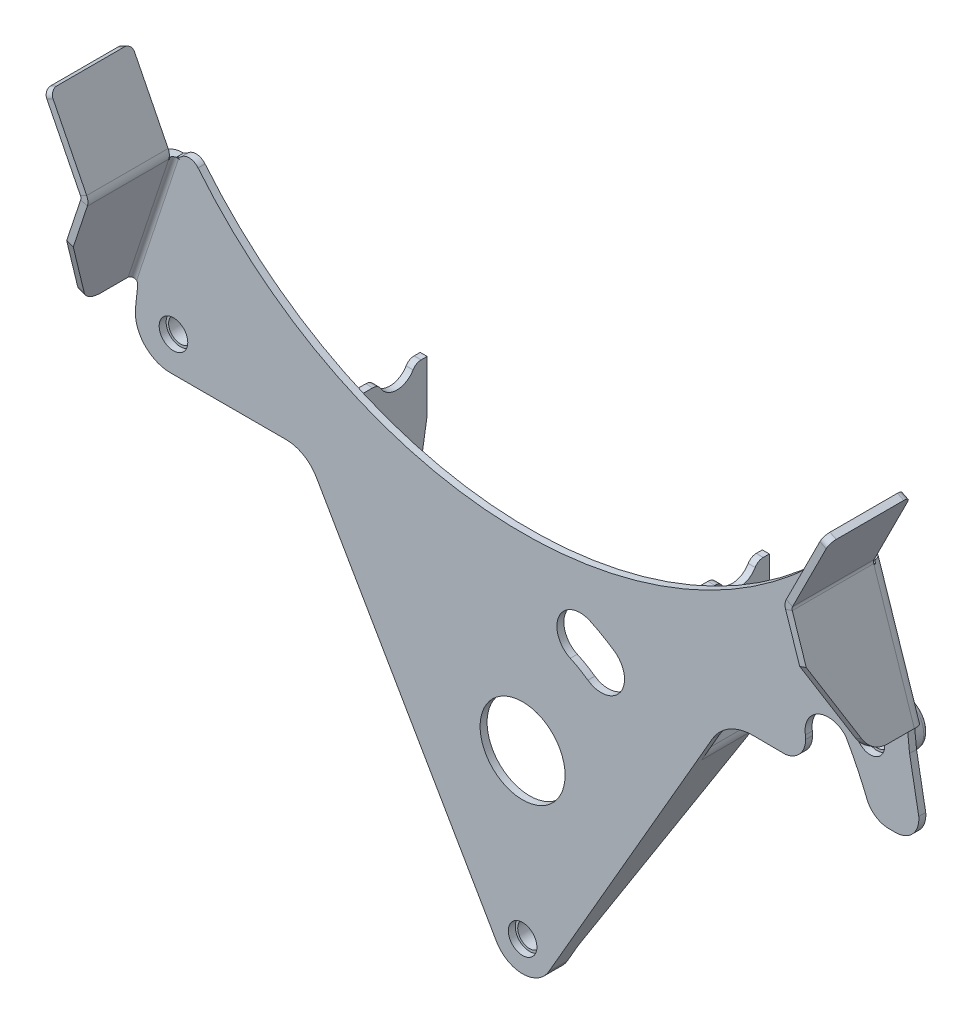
ISO-10303-21;
HEADER;
FILE_DESCRIPTION(('STEP AP214'),'2;1');
FILE_NAME('part.step','',(''),(''),'','','');
FILE_SCHEMA(('AUTOMOTIVE_DESIGN { 1 0 10303 214 1 1 1 1 }'));
ENDSEC;
DATA;
#1=APPLICATION_CONTEXT('core data for automotive mechanical design processes');
#2=APPLICATION_PROTOCOL_DEFINITION('international standard','automotive_design',2000,#1);
#3=PRODUCT_CONTEXT('',#1,'mechanical');
#4=PRODUCT('Part','Part','',(#3));
#5=PRODUCT_RELATED_PRODUCT_CATEGORY('part','',(#4));
#6=PRODUCT_DEFINITION_FORMATION('','',#4);
#7=PRODUCT_DEFINITION_CONTEXT('part definition',#1,'design');
#8=PRODUCT_DEFINITION('design','',#6,#7);
#9=PRODUCT_DEFINITION_SHAPE('','',#8);
#10=(LENGTH_UNIT() NAMED_UNIT(*) SI_UNIT(.MILLI.,.METRE.));
#11=(NAMED_UNIT(*) PLANE_ANGLE_UNIT() SI_UNIT($,.RADIAN.));
#12=(NAMED_UNIT(*) SI_UNIT($,.STERADIAN.) SOLID_ANGLE_UNIT());
#13=UNCERTAINTY_MEASURE_WITH_UNIT(LENGTH_MEASURE(1.E-05),#10,'distance_accuracy_value','');
#14=(GEOMETRIC_REPRESENTATION_CONTEXT(3) GLOBAL_UNCERTAINTY_ASSIGNED_CONTEXT((#13)) GLOBAL_UNIT_ASSIGNED_CONTEXT((#10,
#11,#12)) REPRESENTATION_CONTEXT('',''));
#15=CARTESIAN_POINT('',(0.,0.,0.));
#16=DIRECTION('',(0.,0.,1.));
#17=DIRECTION('',(1.,0.,0.));
#18=AXIS2_PLACEMENT_3D('',#15,#16,#17);
#19=CARTESIAN_POINT('',(-8.88178419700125E-13,-70.,0.));
#20=DIRECTION('',(0.,0.,1.));
#21=DIRECTION('',(1.,0.,0.));
#22=AXIS2_PLACEMENT_3D('',#19,#20,#21);
#23=PLANE('',#22);
#24=CARTESIAN_POINT('',(-8.88178419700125E-13,-70.,0.));
#25=DIRECTION('',(0.,0.,-1.));
#26=DIRECTION('',(-1.,0.,0.));
#27=AXIS2_PLACEMENT_3D('',#24,#25,#26);
#28=CIRCLE('',#27,10.);
#29=CARTESIAN_POINT('',(-8.66025403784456,-75.0000000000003,0.));
#30=VERTEX_POINT('',#29);
#31=CARTESIAN_POINT('',(8.66025403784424,-75.0000000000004,0.));
#32=VERTEX_POINT('',#31);
#33=EDGE_CURVE('E3052',#30,#32,#28,.T.);
#34=ORIENTED_EDGE('',*,*,#33,.F.);
#35=DIRECTION('',(0.5,-0.866025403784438,0.));
#36=VECTOR('',#35,1.);
#37=CARTESIAN_POINT('',(-71.3301270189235,33.5474041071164,0.));
#38=LINE('',#37,#36);
#39=CARTESIAN_POINT('',(-71.3301270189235,33.5474041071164,0.));
#40=VERTEX_POINT('',#39);
#41=EDGE_CURVE('E646',#40,#30,#38,.T.);
#42=ORIENTED_EDGE('',*,*,#41,.F.);
#43=CARTESIAN_POINT('',(-67.0000000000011,36.0474041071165,0.));
#44=DIRECTION('',(0.,0.,1.));
#45=DIRECTION('',(-1.,0.,0.));
#46=AXIS2_PLACEMENT_3D('',#43,#44,#45);
#47=CIRCLE('',#46,5.0000000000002);
#48=CARTESIAN_POINT('',(-72.0000000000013,36.0474041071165,0.));
#49=VERTEX_POINT('',#48);
#50=EDGE_CURVE('E684',#49,#40,#47,.T.);
#51=ORIENTED_EDGE('',*,*,#50,.F.);
#52=DIRECTION('',(0.,-1.,0.));
#53=VECTOR('',#52,1.);
#54=CARTESIAN_POINT('',(-72.0000000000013,95.2637939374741,0.));
#55=LINE('',#54,#53);
#56=CARTESIAN_POINT('',(-72.0000000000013,95.2637939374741,0.));
#57=VERTEX_POINT('',#56);
#58=EDGE_CURVE('E681',#57,#49,#55,.T.);
#59=ORIENTED_EDGE('',*,*,#58,.F.);
#60=DIRECTION('',(1.,0.,0.));
#61=VECTOR('',#60,1.);
#62=CARTESIAN_POINT('',(-75.0000000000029,95.2637939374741,0.));
#63=LINE('',#62,#61);
#64=CARTESIAN_POINT('',(-75.0000000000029,95.2637939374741,0.));
#65=VERTEX_POINT('',#64);
#66=EDGE_CURVE('E678',#65,#57,#63,.T.);
#67=ORIENTED_EDGE('',*,*,#66,.F.);
#68=DIRECTION('',(0.,1.,0.));
#69=VECTOR('',#68,1.);
#70=CARTESIAN_POINT('',(-75.0000000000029,95.2637939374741,0.));
#71=LINE('',#70,#69);
#72=CARTESIAN_POINT('',(-75.0000000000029,36.0474041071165,0.));
#73=VERTEX_POINT('',#72);
#74=EDGE_CURVE('E709',#73,#65,#71,.T.);
#75=ORIENTED_EDGE('',*,*,#74,.F.);
#76=CARTESIAN_POINT('',(-67.0000000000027,36.0474041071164,0.));
#77=DIRECTION('',(0.,0.,-1.));
#78=DIRECTION('',(-1.,0.,0.));
#79=AXIS2_PLACEMENT_3D('',#76,#77,#78);
#80=CIRCLE('',#79,8.00000000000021);
#81=CARTESIAN_POINT('',(-73.9282032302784,32.0474041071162,0.));
#82=VERTEX_POINT('',#81);
#83=EDGE_CURVE('E706',#82,#73,#80,.T.);
#84=ORIENTED_EDGE('',*,*,#83,.F.);
#85=DIRECTION('',(0.500000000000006,-0.866025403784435,0.));
#86=VECTOR('',#85,1.);
#87=CARTESIAN_POINT('',(-88.6232663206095,57.4999999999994,0.));
#88=LINE('',#87,#86);
#89=CARTESIAN_POINT('',(-88.6232663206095,57.4999999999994,0.));
#90=VERTEX_POINT('',#89);
#91=EDGE_CURVE('E1382',#90,#82,#88,.T.);
#92=ORIENTED_EDGE('',*,*,#91,.F.);
#93=CARTESIAN_POINT('',(-101.613647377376,49.9999999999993,0.));
#94=DIRECTION('',(0.,0.,-1.));
#95=DIRECTION('',(1.,0.,0.));
#96=AXIS2_PLACEMENT_3D('',#93,#94,#95);
#97=CIRCLE('',#96,15.);
#98=CARTESIAN_POINT('',(-101.613647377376,64.9999999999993,0.));
#99=VERTEX_POINT('',#98);
#100=EDGE_CURVE('E1377',#99,#90,#97,.T.);
#101=ORIENTED_EDGE('',*,*,#100,.F.);
#102=DIRECTION('',(1.,0.,0.));
#103=VECTOR('',#102,1.);
#104=CARTESIAN_POINT('',(-151.400000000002,64.9999999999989,0.));
#105=LINE('',#104,#103);
#106=CARTESIAN_POINT('',(-151.400000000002,64.9999999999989,0.));
#107=VERTEX_POINT('',#106);
#108=EDGE_CURVE('E1372',#107,#99,#105,.T.);
#109=ORIENTED_EDGE('',*,*,#108,.F.);
#110=CARTESIAN_POINT('',(-151.400000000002,79.999999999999,0.));
#111=DIRECTION('',(0.,0.,1.));
#112=DIRECTION('',(1.,0.,0.));
#113=AXIS2_PLACEMENT_3D('',#110,#111,#112);
#114=CIRCLE('',#113,15.);
#115=CARTESIAN_POINT('',(-166.317828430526,81.5679269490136,0.));
#116=VERTEX_POINT('',#115);
#117=EDGE_CURVE('E1367',#116,#107,#114,.T.);
#118=ORIENTED_EDGE('',*,*,#117,.F.);
#119=DIRECTION('',(-0.104528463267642,-0.994521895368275,0.));
#120=VECTOR('',#119,1.);
#121=CARTESIAN_POINT('',(-165.39502259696,90.3478379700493,0.));
#122=LINE('',#121,#120);
#123=CARTESIAN_POINT('',(-165.39502259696,90.3478379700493,0.));
#124=VERTEX_POINT('',#123);
#125=EDGE_CURVE('E1362',#124,#116,#122,.T.);
#126=ORIENTED_EDGE('',*,*,#125,.F.);
#127=CARTESIAN_POINT('',(-168.378588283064,90.6614233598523,0.));
#128=DIRECTION('',(0.,0.,-1.));
#129=DIRECTION('',(1.,0.,0.));
#130=AXIS2_PLACEMENT_3D('',#127,#128,#129);
#131=CIRCLE('',#130,2.99999999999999);
#132=CARTESIAN_POINT('',(-165.788433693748,92.1750610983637,0.));
#133=VERTEX_POINT('',#132);
#134=EDGE_CURVE('E1317',#133,#124,#131,.T.);
#135=ORIENTED_EDGE('',*,*,#134,.F.);
#136=DIRECTION('',(-0.314504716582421,-0.949255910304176,0.));
#137=VECTOR('',#136,1.);
#138=CARTESIAN_POINT('',(-147.853515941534,146.307243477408,0.));
#139=LINE('',#138,#137);
#140=CARTESIAN_POINT('',(-147.853515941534,146.307243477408,0.));
#141=VERTEX_POINT('',#140);
#142=EDGE_CURVE('E1417',#141,#133,#139,.T.);
#143=ORIENTED_EDGE('',*,*,#142,.F.);
#144=DIRECTION('',(0.949255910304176,-0.314504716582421,0.));
#145=VECTOR('',#144,1.);
#146=CARTESIAN_POINT('',(-152.599795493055,147.87976706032,0.));
#147=LINE('',#146,#145);
#148=CARTESIAN_POINT('',(-147.568739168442,146.212892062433,0.));
#149=VERTEX_POINT('',#148);
#150=EDGE_CURVE('E1311',#141,#149,#147,.T.);
#151=ORIENTED_EDGE('',*,*,#150,.T.);
#152=CARTESIAN_POINT('',(-147.521563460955,146.355280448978,0.));
#153=DIRECTION('',(0.,0.,1.));
#154=DIRECTION('',(1.,0.,0.));
#155=AXIS2_PLACEMENT_3D('',#152,#153,#154);
#156=CIRCLE('',#155,0.15);
#157=CARTESIAN_POINT('',(-147.474387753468,146.497668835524,0.));
#158=VERTEX_POINT('',#157);
#159=EDGE_CURVE('E1308',#149,#158,#156,.T.);
#160=ORIENTED_EDGE('',*,*,#159,.T.);
#161=DIRECTION('',(0.949255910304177,-0.314504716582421,0.));
#162=VECTOR('',#161,1.);
#163=CARTESIAN_POINT('',(50.0472302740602,81.0553789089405,0.));
#164=LINE('',#163,#162);
#165=CARTESIAN_POINT('',(-148.432712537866,146.815178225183,0.));
#166=VERTEX_POINT('',#165);
#167=EDGE_CURVE('E1406',#166,#158,#164,.T.);
#168=ORIENTED_EDGE('',*,*,#167,.F.);
#169=CARTESIAN_POINT('',(-148.824976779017,149.789422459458,0.));
#170=DIRECTION('',(0.,0.,-1.));
#171=DIRECTION('',(-1.,0.,0.));
#172=AXIS2_PLACEMENT_3D('',#169,#170,#171);
#173=CIRCLE('',#172,3.00000000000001);
#174=CARTESIAN_POINT('',(-146.754562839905,147.618389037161,0.));
#175=VERTEX_POINT('',#174);
#176=EDGE_CURVE('E1401',#175,#166,#173,.T.);
#177=ORIENTED_EDGE('',*,*,#176,.F.);
#178=CARTESIAN_POINT('',(-143.303872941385,143.999999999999,0.));
#179=DIRECTION('',(0.,0.,1.));
#180=DIRECTION('',(1.,0.,0.));
#181=AXIS2_PLACEMENT_3D('',#178,#179,#180);
#182=CIRCLE('',#181,4.99999999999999);
#183=CARTESIAN_POINT('',(-139.430795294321,147.162162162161,0.));
#184=VERTEX_POINT('',#183);
#185=EDGE_CURVE('E1396',#184,#175,#182,.T.);
#186=ORIENTED_EDGE('',*,*,#185,.F.);
#187=CARTESIAN_POINT('',(-3.2612801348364E-12,261.,0.));
#188=DIRECTION('',(0.,0.,-1.));
#189=DIRECTION('',(1.,0.,0.));
#190=AXIS2_PLACEMENT_3D('',#187,#188,#189);
#191=CIRCLE('',#190,180.);
#192=CARTESIAN_POINT('',(139.430795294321,147.162162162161,0.));
#193=VERTEX_POINT('',#192);
#194=EDGE_CURVE('E1394',#193,#184,#191,.T.);
#195=ORIENTED_EDGE('',*,*,#194,.F.);
#196=CARTESIAN_POINT('',(143.303872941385,143.999999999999,0.));
#197=DIRECTION('',(0.,0.,-1.));
#198=DIRECTION('',(-1.,0.,0.));
#199=AXIS2_PLACEMENT_3D('',#196,#197,#198);
#200=CIRCLE('',#199,4.99999999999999);
#201=CARTESIAN_POINT('',(146.754562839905,147.618389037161,0.));
#202=VERTEX_POINT('',#201);
#203=EDGE_CURVE('E1058',#193,#202,#200,.T.);
#204=ORIENTED_EDGE('',*,*,#203,.T.);
#205=CARTESIAN_POINT('',(148.824976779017,149.789422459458,0.));
#206=DIRECTION('',(0.,0.,1.));
#207=DIRECTION('',(1.,0.,0.));
#208=AXIS2_PLACEMENT_3D('',#205,#206,#207);
#209=CIRCLE('',#208,3.00000000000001);
#210=CARTESIAN_POINT('',(148.432712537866,146.815178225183,0.));
#211=VERTEX_POINT('',#210);
#212=EDGE_CURVE('E1063',#202,#211,#209,.T.);
#213=ORIENTED_EDGE('',*,*,#212,.T.);
#214=DIRECTION('',(-0.949255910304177,-0.314504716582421,0.));
#215=VECTOR('',#214,1.);
#216=CARTESIAN_POINT('',(-50.0472302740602,81.0553789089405,0.));
#217=LINE('',#216,#215);
#218=CARTESIAN_POINT('',(147.474387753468,146.497668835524,0.));
#219=VERTEX_POINT('',#218);
#220=EDGE_CURVE('E1068',#211,#219,#217,.T.);
#221=ORIENTED_EDGE('',*,*,#220,.T.);
#222=CARTESIAN_POINT('',(147.521563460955,146.355280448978,0.));
#223=DIRECTION('',(0.,0.,-1.));
#224=DIRECTION('',(-1.,0.,0.));
#225=AXIS2_PLACEMENT_3D('',#222,#223,#224);
#226=CIRCLE('',#225,0.15);
#227=CARTESIAN_POINT('',(147.568739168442,146.212892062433,0.));
#228=VERTEX_POINT('',#227);
#229=EDGE_CURVE('E1015',#228,#219,#226,.T.);
#230=ORIENTED_EDGE('',*,*,#229,.F.);
#231=DIRECTION('',(-0.949255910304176,-0.314504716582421,0.));
#232=VECTOR('',#231,1.);
#233=CARTESIAN_POINT('',(152.599795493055,147.87976706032,0.));
#234=LINE('',#233,#232);
#235=CARTESIAN_POINT('',(147.853515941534,146.307243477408,0.));
#236=VERTEX_POINT('',#235);
#237=EDGE_CURVE('E1018',#236,#228,#234,.T.);
#238=ORIENTED_EDGE('',*,*,#237,.F.);
#239=DIRECTION('',(0.314504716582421,-0.949255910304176,0.));
#240=VECTOR('',#239,1.);
#241=CARTESIAN_POINT('',(147.853515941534,146.307243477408,0.));
#242=LINE('',#241,#240);
#243=CARTESIAN_POINT('',(165.788433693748,92.1750610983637,0.));
#244=VERTEX_POINT('',#243);
#245=EDGE_CURVE('E1079',#236,#244,#242,.T.);
#246=ORIENTED_EDGE('',*,*,#245,.T.);
#247=CARTESIAN_POINT('',(168.378588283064,90.6614233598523,0.));
#248=DIRECTION('',(0.,0.,1.));
#249=DIRECTION('',(-1.,0.,0.));
#250=AXIS2_PLACEMENT_3D('',#247,#248,#249);
#251=CIRCLE('',#250,2.99999999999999);
#252=CARTESIAN_POINT('',(165.39502259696,90.3478379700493,0.));
#253=VERTEX_POINT('',#252);
#254=EDGE_CURVE('E1020',#244,#253,#251,.T.);
#255=ORIENTED_EDGE('',*,*,#254,.T.);
#256=DIRECTION('',(0.104528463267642,-0.994521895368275,0.));
#257=VECTOR('',#256,1.);
#258=CARTESIAN_POINT('',(165.39502259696,90.3478379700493,0.));
#259=LINE('',#258,#257);
#260=CARTESIAN_POINT('',(166.257436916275,82.1425138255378,0.));
#261=VERTEX_POINT('',#260);
#262=EDGE_CURVE('E1046',#253,#261,#259,.T.);
#263=ORIENTED_EDGE('',*,*,#262,.T.);
#264=DIRECTION('',(0.180716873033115,-0.983535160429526,0.));
#265=VECTOR('',#264,1.);
#266=CARTESIAN_POINT('',(166.153027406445,82.7107530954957,0.));
#267=LINE('',#266,#265);
#268=CARTESIAN_POINT('',(170.199172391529,60.6899766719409,0.));
#269=VERTEX_POINT('',#268);
#270=EDGE_CURVE('E828',#261,#269,#267,.T.);
#271=ORIENTED_EDGE('',*,*,#270,.T.);
#272=CARTESIAN_POINT('',(160.247210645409,59.7109682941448,0.));
#273=DIRECTION('',(0.,0.,1.));
#274=DIRECTION('',(1.,0.,0.));
#275=AXIS2_PLACEMENT_3D('',#272,#273,#274);
#276=CIRCLE('',#275,10.000000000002);
#277=CARTESIAN_POINT('',(160.180592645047,49.7111901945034,0.));
#278=VERTEX_POINT('',#277);
#279=EDGE_CURVE('E826',#269,#278,#276,.F.);
#280=ORIENTED_EDGE('',*,*,#279,.T.);
#281=DIRECTION('',(-0.999977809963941,0.00666180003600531,0.));
#282=VECTOR('',#281,1.);
#283=CARTESIAN_POINT('',(157.180659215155,49.7311755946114,0.));
#284=LINE('',#283,#282);
#285=CARTESIAN_POINT('',(157.180659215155,49.7311755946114,0.));
#286=VERTEX_POINT('',#285);
#287=EDGE_CURVE('E824',#278,#286,#284,.T.);
#288=ORIENTED_EDGE('',*,*,#287,.T.);
#289=CARTESIAN_POINT('',(157.247277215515,59.7309536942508,0.));
#290=DIRECTION('',(0.,0.,1.));
#291=DIRECTION('',(1.,0.,0.));
#292=AXIS2_PLACEMENT_3D('',#289,#290,#291);
#293=CIRCLE('',#292,9.99999999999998);
#294=CARTESIAN_POINT('',(147.981847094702,55.9690652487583,0.));
#295=VERTEX_POINT('',#294);
#296=EDGE_CURVE('E822',#286,#295,#293,.F.);
#297=ORIENTED_EDGE('',*,*,#296,.T.);
#298=CARTESIAN_POINT('',(-0.265034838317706,-4.22114987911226,0.));
#299=DIRECTION('',(0.,0.,1.));
#300=DIRECTION('',(1.,0.,0.));
#301=AXIS2_PLACEMENT_3D('',#298,#299,#300);
#302=CIRCLE('',#301,160.000000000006);
#303=CARTESIAN_POINT('',(143.986247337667,64.9999999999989,0.));
#304=VERTEX_POINT('',#303);
#305=EDGE_CURVE('E818',#295,#304,#302,.T.);
#306=ORIENTED_EDGE('',*,*,#305,.T.);
#307=CARTESIAN_POINT('',(-0.265034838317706,-4.22114987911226,0.));
#308=DIRECTION('',(0.,0.,-1.));
#309=DIRECTION('',(-1.,0.,0.));
#310=AXIS2_PLACEMENT_3D('',#307,#308,#309);
#311=CIRCLE('',#310,160.000000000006);
#312=CARTESIAN_POINT('',(138.828899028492,74.8539888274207,0.));
#313=VERTEX_POINT('',#312);
#314=EDGE_CURVE('E767',#313,#304,#311,.T.);
#315=ORIENTED_EDGE('',*,*,#314,.F.);
#316=CARTESIAN_POINT('',(131.358569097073,68.2061191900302,0.));
#317=DIRECTION('',(0.,0.,1.));
#318=DIRECTION('',(1.,0.,0.));
#319=AXIS2_PLACEMENT_3D('',#316,#317,#318);
#320=CIRCLE('',#319,10.);
#321=CARTESIAN_POINT('',(121.483183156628,66.6323490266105,0.));
#322=VERTEX_POINT('',#321);
#323=EDGE_CURVE('E769',#313,#322,#320,.T.);
#324=ORIENTED_EDGE('',*,*,#323,.T.);
#325=CARTESIAN_POINT('',(111.607797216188,65.0585788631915,0.));
#326=DIRECTION('',(0.,0.,1.));
#327=DIRECTION('',(1.,0.,0.));
#328=AXIS2_PLACEMENT_3D('',#325,#326,#327);
#329=CIRCLE('',#328,9.99999999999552);
#330=CARTESIAN_POINT('',(121.607625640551,64.9999999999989,0.));
#331=VERTEX_POINT('',#330);
#332=EDGE_CURVE('E770',#331,#322,#329,.T.);
#333=ORIENTED_EDGE('',*,*,#332,.F.);
#334=CARTESIAN_POINT('',(111.607797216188,65.0585788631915,0.));
#335=DIRECTION('',(0.,0.,1.));
#336=DIRECTION('',(1.,0.,0.));
#337=AXIS2_PLACEMENT_3D('',#334,#335,#336);
#338=CIRCLE('',#337,9.99999999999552);
#339=CARTESIAN_POINT('',(112.847636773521,55.1357366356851,0.));
#340=VERTEX_POINT('',#339);
#341=EDGE_CURVE('E816',#331,#340,#338,.F.);
#342=ORIENTED_EDGE('',*,*,#341,.T.);
#343=DIRECTION('',(-0.999977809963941,0.00666180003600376,0.));
#344=VECTOR('',#343,1.);
#345=CARTESIAN_POINT('',(98.9915377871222,55.228045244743,0.));
#346=LINE('',#345,#344);
#347=CARTESIAN_POINT('',(98.9915377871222,55.228045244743,0.));
#348=VERTEX_POINT('',#347);
#349=EDGE_CURVE('E832',#340,#348,#346,.T.);
#350=ORIENTED_EDGE('',*,*,#349,.T.);
#351=CARTESIAN_POINT('',(98.8583017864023,35.2284890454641,0.));
#352=DIRECTION('',(0.,0.,1.));
#353=DIRECTION('',(1.,0.,0.));
#354=AXIS2_PLACEMENT_3D('',#351,#352,#353);
#355=CIRCLE('',#354,20.0000000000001);
#356=CARTESIAN_POINT('',(81.6047960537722,45.3436529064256,0.));
#357=VERTEX_POINT('',#356);
#358=EDGE_CURVE('E830',#348,#357,#355,.T.);
#359=ORIENTED_EDGE('',*,*,#358,.T.);
#360=DIRECTION('',(-0.500000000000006,-0.866025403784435,0.));
#361=VECTOR('',#360,1.);
#362=CARTESIAN_POINT('',(88.6232663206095,57.4999999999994,0.));
#363=LINE('',#362,#361);
#364=CARTESIAN_POINT('',(73.9282032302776,32.0474041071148,0.));
#365=VERTEX_POINT('',#364);
#366=EDGE_CURVE('E1052',#357,#365,#363,.T.);
#367=ORIENTED_EDGE('',*,*,#366,.T.);
#368=CARTESIAN_POINT('',(66.9999999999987,36.0474041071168,0.));
#369=DIRECTION('',(0.,0.,-1.));
#370=DIRECTION('',(-1.,0.,0.));
#371=AXIS2_PLACEMENT_3D('',#368,#369,#370);
#372=CIRCLE('',#371,8.00000000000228);
#373=CARTESIAN_POINT('',(75.000000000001,36.0474041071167,0.));
#374=VERTEX_POINT('',#373);
#375=EDGE_CURVE('E703',#374,#365,#372,.T.);
#376=ORIENTED_EDGE('',*,*,#375,.F.);
#377=DIRECTION('',(0.,-1.,0.));
#378=VECTOR('',#377,1.);
#379=CARTESIAN_POINT('',(75.000000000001,95.2637939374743,0.));
#380=LINE('',#379,#378);
#381=CARTESIAN_POINT('',(75.000000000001,95.2637939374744,0.));
#382=VERTEX_POINT('',#381);
#383=EDGE_CURVE('E700',#382,#374,#380,.T.);
#384=ORIENTED_EDGE('',*,*,#383,.F.);
#385=DIRECTION('',(1.,0.,0.));
#386=VECTOR('',#385,1.);
#387=CARTESIAN_POINT('',(72.0000000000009,95.2637939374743,0.));
#388=LINE('',#387,#386);
#389=CARTESIAN_POINT('',(72.0000000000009,95.2637939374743,0.));
#390=VERTEX_POINT('',#389);
#391=EDGE_CURVE('E697',#390,#382,#388,.T.);
#392=ORIENTED_EDGE('',*,*,#391,.F.);
#393=DIRECTION('',(0.,1.,0.));
#394=VECTOR('',#393,1.);
#395=CARTESIAN_POINT('',(72.0000000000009,95.2637939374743,0.));
#396=LINE('',#395,#394);
#397=CARTESIAN_POINT('',(72.0000000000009,36.0474041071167,0.));
#398=VERTEX_POINT('',#397);
#399=EDGE_CURVE('E694',#398,#390,#396,.T.);
#400=ORIENTED_EDGE('',*,*,#399,.F.);
#401=CARTESIAN_POINT('',(66.9999999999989,36.0474041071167,0.));
#402=DIRECTION('',(0.,0.,1.));
#403=DIRECTION('',(-1.,0.,0.));
#404=AXIS2_PLACEMENT_3D('',#401,#402,#403);
#405=CIRCLE('',#404,5.00000000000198);
#406=CARTESIAN_POINT('',(71.3301270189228,33.5474041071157,0.));
#407=VERTEX_POINT('',#406);
#408=EDGE_CURVE('E691',#407,#398,#405,.T.);
#409=ORIENTED_EDGE('',*,*,#408,.F.);
#410=DIRECTION('',(0.5,0.866025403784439,0.));
#411=VECTOR('',#410,1.);
#412=CARTESIAN_POINT('',(71.3301270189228,33.5474041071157,0.));
#413=LINE('',#412,#411);
#414=EDGE_CURVE('E688',#32,#407,#413,.T.);
#415=ORIENTED_EDGE('',*,*,#414,.F.);
#416=EDGE_LOOP('',(#34,#42,#51,#59,#67,#75,#84,#92,#101,#109,#118,#126,#135,#143,#151,#160,#168,
#177,#186,#195,#204,#213,#221,#230,#238,#246,#255,#263,#271,#280,#288,#297,#306,#315,#324,#333,
#342,#350,#359,#367,#376,#384,#392,#400,#409,#415));
#417=FACE_BOUND('',#416,.T.);
#418=CARTESIAN_POINT('',(0.,0.,0.));
#419=DIRECTION('',(0.,0.,-1.));
#420=DIRECTION('',(1.,0.,0.));
#421=AXIS2_PLACEMENT_3D('',#418,#419,#420);
#422=CIRCLE('',#421,18.25);
#423=CARTESIAN_POINT('',(18.25,0.,0.));
#424=VERTEX_POINT('',#423);
#425=EDGE_CURVE('E1391',#424,#424,#422,.T.);
#426=ORIENTED_EDGE('',*,*,#425,.F.);
#427=EDGE_LOOP('',(#426));
#428=FACE_BOUND('',#427,.T.);
#429=CARTESIAN_POINT('',(-0.623693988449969,-0.629049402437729,0.));
#430=DIRECTION('',(0.,0.,1.));
#431=DIRECTION('',(1.,0.,0.));
#432=AXIS2_PLACEMENT_3D('',#429,#430,#431);
#433=CIRCLE('',#432,69.9999999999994);
#434=CARTESIAN_POINT('',(28.9595843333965,62.8124956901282,0.));
#435=VERTEX_POINT('',#434);
#436=CARTESIAN_POINT('',(39.526656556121,56.7115936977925,0.));
#437=VERTEX_POINT('',#436);
#438=EDGE_CURVE('E788',#435,#437,#433,.F.);
#439=ORIENTED_EDGE('',*,*,#438,.F.);
#440=CARTESIAN_POINT('',(24.7334017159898,53.7494178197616,0.));
#441=DIRECTION('',(0.,0.,1.));
#442=DIRECTION('',(1.,0.,0.));
#443=AXIS2_PLACEMENT_3D('',#440,#441,#442);
#444=CIRCLE('',#443,9.99999999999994);
#445=CARTESIAN_POINT('',(20.5072190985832,44.686339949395,0.));
#446=VERTEX_POINT('',#445);
#447=EDGE_CURVE('E786',#446,#435,#444,.F.);
#448=ORIENTED_EDGE('',*,*,#447,.F.);
#449=CARTESIAN_POINT('',(-0.623693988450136,-0.629049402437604,0.));
#450=DIRECTION('',(0.,0.,1.));
#451=DIRECTION('',(1.,0.,0.));
#452=AXIS2_PLACEMENT_3D('',#449,#450,#451);
#453=CIRCLE('',#452,49.9999999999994);
#454=CARTESIAN_POINT('',(28.0551278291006,40.3285528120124,0.));
#455=VERTEX_POINT('',#454);
#456=EDGE_CURVE('E783',#455,#446,#453,.T.);
#457=ORIENTED_EDGE('',*,*,#456,.F.);
#458=CARTESIAN_POINT('',(33.7908921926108,48.5200732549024,0.));
#459=DIRECTION('',(0.,0.,1.));
#460=DIRECTION('',(1.,0.,0.));
#461=AXIS2_PLACEMENT_3D('',#458,#459,#460);
#462=CIRCLE('',#461,9.99999999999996);
#463=EDGE_CURVE('E790',#437,#455,#462,.F.);
#464=ORIENTED_EDGE('',*,*,#463,.F.);
#465=EDGE_LOOP('',(#439,#448,#457,#464));
#466=FACE_BOUND('',#465,.T.);
#467=CARTESIAN_POINT('',(149.376306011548,79.3709505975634,0.));
#468=DIRECTION('',(0.,0.,1.));
#469=DIRECTION('',(1.,0.,0.));
#470=AXIS2_PLACEMENT_3D('',#467,#468,#469);
#471=CIRCLE('',#470,10.);
#472=CARTESIAN_POINT('',(159.376306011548,79.3709505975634,0.));
#473=VERTEX_POINT('',#472);
#474=EDGE_CURVE('E1525',#473,#473,#471,.F.);
#475=ORIENTED_EDGE('',*,*,#474,.F.);
#476=EDGE_LOOP('',(#475));
#477=FACE_BOUND('',#476,.T.);
#478=CARTESIAN_POINT('',(-150.000000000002,79.9999999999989,0.));
#479=DIRECTION('',(0.,0.,1.));
#480=DIRECTION('',(1.,0.,0.));
#481=AXIS2_PLACEMENT_3D('',#478,#479,#480);
#482=CIRCLE('',#481,10.);
#483=CARTESIAN_POINT('',(-140.000000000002,79.9999999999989,0.));
#484=VERTEX_POINT('',#483);
#485=EDGE_CURVE('E1528',#484,#484,#482,.F.);
#486=ORIENTED_EDGE('',*,*,#485,.F.);
#487=EDGE_LOOP('',(#486));
#488=FACE_BOUND('',#487,.T.);
#489=ADVANCED_FACE('F56',(#417,#428,#466,#477,#488),#23,.F.);
#490=CARTESIAN_POINT('',(-75.0000000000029,95.2637939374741,-28.));
#491=DIRECTION('',(0.,-1.,0.));
#492=DIRECTION('',(0.,0.,-1.));
#493=AXIS2_PLACEMENT_3D('',#490,#491,#492);
#494=PLANE('',#493);
#495=DIRECTION('',(1.,0.,0.));
#496=VECTOR('',#495,1.);
#497=CARTESIAN_POINT('',(-80.,95.2637939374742,-25.3923048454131));
#498=LINE('',#497,#496);
#499=CARTESIAN_POINT('',(-75.0000000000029,95.2637939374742,-25.3923048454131));
#500=VERTEX_POINT('',#499);
#501=CARTESIAN_POINT('',(-72.0000000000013,95.2637939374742,-25.3923048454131));
#502=VERTEX_POINT('',#501);
#503=EDGE_CURVE('E2864',#500,#502,#498,.T.);
#504=ORIENTED_EDGE('',*,*,#503,.T.);
#505=DIRECTION('',(0.,0.,1.));
#506=VECTOR('',#505,1.);
#507=CARTESIAN_POINT('',(-72.0000000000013,95.2637939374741,-28.));
#508=LINE('',#507,#506);
#509=CARTESIAN_POINT('',(-72.0000000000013,95.2637939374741,-28.));
#510=VERTEX_POINT('',#509);
#511=EDGE_CURVE('E756',#510,#502,#508,.T.);
#512=ORIENTED_EDGE('',*,*,#511,.F.);
#513=DIRECTION('',(1.,0.,0.));
#514=VECTOR('',#513,1.);
#515=CARTESIAN_POINT('',(-75.0000000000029,95.2637939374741,-28.));
#516=LINE('',#515,#514);
#517=CARTESIAN_POINT('',(-75.0000000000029,95.2637939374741,-28.));
#518=VERTEX_POINT('',#517);
#519=EDGE_CURVE('E712',#518,#510,#516,.T.);
#520=ORIENTED_EDGE('',*,*,#519,.F.);
#521=DIRECTION('',(0.,0.,1.));
#522=VECTOR('',#521,1.);
#523=CARTESIAN_POINT('',(-75.0000000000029,95.2637939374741,-28.));
#524=LINE('',#523,#522);
#525=EDGE_CURVE('E728',#518,#500,#524,.T.);
#526=ORIENTED_EDGE('',*,*,#525,.T.);
#527=EDGE_LOOP('',(#504,#512,#520,#526));
#528=FACE_BOUND('',#527,.T.);
#529=ADVANCED_FACE('F1447',(#528),#494,.F.);
#530=CARTESIAN_POINT('',(72.0000000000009,95.2637939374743,-28.));
#531=DIRECTION('',(0.,-1.,0.));
#532=DIRECTION('',(0.,0.,-1.));
#533=AXIS2_PLACEMENT_3D('',#530,#531,#532);
#534=PLANE('',#533);
#535=CARTESIAN_POINT('',(72.0000000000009,95.2637939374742,-25.3923048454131));
#536=VERTEX_POINT('',#535);
#537=CARTESIAN_POINT('',(75.000000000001,95.2637939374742,-25.3923048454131));
#538=VERTEX_POINT('',#537);
#539=EDGE_CURVE('E2865',#536,#538,#498,.T.);
#540=ORIENTED_EDGE('',*,*,#539,.T.);
#541=DIRECTION('',(0.,0.,1.));
#542=VECTOR('',#541,1.);
#543=CARTESIAN_POINT('',(75.000000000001,95.2637939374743,-28.));
#544=LINE('',#543,#542);
#545=CARTESIAN_POINT('',(75.000000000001,95.2637939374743,-28.));
#546=VERTEX_POINT('',#545);
#547=EDGE_CURVE('E740',#546,#538,#544,.T.);
#548=ORIENTED_EDGE('',*,*,#547,.F.);
#549=DIRECTION('',(1.,0.,0.));
#550=VECTOR('',#549,1.);
#551=CARTESIAN_POINT('',(72.0000000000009,95.2637939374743,-28.));
#552=LINE('',#551,#550);
#553=CARTESIAN_POINT('',(72.0000000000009,95.2637939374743,-28.));
#554=VERTEX_POINT('',#553);
#555=EDGE_CURVE('E720',#554,#546,#552,.T.);
#556=ORIENTED_EDGE('',*,*,#555,.F.);
#557=DIRECTION('',(0.,0.,1.));
#558=VECTOR('',#557,1.);
#559=CARTESIAN_POINT('',(72.0000000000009,95.2637939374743,-28.));
#560=LINE('',#559,#558);
#561=EDGE_CURVE('E744',#554,#536,#560,.T.);
#562=ORIENTED_EDGE('',*,*,#561,.T.);
#563=EDGE_LOOP('',(#540,#548,#556,#562));
#564=FACE_BOUND('',#563,.T.);
#565=ADVANCED_FACE('F2229',(#564),#534,.F.);
#566=CARTESIAN_POINT('',(-67.0000000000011,36.0474041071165,-28.));
#567=DIRECTION('',(0.,0.,-1.));
#568=DIRECTION('',(-1.,0.,0.));
#569=AXIS2_PLACEMENT_3D('',#566,#567,#568);
#570=PLANE('',#569);
#571=DIRECTION('',(1.,0.,0.));
#572=VECTOR('',#571,1.);
#573=CARTESIAN_POINT('',(-67.0000000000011,73.2873449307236,-28.));
#574=LINE('',#573,#572);
#575=CARTESIAN_POINT('',(-75.0000000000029,73.287344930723,-27.9999999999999));
#576=VERTEX_POINT('',#575);
#577=CARTESIAN_POINT('',(-72.0000000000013,73.287344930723,-27.9999999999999));
#578=VERTEX_POINT('',#577);
#579=EDGE_CURVE('E1513',#576,#578,#574,.T.);
#580=ORIENTED_EDGE('',*,*,#579,.F.);
#581=DIRECTION('',(0.,1.,0.));
#582=VECTOR('',#581,1.);
#583=CARTESIAN_POINT('',(-75.0000000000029,95.2637939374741,-28.));
#584=LINE('',#583,#582);
#585=EDGE_CURVE('E725',#576,#518,#584,.T.);
#586=ORIENTED_EDGE('',*,*,#585,.T.);
#587=ORIENTED_EDGE('',*,*,#519,.T.);
#588=DIRECTION('',(0.,-1.,0.));
#589=VECTOR('',#588,1.);
#590=CARTESIAN_POINT('',(-72.0000000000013,95.2637939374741,-28.));
#591=LINE('',#590,#589);
#592=EDGE_CURVE('E715',#510,#578,#591,.T.);
#593=ORIENTED_EDGE('',*,*,#592,.T.);
#594=EDGE_LOOP('',(#580,#586,#587,#593));
#595=FACE_BOUND('',#594,.T.);
#596=ADVANCED_FACE('F2221',(#595),#570,.T.);
#597=CARTESIAN_POINT('',(-8.88178419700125E-13,-70.,3.));
#598=DIRECTION('',(0.,0.,1.));
#599=DIRECTION('',(1.,0.,0.));
#600=AXIS2_PLACEMENT_3D('',#597,#598,#599);
#601=PLANE('',#600);
#602=CARTESIAN_POINT('',(149.376306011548,79.3709505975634,3.));
#603=DIRECTION('',(0.,0.,1.));
#604=DIRECTION('',(1.,0.,0.));
#605=AXIS2_PLACEMENT_3D('',#602,#603,#604);
#606=CIRCLE('',#605,6.14999999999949);
#607=CARTESIAN_POINT('',(155.526306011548,79.3709505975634,3.));
#608=VERTEX_POINT('',#607);
#609=EDGE_CURVE('E778',#608,#608,#606,.F.);
#610=ORIENTED_EDGE('',*,*,#609,.T.);
#611=EDGE_LOOP('',(#610));
#612=FACE_BOUND('',#611,.T.);
#613=CARTESIAN_POINT('',(-8.88178419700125E-13,-70.,3.));
#614=DIRECTION('',(0.,0.,-1.));
#615=DIRECTION('',(1.,0.,0.));
#616=AXIS2_PLACEMENT_3D('',#613,#614,#615);
#617=CIRCLE('',#616,6.15000000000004);
#618=CARTESIAN_POINT('',(6.14999999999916,-70.,3.));
#619=VERTEX_POINT('',#618);
#620=EDGE_CURVE('E1332',#619,#619,#617,.T.);
#621=ORIENTED_EDGE('',*,*,#620,.T.);
#622=EDGE_LOOP('',(#621));
#623=FACE_BOUND('',#622,.T.);
#624=CARTESIAN_POINT('',(-150.000000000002,79.9999999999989,3.));
#625=DIRECTION('',(0.,0.,1.));
#626=DIRECTION('',(1.,0.,0.));
#627=AXIS2_PLACEMENT_3D('',#624,#625,#626);
#628=CIRCLE('',#627,6.14999999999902);
#629=CARTESIAN_POINT('',(-143.850000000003,79.9999999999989,3.));
#630=VERTEX_POINT('',#629);
#631=EDGE_CURVE('E1359',#630,#630,#628,.T.);
#632=ORIENTED_EDGE('',*,*,#631,.F.);
#633=EDGE_LOOP('',(#632));
#634=FACE_BOUND('',#633,.T.);
#635=CARTESIAN_POINT('',(0.,0.,3.));
#636=DIRECTION('',(0.,0.,-1.));
#637=DIRECTION('',(1.,0.,0.));
#638=AXIS2_PLACEMENT_3D('',#635,#636,#637);
#639=CIRCLE('',#638,18.25);
#640=CARTESIAN_POINT('',(18.25,0.,3.));
#641=VERTEX_POINT('',#640);
#642=EDGE_CURVE('E1329',#641,#641,#639,.T.);
#643=ORIENTED_EDGE('',*,*,#642,.T.);
#644=EDGE_LOOP('',(#643));
#645=FACE_BOUND('',#644,.T.);
#646=CARTESIAN_POINT('',(24.7334017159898,53.7494178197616,3.));
#647=DIRECTION('',(0.,0.,1.));
#648=DIRECTION('',(1.,0.,0.));
#649=AXIS2_PLACEMENT_3D('',#646,#647,#648);
#650=CIRCLE('',#649,9.99999999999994);
#651=CARTESIAN_POINT('',(20.5072190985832,44.686339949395,3.));
#652=VERTEX_POINT('',#651);
#653=CARTESIAN_POINT('',(28.9595843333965,62.8124956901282,3.));
#654=VERTEX_POINT('',#653);
#655=EDGE_CURVE('E795',#652,#654,#650,.F.);
#656=ORIENTED_EDGE('',*,*,#655,.T.);
#657=CARTESIAN_POINT('',(-0.623693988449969,-0.629049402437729,3.));
#658=DIRECTION('',(0.,0.,1.));
#659=DIRECTION('',(1.,0.,0.));
#660=AXIS2_PLACEMENT_3D('',#657,#658,#659);
#661=CIRCLE('',#660,69.9999999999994);
#662=CARTESIAN_POINT('',(39.526656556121,56.7115936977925,3.));
#663=VERTEX_POINT('',#662);
#664=EDGE_CURVE('E800',#654,#663,#661,.F.);
#665=ORIENTED_EDGE('',*,*,#664,.T.);
#666=CARTESIAN_POINT('',(33.7908921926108,48.5200732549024,3.));
#667=DIRECTION('',(0.,0.,1.));
#668=DIRECTION('',(1.,0.,0.));
#669=AXIS2_PLACEMENT_3D('',#666,#667,#668);
#670=CIRCLE('',#669,9.99999999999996);
#671=CARTESIAN_POINT('',(28.0551278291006,40.3285528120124,3.));
#672=VERTEX_POINT('',#671);
#673=EDGE_CURVE('E796',#663,#672,#670,.F.);
#674=ORIENTED_EDGE('',*,*,#673,.T.);
#675=CARTESIAN_POINT('',(-0.623693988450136,-0.629049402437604,3.));
#676=DIRECTION('',(0.,0.,1.));
#677=DIRECTION('',(1.,0.,0.));
#678=AXIS2_PLACEMENT_3D('',#675,#676,#677);
#679=CIRCLE('',#678,49.9999999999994);
#680=EDGE_CURVE('E792',#672,#652,#679,.T.);
#681=ORIENTED_EDGE('',*,*,#680,.T.);
#682=EDGE_LOOP('',(#656,#665,#674,#681));
#683=FACE_BOUND('',#682,.T.);
#684=CARTESIAN_POINT('',(111.607797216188,65.0585788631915,3.));
#685=DIRECTION('',(0.,0.,1.));
#686=DIRECTION('',(1.,0.,0.));
#687=AXIS2_PLACEMENT_3D('',#684,#685,#686);
#688=CIRCLE('',#687,9.99999999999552);
#689=CARTESIAN_POINT('',(112.847636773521,55.1357366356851,3.));
#690=VERTEX_POINT('',#689);
#691=CARTESIAN_POINT('',(121.607625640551,64.9999999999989,3.));
#692=VERTEX_POINT('',#691);
#693=EDGE_CURVE('E838',#690,#692,#688,.T.);
#694=ORIENTED_EDGE('',*,*,#693,.T.);
#695=CARTESIAN_POINT('',(111.607797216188,65.0585788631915,3.));
#696=DIRECTION('',(0.,0.,1.));
#697=DIRECTION('',(1.,0.,0.));
#698=AXIS2_PLACEMENT_3D('',#695,#696,#697);
#699=CIRCLE('',#698,9.99999999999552);
#700=CARTESIAN_POINT('',(121.483183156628,66.6323490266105,3.));
#701=VERTEX_POINT('',#700);
#702=EDGE_CURVE('E764',#692,#701,#699,.T.);
#703=ORIENTED_EDGE('',*,*,#702,.T.);
#704=CARTESIAN_POINT('',(131.358569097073,68.2061191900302,3.));
#705=DIRECTION('',(0.,0.,1.));
#706=DIRECTION('',(1.,0.,0.));
#707=AXIS2_PLACEMENT_3D('',#704,#705,#706);
#708=CIRCLE('',#707,10.);
#709=CARTESIAN_POINT('',(138.828899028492,74.8539888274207,3.));
#710=VERTEX_POINT('',#709);
#711=EDGE_CURVE('E762',#710,#701,#708,.T.);
#712=ORIENTED_EDGE('',*,*,#711,.F.);
#713=CARTESIAN_POINT('',(-0.265034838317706,-4.22114987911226,3.));
#714=DIRECTION('',(0.,0.,-1.));
#715=DIRECTION('',(1.,0.,0.));
#716=AXIS2_PLACEMENT_3D('',#713,#714,#715);
#717=CIRCLE('',#716,160.000000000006);
#718=CARTESIAN_POINT('',(143.986247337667,64.9999999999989,3.));
#719=VERTEX_POINT('',#718);
#720=EDGE_CURVE('E759',#710,#719,#717,.T.);
#721=ORIENTED_EDGE('',*,*,#720,.T.);
#722=CARTESIAN_POINT('',(-0.265034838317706,-4.22114987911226,3.));
#723=DIRECTION('',(0.,0.,-1.));
#724=DIRECTION('',(1.,0.,0.));
#725=AXIS2_PLACEMENT_3D('',#722,#723,#724);
#726=CIRCLE('',#725,160.000000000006);
#727=CARTESIAN_POINT('',(147.981847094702,55.9690652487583,3.));
#728=VERTEX_POINT('',#727);
#729=EDGE_CURVE('E841',#719,#728,#726,.T.);
#730=ORIENTED_EDGE('',*,*,#729,.T.);
#731=CARTESIAN_POINT('',(157.247277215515,59.7309536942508,3.));
#732=DIRECTION('',(0.,0.,1.));
#733=DIRECTION('',(1.,0.,0.));
#734=AXIS2_PLACEMENT_3D('',#731,#732,#733);
#735=CIRCLE('',#734,9.99999999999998);
#736=CARTESIAN_POINT('',(157.180659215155,49.7311755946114,3.));
#737=VERTEX_POINT('',#736);
#738=EDGE_CURVE('E844',#728,#737,#735,.T.);
#739=ORIENTED_EDGE('',*,*,#738,.T.);
#740=DIRECTION('',(0.999977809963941,-0.00666180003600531,0.));
#741=VECTOR('',#740,1.);
#742=CARTESIAN_POINT('',(157.180659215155,49.7311755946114,3.));
#743=LINE('',#742,#741);
#744=CARTESIAN_POINT('',(160.180592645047,49.7111901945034,3.));
#745=VERTEX_POINT('',#744);
#746=EDGE_CURVE('E847',#737,#745,#743,.T.);
#747=ORIENTED_EDGE('',*,*,#746,.T.);
#748=CARTESIAN_POINT('',(160.247210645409,59.7109682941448,3.));
#749=DIRECTION('',(0.,0.,1.));
#750=DIRECTION('',(1.,0.,0.));
#751=AXIS2_PLACEMENT_3D('',#748,#749,#750);
#752=CIRCLE('',#751,10.000000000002);
#753=CARTESIAN_POINT('',(170.199172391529,60.6899766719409,3.));
#754=VERTEX_POINT('',#753);
#755=EDGE_CURVE('E850',#745,#754,#752,.T.);
#756=ORIENTED_EDGE('',*,*,#755,.T.);
#757=DIRECTION('',(-0.180716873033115,0.983535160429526,0.));
#758=VECTOR('',#757,1.);
#759=CARTESIAN_POINT('',(166.153027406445,82.7107530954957,3.));
#760=LINE('',#759,#758);
#761=CARTESIAN_POINT('',(166.257436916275,82.1425138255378,3.));
#762=VERTEX_POINT('',#761);
#763=EDGE_CURVE('E853',#754,#762,#760,.T.);
#764=ORIENTED_EDGE('',*,*,#763,.T.);
#765=DIRECTION('',(0.104528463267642,-0.994521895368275,0.));
#766=VECTOR('',#765,1.);
#767=CARTESIAN_POINT('',(165.39502259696,90.3478379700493,3.));
#768=LINE('',#767,#766);
#769=CARTESIAN_POINT('',(165.39502259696,90.3478379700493,3.));
#770=VERTEX_POINT('',#769);
#771=EDGE_CURVE('E1032',#770,#762,#768,.T.);
#772=ORIENTED_EDGE('',*,*,#771,.F.);
#773=CARTESIAN_POINT('',(168.378588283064,90.6614233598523,3.));
#774=DIRECTION('',(0.,0.,1.));
#775=DIRECTION('',(-1.,0.,0.));
#776=AXIS2_PLACEMENT_3D('',#773,#774,#775);
#777=CIRCLE('',#776,2.99999999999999);
#778=CARTESIAN_POINT('',(165.788433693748,92.1750610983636,3.00000000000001));
#779=VERTEX_POINT('',#778);
#780=EDGE_CURVE('E1035',#779,#770,#777,.T.);
#781=ORIENTED_EDGE('',*,*,#780,.F.);
#782=DIRECTION('',(0.314504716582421,-0.949255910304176,0.));
#783=VECTOR('',#782,1.);
#784=CARTESIAN_POINT('',(147.853515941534,146.307243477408,3.));
#785=LINE('',#784,#783);
#786=CARTESIAN_POINT('',(147.853515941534,146.307243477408,3.00000000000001));
#787=VERTEX_POINT('',#786);
#788=EDGE_CURVE('E1037',#787,#779,#785,.T.);
#789=ORIENTED_EDGE('',*,*,#788,.F.);
#790=DIRECTION('',(0.949255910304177,0.314504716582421,0.));
#791=VECTOR('',#790,1.);
#792=CARTESIAN_POINT('',(-49.9528788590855,80.7706021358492,3.));
#793=LINE('',#792,#791);
#794=CARTESIAN_POINT('',(147.568739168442,146.212892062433,3.));
#795=VERTEX_POINT('',#794);
#796=EDGE_CURVE('E1041',#795,#787,#793,.T.);
#797=ORIENTED_EDGE('',*,*,#796,.F.);
#798=CARTESIAN_POINT('',(147.521563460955,146.355280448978,3.));
#799=DIRECTION('',(0.,0.,-1.));
#800=DIRECTION('',(-1.,0.,0.));
#801=AXIS2_PLACEMENT_3D('',#798,#799,#800);
#802=CIRCLE('',#801,0.15);
#803=CARTESIAN_POINT('',(147.474387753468,146.497668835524,3.));
#804=VERTEX_POINT('',#803);
#805=EDGE_CURVE('E1076',#795,#804,#802,.T.);
#806=ORIENTED_EDGE('',*,*,#805,.T.);
#807=DIRECTION('',(-0.949255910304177,-0.314504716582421,0.));
#808=VECTOR('',#807,1.);
#809=CARTESIAN_POINT('',(-50.0472302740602,81.0553789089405,3.));
#810=LINE('',#809,#808);
#811=CARTESIAN_POINT('',(148.432712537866,146.815178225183,3.));
#812=VERTEX_POINT('',#811);
#813=EDGE_CURVE('E1024',#812,#804,#810,.T.);
#814=ORIENTED_EDGE('',*,*,#813,.F.);
#815=CARTESIAN_POINT('',(148.824976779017,149.789422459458,3.));
#816=DIRECTION('',(0.,0.,1.));
#817=DIRECTION('',(1.,0.,0.));
#818=AXIS2_PLACEMENT_3D('',#815,#816,#817);
#819=CIRCLE('',#818,3.00000000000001);
#820=CARTESIAN_POINT('',(146.754562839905,147.618389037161,3.));
#821=VERTEX_POINT('',#820);
#822=EDGE_CURVE('E1026',#821,#812,#819,.T.);
#823=ORIENTED_EDGE('',*,*,#822,.F.);
#824=CARTESIAN_POINT('',(143.303872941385,143.999999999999,3.));
#825=DIRECTION('',(0.,0.,-1.));
#826=DIRECTION('',(-1.,0.,0.));
#827=AXIS2_PLACEMENT_3D('',#824,#825,#826);
#828=CIRCLE('',#827,4.99999999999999);
#829=CARTESIAN_POINT('',(139.430795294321,147.162162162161,3.));
#830=VERTEX_POINT('',#829);
#831=EDGE_CURVE('E1028',#830,#821,#828,.T.);
#832=ORIENTED_EDGE('',*,*,#831,.F.);
#833=CARTESIAN_POINT('',(-3.2612801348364E-12,261.,3.));
#834=DIRECTION('',(0.,0.,-1.));
#835=DIRECTION('',(1.,0.,0.));
#836=AXIS2_PLACEMENT_3D('',#833,#834,#835);
#837=CIRCLE('',#836,180.);
#838=CARTESIAN_POINT('',(-139.430795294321,147.162162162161,3.));
#839=VERTEX_POINT('',#838);
#840=EDGE_CURVE('E1327',#830,#839,#837,.T.);
#841=ORIENTED_EDGE('',*,*,#840,.T.);
#842=CARTESIAN_POINT('',(-143.303872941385,143.999999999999,3.));
#843=DIRECTION('',(0.,0.,1.));
#844=DIRECTION('',(1.,0.,0.));
#845=AXIS2_PLACEMENT_3D('',#842,#843,#844);
#846=CIRCLE('',#845,4.99999999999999);
#847=CARTESIAN_POINT('',(-146.754562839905,147.618389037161,3.));
#848=VERTEX_POINT('',#847);
#849=EDGE_CURVE('E1325',#839,#848,#846,.T.);
#850=ORIENTED_EDGE('',*,*,#849,.T.);
#851=CARTESIAN_POINT('',(-148.824976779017,149.789422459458,3.));
#852=DIRECTION('',(0.,0.,-1.));
#853=DIRECTION('',(-1.,0.,0.));
#854=AXIS2_PLACEMENT_3D('',#851,#852,#853);
#855=CIRCLE('',#854,3.00000000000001);
#856=CARTESIAN_POINT('',(-148.432712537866,146.815178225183,3.));
#857=VERTEX_POINT('',#856);
#858=EDGE_CURVE('E1323',#848,#857,#855,.T.);
#859=ORIENTED_EDGE('',*,*,#858,.T.);
#860=DIRECTION('',(0.949255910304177,-0.314504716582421,0.));
#861=VECTOR('',#860,1.);
#862=CARTESIAN_POINT('',(50.0472302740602,81.0553789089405,3.));
#863=LINE('',#862,#861);
#864=CARTESIAN_POINT('',(-147.474387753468,146.497668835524,3.));
#865=VERTEX_POINT('',#864);
#866=EDGE_CURVE('E1321',#857,#865,#863,.T.);
#867=ORIENTED_EDGE('',*,*,#866,.T.);
#868=CARTESIAN_POINT('',(-147.521563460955,146.355280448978,3.));
#869=DIRECTION('',(0.,0.,1.));
#870=DIRECTION('',(1.,0.,0.));
#871=AXIS2_PLACEMENT_3D('',#868,#869,#870);
#872=CIRCLE('',#871,0.15);
#873=CARTESIAN_POINT('',(-147.568739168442,146.212892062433,3.));
#874=VERTEX_POINT('',#873);
#875=EDGE_CURVE('E1414',#874,#865,#872,.T.);
#876=ORIENTED_EDGE('',*,*,#875,.F.);
#877=DIRECTION('',(-0.949255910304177,0.314504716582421,0.));
#878=VECTOR('',#877,1.);
#879=CARTESIAN_POINT('',(49.9528788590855,80.7706021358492,3.));
#880=LINE('',#879,#878);
#881=CARTESIAN_POINT('',(-147.853515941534,146.307243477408,3.00000000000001));
#882=VERTEX_POINT('',#881);
#883=EDGE_CURVE('E1354',#874,#882,#880,.T.);
#884=ORIENTED_EDGE('',*,*,#883,.T.);
#885=DIRECTION('',(-0.314504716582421,-0.949255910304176,0.));
#886=VECTOR('',#885,1.);
#887=CARTESIAN_POINT('',(-147.853515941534,146.307243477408,3.));
#888=LINE('',#887,#886);
#889=CARTESIAN_POINT('',(-165.788433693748,92.1750610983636,3.00000000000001));
#890=VERTEX_POINT('',#889);
#891=EDGE_CURVE('E1350',#882,#890,#888,.T.);
#892=ORIENTED_EDGE('',*,*,#891,.T.);
#893=CARTESIAN_POINT('',(-168.378588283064,90.6614233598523,3.));
#894=DIRECTION('',(0.,0.,-1.));
#895=DIRECTION('',(1.,0.,0.));
#896=AXIS2_PLACEMENT_3D('',#893,#894,#895);
#897=CIRCLE('',#896,2.99999999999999);
#898=CARTESIAN_POINT('',(-165.39502259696,90.3478379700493,3.));
#899=VERTEX_POINT('',#898);
#900=EDGE_CURVE('E1348',#890,#899,#897,.T.);
#901=ORIENTED_EDGE('',*,*,#900,.T.);
#902=DIRECTION('',(-0.104528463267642,-0.994521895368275,0.));
#903=VECTOR('',#902,1.);
#904=CARTESIAN_POINT('',(-165.39502259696,90.3478379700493,3.));
#905=LINE('',#904,#903);
#906=CARTESIAN_POINT('',(-166.317828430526,81.5679269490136,3.));
#907=VERTEX_POINT('',#906);
#908=EDGE_CURVE('E1346',#899,#907,#905,.T.);
#909=ORIENTED_EDGE('',*,*,#908,.T.);
#910=CARTESIAN_POINT('',(-151.400000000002,79.999999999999,3.));
#911=DIRECTION('',(0.,0.,1.));
#912=DIRECTION('',(1.,0.,0.));
#913=AXIS2_PLACEMENT_3D('',#910,#911,#912);
#914=CIRCLE('',#913,15.);
#915=CARTESIAN_POINT('',(-151.400000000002,64.9999999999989,3.));
#916=VERTEX_POINT('',#915);
#917=EDGE_CURVE('E1344',#907,#916,#914,.T.);
#918=ORIENTED_EDGE('',*,*,#917,.T.);
#919=DIRECTION('',(1.,0.,0.));
#920=VECTOR('',#919,1.);
#921=CARTESIAN_POINT('',(-151.400000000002,64.9999999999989,3.));
#922=LINE('',#921,#920);
#923=CARTESIAN_POINT('',(-101.613647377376,64.9999999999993,3.));
#924=VERTEX_POINT('',#923);
#925=EDGE_CURVE('E1342',#916,#924,#922,.T.);
#926=ORIENTED_EDGE('',*,*,#925,.T.);
#927=CARTESIAN_POINT('',(-101.613647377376,49.9999999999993,3.));
#928=DIRECTION('',(0.,0.,-1.));
#929=DIRECTION('',(1.,0.,0.));
#930=AXIS2_PLACEMENT_3D('',#927,#928,#929);
#931=CIRCLE('',#930,15.);
#932=CARTESIAN_POINT('',(-88.6232663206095,57.4999999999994,3.));
#933=VERTEX_POINT('',#932);
#934=EDGE_CURVE('E1340',#924,#933,#931,.T.);
#935=ORIENTED_EDGE('',*,*,#934,.T.);
#936=DIRECTION('',(0.500000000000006,-0.866025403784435,0.));
#937=VECTOR('',#936,1.);
#938=CARTESIAN_POINT('',(-88.6232663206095,57.4999999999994,3.));
#939=LINE('',#938,#937);
#940=CARTESIAN_POINT('',(-11.2583302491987,-76.5000000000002,3.));
#941=VERTEX_POINT('',#940);
#942=EDGE_CURVE('E1338',#933,#941,#939,.T.);
#943=ORIENTED_EDGE('',*,*,#942,.T.);
#944=CARTESIAN_POINT('',(-8.88178419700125E-13,-70.,3.));
#945=DIRECTION('',(0.,0.,1.));
#946=DIRECTION('',(1.,0.,0.));
#947=AXIS2_PLACEMENT_3D('',#944,#945,#946);
#948=CIRCLE('',#947,13.0000000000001);
#949=CARTESIAN_POINT('',(11.2583302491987,-76.5000000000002,3.));
#950=VERTEX_POINT('',#949);
#951=EDGE_CURVE('E1335',#941,#950,#948,.T.);
#952=ORIENTED_EDGE('',*,*,#951,.T.);
#953=DIRECTION('',(-0.500000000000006,-0.866025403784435,0.));
#954=VECTOR('',#953,1.);
#955=CARTESIAN_POINT('',(88.6232663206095,57.4999999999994,3.));
#956=LINE('',#955,#954);
#957=CARTESIAN_POINT('',(81.6047960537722,45.3436529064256,3.));
#958=VERTEX_POINT('',#957);
#959=EDGE_CURVE('E1030',#958,#950,#956,.T.);
#960=ORIENTED_EDGE('',*,*,#959,.F.);
#961=CARTESIAN_POINT('',(98.8583017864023,35.2284890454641,3.));
#962=DIRECTION('',(0.,0.,-1.));
#963=DIRECTION('',(1.,0.,0.));
#964=AXIS2_PLACEMENT_3D('',#961,#962,#963);
#965=CIRCLE('',#964,20.0000000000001);
#966=CARTESIAN_POINT('',(98.9915377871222,55.228045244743,3.));
#967=VERTEX_POINT('',#966);
#968=EDGE_CURVE('E813',#958,#967,#965,.T.);
#969=ORIENTED_EDGE('',*,*,#968,.T.);
#970=DIRECTION('',(0.999977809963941,-0.00666180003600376,0.));
#971=VECTOR('',#970,1.);
#972=CARTESIAN_POINT('',(98.9915377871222,55.228045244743,3.));
#973=LINE('',#972,#971);
#974=EDGE_CURVE('E835',#967,#690,#973,.T.);
#975=ORIENTED_EDGE('',*,*,#974,.T.);
#976=EDGE_LOOP('',(#694,#703,#712,#721,#730,#739,#747,#756,#764,#772,#781,#789,#797,#806,#814,
#823,#832,#841,#850,#859,#867,#876,#884,#892,#901,#909,#918,#926,#935,#943,#952,#960,#969,#975));
#977=FACE_BOUND('',#976,.T.);
#978=ADVANCED_FACE('F1443',(#612,#623,#634,#645,#683,#977),#601,.T.);
#979=CARTESIAN_POINT('',(-278.147548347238,125.106547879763,4.99999999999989));
#980=DIRECTION('',(-0.448836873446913,0.893613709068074,0.));
#981=DIRECTION('',(0.,0.,1.));
#982=AXIS2_PLACEMENT_3D('',#979,#980,#981);
#983=PLANE('',#982);
#984=DIRECTION('',(0.,0.,1.));
#985=VECTOR('',#984,1.);
#986=CARTESIAN_POINT('',(-166.077081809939,181.396371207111,5.00000000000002));
#987=LINE('',#986,#985);
#988=CARTESIAN_POINT('',(-166.077081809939,181.396371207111,8.00000000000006));
#989=VERTEX_POINT('',#988);
#990=CARTESIAN_POINT('',(-166.077081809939,181.396371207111,37.));
#991=VERTEX_POINT('',#990);
#992=EDGE_CURVE('E1483',#989,#991,#987,.T.);
#993=ORIENTED_EDGE('',*,*,#992,.F.);
#994=DIRECTION('',(0.893613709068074,0.448836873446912,0.));
#995=VECTOR('',#994,1.);
#996=CARTESIAN_POINT('',(-168.757922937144,180.04986058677,8.00000000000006));
#997=LINE('',#996,#995);
#998=CARTESIAN_POINT('',(-168.757922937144,180.04986058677,8.00000000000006));
#999=VERTEX_POINT('',#998);
#1000=EDGE_CURVE('E1683',#989,#999,#997,.F.);
#1001=ORIENTED_EDGE('',*,*,#1000,.T.);
#1002=DIRECTION('',(0.,0.,1.));
#1003=VECTOR('',#1002,1.);
#1004=CARTESIAN_POINT('',(-168.757922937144,180.04986058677,5.00000000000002));
#1005=LINE('',#1004,#1003);
#1006=CARTESIAN_POINT('',(-168.757922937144,180.04986058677,37.));
#1007=VERTEX_POINT('',#1006);
#1008=EDGE_CURVE('E1496',#999,#1007,#1005,.T.);
#1009=ORIENTED_EDGE('',*,*,#1008,.T.);
#1010=DIRECTION('',(0.893613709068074,0.448836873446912,0.));
#1011=VECTOR('',#1010,1.);
#1012=CARTESIAN_POINT('',(-278.147548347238,125.106547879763,36.9999999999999));
#1013=LINE('',#1012,#1011);
#1014=EDGE_CURVE('E1675',#1007,#991,#1013,.T.);
#1015=ORIENTED_EDGE('',*,*,#1014,.T.);
#1016=EDGE_LOOP('',(#993,#1001,#1009,#1015));
#1017=FACE_BOUND('',#1016,.T.);
#1018=ADVANCED_FACE('F2207',(#1017),#983,.T.);
#1019=CARTESIAN_POINT('',(-261.989420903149,92.9364543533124,39.9999999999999));
#1020=DIRECTION('',(0.,0.,1.));
#1021=DIRECTION('',(0.448836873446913,-0.893613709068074,0.));
#1022=AXIS2_PLACEMENT_3D('',#1019,#1020,#1021);
#1023=PLANE('',#1022);
#1024=DIRECTION('',(-0.448836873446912,0.893613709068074,0.));
#1025=VECTOR('',#1024,1.);
#1026=CARTESIAN_POINT('',(-149.733040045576,148.856130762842,40.));
#1027=LINE('',#1026,#1025);
#1028=CARTESIAN_POINT('',(-150.2907830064,149.966571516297,40.));
#1029=VERTEX_POINT('',#1028);
#1030=CARTESIAN_POINT('',(-164.730571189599,178.715530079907,40.));
#1031=VERTEX_POINT('',#1030);
#1032=EDGE_CURVE('E1491',#1029,#1031,#1027,.T.);
#1033=ORIENTED_EDGE('',*,*,#1032,.T.);
#1034=DIRECTION('',(0.893613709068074,0.448836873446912,0.));
#1035=VECTOR('',#1034,1.);
#1036=CARTESIAN_POINT('',(-276.801037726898,122.425706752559,39.9999999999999));
#1037=LINE('',#1036,#1035);
#1038=CARTESIAN_POINT('',(-167.411412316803,177.369019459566,40.));
#1039=VERTEX_POINT('',#1038);
#1040=EDGE_CURVE('E1689',#1031,#1039,#1037,.F.);
#1041=ORIENTED_EDGE('',*,*,#1040,.T.);
#1042=DIRECTION('',(0.448836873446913,-0.893613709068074,0.));
#1043=VECTOR('',#1042,1.);
#1044=CARTESIAN_POINT('',(-152.599795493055,147.87976706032,40.));
#1045=LINE('',#1044,#1043);
#1046=CARTESIAN_POINT('',(-152.971624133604,148.620060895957,40.));
#1047=VERTEX_POINT('',#1046);
#1048=EDGE_CURVE('E1489',#1039,#1047,#1045,.T.);
#1049=ORIENTED_EDGE('',*,*,#1048,.T.);
#1050=DIRECTION('',(0.893613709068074,0.448836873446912,0.));
#1051=VECTOR('',#1050,1.);
#1052=CARTESIAN_POINT('',(-262.361249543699,93.6767481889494,39.9999999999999));
#1053=LINE('',#1052,#1051);
#1054=EDGE_CURVE('E1494',#1047,#1029,#1053,.T.);
#1055=ORIENTED_EDGE('',*,*,#1054,.T.);
#1056=EDGE_LOOP('',(#1033,#1041,#1049,#1055));
#1057=FACE_BOUND('',#1056,.T.);
#1058=ADVANCED_FACE('F1662',(#1057),#1023,.T.);
#1059=CARTESIAN_POINT('',(-149.733040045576,148.856130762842,4.99999999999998));
#1060=DIRECTION('',(0.893613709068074,0.448836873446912,0.));
#1061=DIRECTION('',(-0.448836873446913,0.893613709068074,0.));
#1062=AXIS2_PLACEMENT_3D('',#1059,#1060,#1061);
#1063=PLANE('',#1062);
#1064=DIRECTION('',(-0.448836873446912,0.893613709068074,0.));
#1065=VECTOR('',#1064,1.);
#1066=CARTESIAN_POINT('',(-149.91895436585,149.22627768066,5.00000000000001));
#1067=LINE('',#1066,#1065);
#1068=CARTESIAN_POINT('',(-150.2907830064,149.966571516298,5.00000000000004));
#1069=VERTEX_POINT('',#1068);
#1070=CARTESIAN_POINT('',(-164.730571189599,178.715530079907,5.00000000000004));
#1071=VERTEX_POINT('',#1070);
#1072=EDGE_CURVE('E1486',#1069,#1071,#1067,.T.);
#1073=ORIENTED_EDGE('',*,*,#1072,.T.);
#1074=CARTESIAN_POINT('',(-164.730571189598,178.715530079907,8.00000000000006));
#1075=DIRECTION('',(0.893613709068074,0.448836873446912,0.));
#1076=DIRECTION('',(-0.448836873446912,0.893613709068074,0.));
#1077=AXIS2_PLACEMENT_3D('',#1074,#1075,#1076);
#1078=CIRCLE('',#1077,3.);
#1079=EDGE_CURVE('E1672',#1071,#989,#1078,.T.);
#1080=ORIENTED_EDGE('',*,*,#1079,.T.);
#1081=ORIENTED_EDGE('',*,*,#992,.T.);
#1082=CARTESIAN_POINT('',(-164.730571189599,178.715530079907,37.));
#1083=DIRECTION('',(0.893613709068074,0.448836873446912,0.));
#1084=DIRECTION('',(-0.448836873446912,0.893613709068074,0.));
#1085=AXIS2_PLACEMENT_3D('',#1082,#1083,#1084);
#1086=CIRCLE('',#1085,3.);
#1087=EDGE_CURVE('E1667',#991,#1031,#1086,.T.);
#1088=ORIENTED_EDGE('',*,*,#1087,.T.);
#1089=ORIENTED_EDGE('',*,*,#1032,.F.);
#1090=DIRECTION('',(0.,0.,1.));
#1091=VECTOR('',#1090,1.);
#1092=CARTESIAN_POINT('',(-150.2907830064,149.966571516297,40.));
#1093=LINE('',#1092,#1091);
#1094=EDGE_CURVE('E1499',#1069,#1029,#1093,.T.);
#1095=ORIENTED_EDGE('',*,*,#1094,.F.);
#1096=EDGE_LOOP('',(#1073,#1080,#1081,#1088,#1089,#1095));
#1097=FACE_BOUND('',#1096,.T.);
#1098=ADVANCED_FACE('F1666',(#1097),#1063,.T.);
#1099=CARTESIAN_POINT('',(-261.989420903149,92.9364543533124,4.99999999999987));
#1100=DIRECTION('',(0.,0.,1.));
#1101=DIRECTION('',(0.448836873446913,-0.893613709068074,0.));
#1102=AXIS2_PLACEMENT_3D('',#1099,#1100,#1101);
#1103=PLANE('',#1102);
#1104=DIRECTION('',(0.448836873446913,-0.893613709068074,0.));
#1105=VECTOR('',#1104,1.);
#1106=CARTESIAN_POINT('',(-152.599795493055,147.87976706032,5.00000000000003));
#1107=LINE('',#1106,#1105);
#1108=CARTESIAN_POINT('',(-167.411412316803,177.369019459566,5.00000000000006));
#1109=VERTEX_POINT('',#1108);
#1110=CARTESIAN_POINT('',(-152.971624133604,148.620060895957,5.00000000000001));
#1111=VERTEX_POINT('',#1110);
#1112=EDGE_CURVE('E1475',#1109,#1111,#1107,.T.);
#1113=ORIENTED_EDGE('',*,*,#1112,.F.);
#1114=DIRECTION('',(0.893613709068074,0.448836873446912,0.));
#1115=VECTOR('',#1114,1.);
#1116=CARTESIAN_POINT('',(-164.730571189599,178.715530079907,5.00000000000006));
#1117=LINE('',#1116,#1115);
#1118=EDGE_CURVE('E1673',#1109,#1071,#1117,.T.);
#1119=ORIENTED_EDGE('',*,*,#1118,.T.);
#1120=ORIENTED_EDGE('',*,*,#1072,.F.);
#1121=DIRECTION('',(0.893613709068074,0.448836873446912,0.));
#1122=VECTOR('',#1121,1.);
#1123=CARTESIAN_POINT('',(-262.361249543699,93.6767481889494,4.99999999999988));
#1124=LINE('',#1123,#1122);
#1125=EDGE_CURVE('E1502',#1111,#1069,#1124,.T.);
#1126=ORIENTED_EDGE('',*,*,#1125,.F.);
#1127=EDGE_LOOP('',(#1113,#1119,#1120,#1126));
#1128=FACE_BOUND('',#1127,.T.);
#1129=ADVANCED_FACE('F2190',(#1128),#1103,.F.);
#1130=CARTESIAN_POINT('',(-152.599795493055,147.87976706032,5.00000000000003));
#1131=DIRECTION('',(-0.893613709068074,-0.448836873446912,0.));
#1132=DIRECTION('',(0.448836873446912,-0.893613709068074,0.));
#1133=AXIS2_PLACEMENT_3D('',#1130,#1131,#1132);
#1134=PLANE('',#1133);
#1135=ORIENTED_EDGE('',*,*,#1008,.F.);
#1136=CARTESIAN_POINT('',(-167.411412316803,177.369019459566,8.00000000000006));
#1137=DIRECTION('',(-0.893613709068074,-0.448836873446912,0.));
#1138=DIRECTION('',(0.448836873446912,-0.893613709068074,0.));
#1139=AXIS2_PLACEMENT_3D('',#1136,#1137,#1138);
#1140=CIRCLE('',#1139,3.);
#1141=EDGE_CURVE('E1687',#999,#1109,#1140,.T.);
#1142=ORIENTED_EDGE('',*,*,#1141,.T.);
#1143=ORIENTED_EDGE('',*,*,#1112,.T.);
#1144=DIRECTION('',(0.,0.,-1.));
#1145=VECTOR('',#1144,1.);
#1146=CARTESIAN_POINT('',(-152.971624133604,148.620060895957,40.));
#1147=LINE('',#1146,#1145);
#1148=EDGE_CURVE('E1505',#1047,#1111,#1147,.T.);
#1149=ORIENTED_EDGE('',*,*,#1148,.F.);
#1150=ORIENTED_EDGE('',*,*,#1048,.F.);
#1151=CARTESIAN_POINT('',(-167.411412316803,177.369019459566,37.));
#1152=DIRECTION('',(-0.893613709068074,-0.448836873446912,0.));
#1153=DIRECTION('',(0.448836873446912,-0.893613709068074,0.));
#1154=AXIS2_PLACEMENT_3D('',#1151,#1152,#1153);
#1155=CIRCLE('',#1154,3.);
#1156=EDGE_CURVE('E1685',#1039,#1007,#1155,.T.);
#1157=ORIENTED_EDGE('',*,*,#1156,.T.);
#1158=EDGE_LOOP('',(#1135,#1142,#1143,#1149,#1150,#1157));
#1159=FACE_BOUND('',#1158,.T.);
#1160=ADVANCED_FACE('F58',(#1159),#1134,.T.);
#1161=CARTESIAN_POINT('',(-7.79130842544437,99.9022388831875,40.));
#1162=DIRECTION('',(0.,0.,1.));
#1163=DIRECTION('',(-0.314504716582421,-0.949255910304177,0.));
#1164=AXIS2_PLACEMENT_3D('',#1161,#1162,#1163);
#1165=PLANE('',#1164);
#1166=DIRECTION('',(-0.949255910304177,0.314504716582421,0.));
#1167=VECTOR('',#1166,1.);
#1168=CARTESIAN_POINT('',(-8.05185266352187,99.1158495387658,40.0000000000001));
#1169=LINE('',#1168,#1167);
#1170=CARTESIAN_POINT('',(-150.01257200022,146.149863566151,40.0000000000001));
#1171=VERTEX_POINT('',#1170);
#1172=CARTESIAN_POINT('',(-152.860339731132,147.093377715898,40.0000000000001));
#1173=VERTEX_POINT('',#1172);
#1174=EDGE_CURVE('E1616',#1171,#1173,#1169,.T.);
#1175=ORIENTED_EDGE('',*,*,#1174,.T.);
#1176=DIRECTION('',(0.314504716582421,0.949255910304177,0.));
#1177=VECTOR('',#1176,1.);
#1178=CARTESIAN_POINT('',(-152.599795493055,147.87976706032,40.));
#1179=LINE('',#1178,#1177);
#1180=CARTESIAN_POINT('',(-158.889889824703,128.894648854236,40.));
#1181=VERTEX_POINT('',#1180);
#1182=EDGE_CURVE('E1590',#1181,#1173,#1179,.T.);
#1183=ORIENTED_EDGE('',*,*,#1182,.F.);
#1184=DIRECTION('',(-0.949255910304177,0.314504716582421,0.));
#1185=VECTOR('',#1184,1.);
#1186=CARTESIAN_POINT('',(-14.0814027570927,80.917120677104,40.));
#1187=LINE('',#1186,#1185);
#1188=CARTESIAN_POINT('',(-156.04212209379,127.951134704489,40.));
#1189=VERTEX_POINT('',#1188);
#1190=EDGE_CURVE('E1613',#1189,#1181,#1187,.T.);
#1191=ORIENTED_EDGE('',*,*,#1190,.F.);
#1192=DIRECTION('',(0.314504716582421,0.949255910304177,0.));
#1193=VECTOR('',#1192,1.);
#1194=CARTESIAN_POINT('',(-149.752027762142,146.936252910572,40.0000000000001));
#1195=LINE('',#1194,#1193);
#1196=EDGE_CURVE('E1602',#1189,#1171,#1195,.T.);
#1197=ORIENTED_EDGE('',*,*,#1196,.T.);
#1198=EDGE_LOOP('',(#1175,#1183,#1191,#1197));
#1199=FACE_BOUND('',#1198,.T.);
#1200=ADVANCED_FACE('F2174',(#1199),#1165,.T.);
#1201=CARTESIAN_POINT('',(-14.0814027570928,80.9171206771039,40.0000000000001));
#1202=DIRECTION('',(-0.133454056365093,-0.402798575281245,0.905507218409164));
#1203=DIRECTION('',(-0.28478629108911,-0.859558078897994,-0.424330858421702));
#1204=AXIS2_PLACEMENT_3D('',#1201,#1202,#1203);
#1205=PLANE('',#1204);
#1206=DIRECTION('',(0.28478629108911,0.859558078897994,0.424330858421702));
#1207=VECTOR('',#1206,1.);
#1208=CARTESIAN_POINT('',(-158.889889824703,128.894648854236,40.));
#1209=LINE('',#1208,#1207);
#1210=CARTESIAN_POINT('',(-168.488798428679,99.9226804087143,25.6976502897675));
#1211=VERTEX_POINT('',#1210);
#1212=EDGE_CURVE('E1582',#1211,#1181,#1209,.T.);
#1213=ORIENTED_EDGE('',*,*,#1212,.F.);
#1214=DIRECTION('',(-0.949255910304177,0.314504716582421,0.));
#1215=VECTOR('',#1214,1.);
#1216=CARTESIAN_POINT('',(-165.641030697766,98.979166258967,25.6976502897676));
#1217=LINE('',#1216,#1215);
#1218=CARTESIAN_POINT('',(-165.641030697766,98.9791662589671,25.6976502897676));
#1219=VERTEX_POINT('',#1218);
#1220=EDGE_CURVE('E2972',#1211,#1219,#1217,.F.);
#1221=ORIENTED_EDGE('',*,*,#1220,.T.);
#1222=DIRECTION('',(0.28478629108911,0.859558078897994,0.424330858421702));
#1223=VECTOR('',#1222,1.);
#1224=CARTESIAN_POINT('',(-156.04212209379,127.951134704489,40.0000000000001));
#1225=LINE('',#1224,#1223);
#1226=EDGE_CURVE('E1605',#1219,#1189,#1225,.T.);
#1227=ORIENTED_EDGE('',*,*,#1226,.T.);
#1228=ORIENTED_EDGE('',*,*,#1190,.T.);
#1229=EDGE_LOOP('',(#1213,#1221,#1227,#1228));
#1230=FACE_BOUND('',#1229,.T.);
#1231=ADVANCED_FACE('F2168',(#1230),#1205,.T.);
#1232=CARTESIAN_POINT('',(-25.4908179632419,46.4805788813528,0.));
#1233=DIRECTION('',(0.314504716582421,0.949255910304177,0.));
#1234=DIRECTION('',(0.,0.,1.));
#1235=AXIS2_PLACEMENT_3D('',#1232,#1233,#1234);
#1236=PLANE('',#1235);
#1237=DIRECTION('',(0.,0.,-1.));
#1238=VECTOR('',#1237,1.);
#1239=CARTESIAN_POINT('',(-167.45153729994,93.5145929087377,0.));
#1240=LINE('',#1239,#1238);
#1241=CARTESIAN_POINT('',(-167.45153729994,93.5145929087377,16.642578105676));
#1242=VERTEX_POINT('',#1241);
#1243=CARTESIAN_POINT('',(-167.45153729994,93.5145929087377,5.));
#1244=VERTEX_POINT('',#1243);
#1245=EDGE_CURVE('E1583',#1242,#1244,#1240,.T.);
#1246=ORIENTED_EDGE('',*,*,#1245,.F.);
#1247=DIRECTION('',(-0.949255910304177,0.314504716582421,0.));
#1248=VECTOR('',#1247,1.);
#1249=CARTESIAN_POINT('',(-170.299305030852,94.458107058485,16.642578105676));
#1250=LINE('',#1249,#1248);
#1251=CARTESIAN_POINT('',(-170.299305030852,94.458107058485,16.642578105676));
#1252=VERTEX_POINT('',#1251);
#1253=EDGE_CURVE('E1578',#1242,#1252,#1250,.T.);
#1254=ORIENTED_EDGE('',*,*,#1253,.T.);
#1255=DIRECTION('',(0.,0.,-1.));
#1256=VECTOR('',#1255,1.);
#1257=CARTESIAN_POINT('',(-170.299305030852,94.458107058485,0.));
#1258=LINE('',#1257,#1256);
#1259=CARTESIAN_POINT('',(-170.299305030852,94.458107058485,5.));
#1260=VERTEX_POINT('',#1259);
#1261=EDGE_CURVE('E1579',#1252,#1260,#1258,.T.);
#1262=ORIENTED_EDGE('',*,*,#1261,.T.);
#1263=CARTESIAN_POINT('',(-167.45153729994,93.5145929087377,4.99999999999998));
#1264=CARTESIAN_POINT('',(-170.299305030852,94.458107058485,4.99999999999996));
#1265=B_SPLINE_CURVE_WITH_KNOTS('',1,(#1263,#1264),.UNSPECIFIED.,.F.,.F.,(2,2),(0.,1.),.UNSPECIFIED.);
#1266=EDGE_CURVE('E1617',#1244,#1260,#1265,.T.);
#1267=ORIENTED_EDGE('',*,*,#1266,.F.);
#1268=EDGE_LOOP('',(#1246,#1254,#1262,#1267));
#1269=FACE_BOUND('',#1268,.T.);
#1270=ADVANCED_FACE('F1465',(#1269),#1236,.F.);
#1271=CARTESIAN_POINT('',(-7.66103630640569,100.295433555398,5.));
#1272=DIRECTION('',(0.,0.,1.));
#1273=DIRECTION('',(-0.314504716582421,-0.949255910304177,0.));
#1274=AXIS2_PLACEMENT_3D('',#1271,#1272,#1273);
#1275=PLANE('',#1274);
#1276=DIRECTION('',(-0.314504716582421,-0.949255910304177,0.));
#1277=VECTOR('',#1276,1.);
#1278=CARTESIAN_POINT('',(-152.469523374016,148.27296173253,5.));
#1279=LINE('',#1278,#1277);
#1280=CARTESIAN_POINT('',(-152.860339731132,147.093377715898,5.));
#1281=VERTEX_POINT('',#1280);
#1282=CARTESIAN_POINT('',(-152.954691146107,146.808600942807,4.99999999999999));
#1283=VERTEX_POINT('',#1282);
#1284=EDGE_CURVE('E1508',#1281,#1283,#1279,.T.);
#1285=ORIENTED_EDGE('',*,*,#1284,.F.);
#1286=DIRECTION('',(-0.949255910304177,0.314504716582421,0.));
#1287=VECTOR('',#1286,1.);
#1288=CARTESIAN_POINT('',(-8.05185266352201,99.1158495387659,5.));
#1289=LINE('',#1288,#1287);
#1290=CARTESIAN_POINT('',(-150.01257200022,146.149863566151,4.99999999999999));
#1291=VERTEX_POINT('',#1290);
#1292=EDGE_CURVE('E1610',#1291,#1281,#1289,.T.);
#1293=ORIENTED_EDGE('',*,*,#1292,.F.);
#1294=DIRECTION('',(0.314504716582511,0.949255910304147,0.));
#1295=VECTOR('',#1294,1.);
#1296=CARTESIAN_POINT('',(-149.621755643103,147.329447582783,5.));
#1297=LINE('',#1296,#1295);
#1298=CARTESIAN_POINT('',(-150.106923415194,145.86508679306,5.));
#1299=VERTEX_POINT('',#1298);
#1300=EDGE_CURVE('E1599',#1299,#1291,#1297,.T.);
#1301=ORIENTED_EDGE('',*,*,#1300,.F.);
#1302=CARTESIAN_POINT('',(-152.954691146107,146.808600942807,4.99999945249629));
#1303=CARTESIAN_POINT('',(-150.106923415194,145.86508679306,4.99999978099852));
#1304=B_SPLINE_CURVE_WITH_KNOTS('',1,(#1302,#1303),.UNSPECIFIED.,.F.,.F.,(2,2),(0.,1.),.UNSPECIFIED.);
#1305=EDGE_CURVE('E1612',#1299,#1283,#1304,.F.);
#1306=ORIENTED_EDGE('',*,*,#1305,.T.);
#1307=EDGE_LOOP('',(#1285,#1293,#1301,#1306));
#1308=FACE_BOUND('',#1307,.T.);
#1309=ADVANCED_FACE('F1460',(#1308),#1275,.F.);
#1310=CARTESIAN_POINT('',(-167.45153729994,93.5145929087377,0.));
#1311=DIRECTION('',(-0.949255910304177,0.314504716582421,0.));
#1312=DIRECTION('',(-0.314504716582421,-0.949255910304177,0.));
#1313=AXIS2_PLACEMENT_3D('',#1310,#1311,#1312);
#1314=PLANE('',#1313);
#1315=ORIENTED_EDGE('',*,*,#1226,.F.);
#1316=CARTESIAN_POINT('',(-164.306490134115,103.007152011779,16.642578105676));
#1317=DIRECTION('',(-0.949255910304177,0.314504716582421,0.));
#1318=DIRECTION('',(-0.314504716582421,-0.949255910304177,0.));
#1319=AXIS2_PLACEMENT_3D('',#1316,#1317,#1318);
#1320=CIRCLE('',#1319,10.);
#1321=EDGE_CURVE('E1678',#1219,#1242,#1320,.F.);
#1322=ORIENTED_EDGE('',*,*,#1321,.T.);
#1323=ORIENTED_EDGE('',*,*,#1245,.T.);
#1324=DIRECTION('',(0.314504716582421,0.949255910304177,0.));
#1325=VECTOR('',#1324,1.);
#1326=CARTESIAN_POINT('',(-149.752027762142,146.936252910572,5.));
#1327=LINE('',#1326,#1325);
#1328=EDGE_CURVE('E1597',#1244,#1299,#1327,.T.);
#1329=ORIENTED_EDGE('',*,*,#1328,.T.);
#1330=ORIENTED_EDGE('',*,*,#1300,.T.);
#1331=DIRECTION('',(0.,0.,1.));
#1332=VECTOR('',#1331,1.);
#1333=CARTESIAN_POINT('',(-150.01257200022,146.149863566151,40.0000000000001));
#1334=LINE('',#1333,#1332);
#1335=EDGE_CURVE('E1607',#1291,#1171,#1334,.T.);
#1336=ORIENTED_EDGE('',*,*,#1335,.T.);
#1337=ORIENTED_EDGE('',*,*,#1196,.F.);
#1338=EDGE_LOOP('',(#1315,#1322,#1323,#1329,#1330,#1336,#1337));
#1339=FACE_BOUND('',#1338,.T.);
#1340=ADVANCED_FACE('F1456',(#1339),#1314,.F.);
#1341=CARTESIAN_POINT('',(-170.299305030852,94.458107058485,0.));
#1342=DIRECTION('',(-0.949255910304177,0.314504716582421,0.));
#1343=DIRECTION('',(-0.314504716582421,-0.949255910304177,0.));
#1344=AXIS2_PLACEMENT_3D('',#1341,#1342,#1343);
#1345=PLANE('',#1344);
#1346=ORIENTED_EDGE('',*,*,#1261,.F.);
#1347=CARTESIAN_POINT('',(-167.154257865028,103.950666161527,16.642578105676));
#1348=DIRECTION('',(-0.949255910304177,0.314504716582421,0.));
#1349=DIRECTION('',(-0.314504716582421,-0.949255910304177,0.));
#1350=AXIS2_PLACEMENT_3D('',#1347,#1348,#1349);
#1351=CIRCLE('',#1350,10.);
#1352=EDGE_CURVE('E2974',#1252,#1211,#1351,.T.);
#1353=ORIENTED_EDGE('',*,*,#1352,.T.);
#1354=ORIENTED_EDGE('',*,*,#1212,.T.);
#1355=ORIENTED_EDGE('',*,*,#1182,.T.);
#1356=DIRECTION('',(0.,0.,1.));
#1357=VECTOR('',#1356,1.);
#1358=CARTESIAN_POINT('',(-152.860339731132,147.093377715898,40.0000000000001));
#1359=LINE('',#1358,#1357);
#1360=EDGE_CURVE('E1593',#1281,#1173,#1359,.T.);
#1361=ORIENTED_EDGE('',*,*,#1360,.F.);
#1362=ORIENTED_EDGE('',*,*,#1284,.T.);
#1363=DIRECTION('',(0.314504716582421,0.949255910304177,0.));
#1364=VECTOR('',#1363,1.);
#1365=CARTESIAN_POINT('',(-152.599795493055,147.87976706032,5.));
#1366=LINE('',#1365,#1364);
#1367=EDGE_CURVE('E1307',#1260,#1283,#1366,.T.);
#1368=ORIENTED_EDGE('',*,*,#1367,.F.);
#1369=EDGE_LOOP('',(#1346,#1353,#1354,#1355,#1361,#1362,#1368));
#1370=FACE_BOUND('',#1369,.T.);
#1371=ADVANCED_FACE('F1452',(#1370),#1345,.T.);
#1372=CARTESIAN_POINT('',(-147.521563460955,146.355280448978,574.009492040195));
#1373=DIRECTION('',(0.,0.,-1.));
#1374=DIRECTION('',(-1.,0.,0.));
#1375=AXIS2_PLACEMENT_3D('',#1372,#1373,#1374);
#1376=CYLINDRICAL_SURFACE('',#1375,0.15);
#1377=ORIENTED_EDGE('',*,*,#159,.F.);
#1378=DIRECTION('',(0.,0.,-1.));
#1379=VECTOR('',#1378,1.);
#1380=CARTESIAN_POINT('',(-147.568739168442,146.212892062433,574.009492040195));
#1381=LINE('',#1380,#1379);
#1382=EDGE_CURVE('E1304',#874,#149,#1381,.T.);
#1383=ORIENTED_EDGE('',*,*,#1382,.F.);
#1384=ORIENTED_EDGE('',*,*,#875,.T.);
#1385=DIRECTION('',(0.,0.,-1.));
#1386=VECTOR('',#1385,1.);
#1387=CARTESIAN_POINT('',(-147.474387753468,146.497668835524,574.009492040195));
#1388=LINE('',#1387,#1386);
#1389=EDGE_CURVE('E1412',#865,#158,#1388,.T.);
#1390=ORIENTED_EDGE('',*,*,#1389,.T.);
#1391=EDGE_LOOP('',(#1377,#1383,#1384,#1390));
#1392=FACE_BOUND('',#1391,.T.);
#1393=ADVANCED_FACE('F1455',(#1392),#1376,.F.);
#1394=CARTESIAN_POINT('',(50.0472302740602,81.0553789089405,574.009492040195));
#1395=DIRECTION('',(0.314504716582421,0.949255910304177,0.));
#1396=DIRECTION('',(-0.949255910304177,0.314504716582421,0.));
#1397=AXIS2_PLACEMENT_3D('',#1394,#1395,#1396);
#1398=PLANE('',#1397);
#1399=DIRECTION('',(0.,0.,-1.));
#1400=VECTOR('',#1399,1.);
#1401=CARTESIAN_POINT('',(-148.432712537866,146.815178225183,574.009492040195));
#1402=LINE('',#1401,#1400);
#1403=EDGE_CURVE('E1409',#857,#166,#1402,.T.);
#1404=ORIENTED_EDGE('',*,*,#1403,.T.);
#1405=ORIENTED_EDGE('',*,*,#167,.T.);
#1406=ORIENTED_EDGE('',*,*,#1389,.F.);
#1407=ORIENTED_EDGE('',*,*,#866,.F.);
#1408=EDGE_LOOP('',(#1404,#1405,#1406,#1407));
#1409=FACE_BOUND('',#1408,.T.);
#1410=ADVANCED_FACE('F2133',(#1409),#1398,.F.);
#1411=CARTESIAN_POINT('',(-148.824976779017,149.789422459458,574.009492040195));
#1412=DIRECTION('',(0.,0.,-1.));
#1413=DIRECTION('',(-1.,0.,0.));
#1414=AXIS2_PLACEMENT_3D('',#1411,#1412,#1413);
#1415=CYLINDRICAL_SURFACE('',#1414,3.00000000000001);
#1416=DIRECTION('',(0.,0.,-1.));
#1417=VECTOR('',#1416,1.);
#1418=CARTESIAN_POINT('',(-146.754562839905,147.618389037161,574.009492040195));
#1419=LINE('',#1418,#1417);
#1420=EDGE_CURVE('E1403',#848,#175,#1419,.T.);
#1421=ORIENTED_EDGE('',*,*,#1420,.T.);
#1422=ORIENTED_EDGE('',*,*,#176,.T.);
#1423=ORIENTED_EDGE('',*,*,#1403,.F.);
#1424=ORIENTED_EDGE('',*,*,#858,.F.);
#1425=EDGE_LOOP('',(#1421,#1422,#1423,#1424));
#1426=FACE_BOUND('',#1425,.T.);
#1427=ADVANCED_FACE('F2123',(#1426),#1415,.F.);
#1428=CARTESIAN_POINT('',(-143.303872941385,143.999999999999,574.009492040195));
#1429=DIRECTION('',(0.,0.,-1.));
#1430=DIRECTION('',(-1.,0.,0.));
#1431=AXIS2_PLACEMENT_3D('',#1428,#1429,#1430);
#1432=CYLINDRICAL_SURFACE('',#1431,4.99999999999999);
#1433=DIRECTION('',(0.,0.,-1.));
#1434=VECTOR('',#1433,1.);
#1435=CARTESIAN_POINT('',(-139.430795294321,147.162162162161,574.009492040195));
#1436=LINE('',#1435,#1434);
#1437=EDGE_CURVE('E1398',#839,#184,#1436,.T.);
#1438=ORIENTED_EDGE('',*,*,#1437,.T.);
#1439=ORIENTED_EDGE('',*,*,#185,.T.);
#1440=ORIENTED_EDGE('',*,*,#1420,.F.);
#1441=ORIENTED_EDGE('',*,*,#849,.F.);
#1442=EDGE_LOOP('',(#1438,#1439,#1440,#1441));
#1443=FACE_BOUND('',#1442,.T.);
#1444=ADVANCED_FACE('F2115',(#1443),#1432,.T.);
#1445=CARTESIAN_POINT('',(-3.2612801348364E-12,261.,574.009492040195));
#1446=DIRECTION('',(0.,0.,-1.));
#1447=DIRECTION('',(-1.,0.,0.));
#1448=AXIS2_PLACEMENT_3D('',#1445,#1446,#1447);
#1449=CYLINDRICAL_SURFACE('',#1448,180.);
#1450=ORIENTED_EDGE('',*,*,#840,.F.);
#1451=DIRECTION('',(0.,0.,-1.));
#1452=VECTOR('',#1451,1.);
#1453=CARTESIAN_POINT('',(139.430795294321,147.162162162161,574.009492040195));
#1454=LINE('',#1453,#1452);
#1455=EDGE_CURVE('E1060',#830,#193,#1454,.T.);
#1456=ORIENTED_EDGE('',*,*,#1455,.T.);
#1457=ORIENTED_EDGE('',*,*,#194,.T.);
#1458=ORIENTED_EDGE('',*,*,#1437,.F.);
#1459=EDGE_LOOP('',(#1450,#1456,#1457,#1458));
#1460=FACE_BOUND('',#1459,.T.);
#1461=ADVANCED_FACE('F2108',(#1460),#1449,.F.);
#1462=CARTESIAN_POINT('',(0.,0.,574.009492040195));
#1463=DIRECTION('',(0.,0.,-1.));
#1464=DIRECTION('',(-1.,0.,0.));
#1465=AXIS2_PLACEMENT_3D('',#1462,#1463,#1464);
#1466=CYLINDRICAL_SURFACE('',#1465,18.25);
#1467=ORIENTED_EDGE('',*,*,#425,.T.);
#1468=EDGE_LOOP('',(#1467));
#1469=FACE_BOUND('',#1468,.T.);
#1470=ORIENTED_EDGE('',*,*,#642,.F.);
#1471=EDGE_LOOP('',(#1470));
#1472=FACE_BOUND('',#1471,.T.);
#1473=ADVANCED_FACE('F2100',(#1469,#1472),#1466,.F.);
#1474=CARTESIAN_POINT('',(-8.88178419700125E-13,-70.,574.009492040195));
#1475=DIRECTION('',(0.,0.,-1.));
#1476=DIRECTION('',(-1.,0.,0.));
#1477=AXIS2_PLACEMENT_3D('',#1474,#1475,#1476);
#1478=CYLINDRICAL_SURFACE('',#1477,6.15000000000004);
#1479=CARTESIAN_POINT('',(-8.88178419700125E-13,-70.,0.));
#1480=DIRECTION('',(0.,0.,-1.));
#1481=DIRECTION('',(-1.,0.,0.));
#1482=AXIS2_PLACEMENT_3D('',#1479,#1480,#1481);
#1483=CIRCLE('',#1482,6.15000000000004);
#1484=CARTESIAN_POINT('',(-6.15000000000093,-70.,0.));
#1485=VERTEX_POINT('',#1484);
#1486=EDGE_CURVE('E3053',#1485,#1485,#1483,.F.);
#1487=ORIENTED_EDGE('',*,*,#1486,.F.);
#1488=EDGE_LOOP('',(#1487));
#1489=FACE_BOUND('',#1488,.T.);
#1490=ORIENTED_EDGE('',*,*,#620,.F.);
#1491=EDGE_LOOP('',(#1490));
#1492=FACE_BOUND('',#1491,.T.);
#1493=ADVANCED_FACE('F2092',(#1489,#1492),#1478,.F.);
#1494=CARTESIAN_POINT('',(-8.88178419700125E-13,-70.,574.009492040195));
#1495=DIRECTION('',(0.,0.,-1.));
#1496=DIRECTION('',(-1.,0.,0.));
#1497=AXIS2_PLACEMENT_3D('',#1494,#1495,#1496);
#1498=CYLINDRICAL_SURFACE('',#1497,13.0000000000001);
#1499=CARTESIAN_POINT('',(-8.88178419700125E-13,-70.,-4.99999999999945));
#1500=DIRECTION('',(0.,0.,1.));
#1501=DIRECTION('',(0.,-1.,0.));
#1502=AXIS2_PLACEMENT_3D('',#1499,#1500,#1501);
#1503=CIRCLE('',#1502,13.0000000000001);
#1504=CARTESIAN_POINT('',(-11.2583302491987,-76.5000000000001,-4.99999999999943));
#1505=VERTEX_POINT('',#1504);
#1506=CARTESIAN_POINT('',(11.2583302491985,-76.5000000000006,-4.9999999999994));
#1507=VERTEX_POINT('',#1506);
#1508=EDGE_CURVE('E673',#1505,#1507,#1503,.T.);
#1509=ORIENTED_EDGE('',*,*,#1508,.T.);
#1510=DIRECTION('',(0.,0.,-1.));
#1511=VECTOR('',#1510,1.);
#1512=CARTESIAN_POINT('',(11.2583302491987,-76.5000000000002,574.009492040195));
#1513=LINE('',#1512,#1511);
#1514=EDGE_CURVE('E1055',#950,#1507,#1513,.T.);
#1515=ORIENTED_EDGE('',*,*,#1514,.F.);
#1516=ORIENTED_EDGE('',*,*,#951,.F.);
#1517=DIRECTION('',(0.,0.,-1.));
#1518=VECTOR('',#1517,1.);
#1519=CARTESIAN_POINT('',(-11.2583302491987,-76.5000000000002,574.009492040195));
#1520=LINE('',#1519,#1518);
#1521=EDGE_CURVE('E1388',#941,#1505,#1520,.T.);
#1522=ORIENTED_EDGE('',*,*,#1521,.T.);
#1523=EDGE_LOOP('',(#1509,#1515,#1516,#1522));
#1524=FACE_BOUND('',#1523,.T.);
#1525=ADVANCED_FACE('F2084',(#1524),#1498,.T.);
#1526=CARTESIAN_POINT('',(-88.6232663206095,57.4999999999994,574.009492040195));
#1527=DIRECTION('',(0.866025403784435,0.500000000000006,0.));
#1528=DIRECTION('',(-0.500000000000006,0.866025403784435,0.));
#1529=AXIS2_PLACEMENT_3D('',#1526,#1527,#1528);
#1530=PLANE('',#1529);
#1531=DIRECTION('',(0.495134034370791,-0.857597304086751,0.139173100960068));
#1532=VECTOR('',#1531,1.);
#1533=CARTESIAN_POINT('',(-47.3157366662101,-14.0467400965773,-13.8271995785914));
#1534=LINE('',#1533,#1532);
#1535=CARTESIAN_POINT('',(-73.9282032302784,32.0474041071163,-21.3074761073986));
#1536=VERTEX_POINT('',#1535);
#1537=CARTESIAN_POINT('',(-15.9113423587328,-68.440746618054,-4.99999999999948));
#1538=VERTEX_POINT('',#1537);
#1539=EDGE_CURVE('E2876',#1536,#1538,#1534,.T.);
#1540=ORIENTED_EDGE('',*,*,#1539,.T.);
#1541=DIRECTION('',(0.500000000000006,-0.866025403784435,0.));
#1542=VECTOR('',#1541,1.);
#1543=CARTESIAN_POINT('',(-88.6232663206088,57.4999999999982,-4.99999999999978));
#1544=LINE('',#1543,#1542);
#1545=EDGE_CURVE('E675',#1538,#1505,#1544,.T.);
#1546=ORIENTED_EDGE('',*,*,#1545,.T.);
#1547=ORIENTED_EDGE('',*,*,#1521,.F.);
#1548=ORIENTED_EDGE('',*,*,#942,.F.);
#1549=DIRECTION('',(0.,0.,-1.));
#1550=VECTOR('',#1549,1.);
#1551=CARTESIAN_POINT('',(-88.6232663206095,57.4999999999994,574.009492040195));
#1552=LINE('',#1551,#1550);
#1553=EDGE_CURVE('E1385',#933,#90,#1552,.T.);
#1554=ORIENTED_EDGE('',*,*,#1553,.T.);
#1555=ORIENTED_EDGE('',*,*,#91,.T.);
#1556=DIRECTION('',(0.,0.,1.));
#1557=VECTOR('',#1556,1.);
#1558=CARTESIAN_POINT('',(-73.9282032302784,32.0474041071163,-28.));
#1559=LINE('',#1558,#1557);
#1560=EDGE_CURVE('E733',#1536,#82,#1559,.T.);
#1561=ORIENTED_EDGE('',*,*,#1560,.F.);
#1562=EDGE_LOOP('',(#1540,#1546,#1547,#1548,#1554,#1555,#1561));
#1563=FACE_BOUND('',#1562,.T.);
#1564=ADVANCED_FACE('F2075',(#1563),#1530,.F.);
#1565=CARTESIAN_POINT('',(-101.613647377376,49.9999999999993,574.009492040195));
#1566=DIRECTION('',(0.,0.,-1.));
#1567=DIRECTION('',(-1.,0.,0.));
#1568=AXIS2_PLACEMENT_3D('',#1565,#1566,#1567);
#1569=CYLINDRICAL_SURFACE('',#1568,15.);
#1570=DIRECTION('',(0.,0.,-1.));
#1571=VECTOR('',#1570,1.);
#1572=CARTESIAN_POINT('',(-101.613647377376,64.9999999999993,574.009492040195));
#1573=LINE('',#1572,#1571);
#1574=EDGE_CURVE('E1379',#924,#99,#1573,.T.);
#1575=ORIENTED_EDGE('',*,*,#1574,.T.);
#1576=ORIENTED_EDGE('',*,*,#100,.T.);
#1577=ORIENTED_EDGE('',*,*,#1553,.F.);
#1578=ORIENTED_EDGE('',*,*,#934,.F.);
#1579=EDGE_LOOP('',(#1575,#1576,#1577,#1578));
#1580=FACE_BOUND('',#1579,.T.);
#1581=ADVANCED_FACE('F2066',(#1580),#1569,.F.);
#1582=CARTESIAN_POINT('',(-151.400000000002,64.9999999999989,574.009492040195));
#1583=DIRECTION('',(0.,1.,0.));
#1584=DIRECTION('',(-1.,0.,0.));
#1585=AXIS2_PLACEMENT_3D('',#1582,#1583,#1584);
#1586=PLANE('',#1585);
#1587=DIRECTION('',(0.,0.,-1.));
#1588=VECTOR('',#1587,1.);
#1589=CARTESIAN_POINT('',(-151.400000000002,64.9999999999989,574.009492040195));
#1590=LINE('',#1589,#1588);
#1591=EDGE_CURVE('E1374',#916,#107,#1590,.T.);
#1592=ORIENTED_EDGE('',*,*,#1591,.T.);
#1593=ORIENTED_EDGE('',*,*,#108,.T.);
#1594=ORIENTED_EDGE('',*,*,#1574,.F.);
#1595=ORIENTED_EDGE('',*,*,#925,.F.);
#1596=EDGE_LOOP('',(#1592,#1593,#1594,#1595));
#1597=FACE_BOUND('',#1596,.T.);
#1598=ADVANCED_FACE('F2057',(#1597),#1586,.F.);
#1599=CARTESIAN_POINT('',(-151.400000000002,79.999999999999,574.009492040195));
#1600=DIRECTION('',(0.,0.,-1.));
#1601=DIRECTION('',(-1.,0.,0.));
#1602=AXIS2_PLACEMENT_3D('',#1599,#1600,#1601);
#1603=CYLINDRICAL_SURFACE('',#1602,15.);
#1604=DIRECTION('',(0.,0.,-1.));
#1605=VECTOR('',#1604,1.);
#1606=CARTESIAN_POINT('',(-166.317828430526,81.5679269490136,574.009492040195));
#1607=LINE('',#1606,#1605);
#1608=EDGE_CURVE('E1369',#907,#116,#1607,.T.);
#1609=ORIENTED_EDGE('',*,*,#1608,.T.);
#1610=ORIENTED_EDGE('',*,*,#117,.T.);
#1611=ORIENTED_EDGE('',*,*,#1591,.F.);
#1612=ORIENTED_EDGE('',*,*,#917,.F.);
#1613=EDGE_LOOP('',(#1609,#1610,#1611,#1612));
#1614=FACE_BOUND('',#1613,.T.);
#1615=ADVANCED_FACE('F2048',(#1614),#1603,.T.);
#1616=CARTESIAN_POINT('',(-165.39502259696,90.3478379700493,574.009492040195));
#1617=DIRECTION('',(0.994521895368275,-0.104528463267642,0.));
#1618=DIRECTION('',(0.104528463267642,0.994521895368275,0.));
#1619=AXIS2_PLACEMENT_3D('',#1616,#1617,#1618);
#1620=PLANE('',#1619);
#1621=DIRECTION('',(0.,0.,-1.));
#1622=VECTOR('',#1621,1.);
#1623=CARTESIAN_POINT('',(-165.39502259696,90.3478379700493,574.009492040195));
#1624=LINE('',#1623,#1622);
#1625=EDGE_CURVE('E1364',#899,#124,#1624,.T.);
#1626=ORIENTED_EDGE('',*,*,#1625,.T.);
#1627=ORIENTED_EDGE('',*,*,#125,.T.);
#1628=ORIENTED_EDGE('',*,*,#1608,.F.);
#1629=ORIENTED_EDGE('',*,*,#908,.F.);
#1630=EDGE_LOOP('',(#1626,#1627,#1628,#1629));
#1631=FACE_BOUND('',#1630,.T.);
#1632=ADVANCED_FACE('F2040',(#1631),#1620,.F.);
#1633=CARTESIAN_POINT('',(-150.000000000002,79.9999999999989,3.));
#1634=DIRECTION('',(0.,0.,-1.));
#1635=DIRECTION('',(-1.,0.,0.));
#1636=AXIS2_PLACEMENT_3D('',#1633,#1634,#1635);
#1637=CYLINDRICAL_SURFACE('',#1636,6.14999999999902);
#1638=ORIENTED_EDGE('',*,*,#631,.T.);
#1639=EDGE_LOOP('',(#1638));
#1640=FACE_BOUND('',#1639,.T.);
#1641=CARTESIAN_POINT('',(-150.000000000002,79.9999999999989,0.));
#1642=DIRECTION('',(0.,0.,1.));
#1643=DIRECTION('',(1.,0.,0.));
#1644=AXIS2_PLACEMENT_3D('',#1641,#1642,#1643);
#1645=CIRCLE('',#1644,6.14999999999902);
#1646=CARTESIAN_POINT('',(-143.850000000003,79.9999999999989,0.));
#1647=VERTEX_POINT('',#1646);
#1648=EDGE_CURVE('E1314',#1647,#1647,#1645,.T.);
#1649=ORIENTED_EDGE('',*,*,#1648,.F.);
#1650=EDGE_LOOP('',(#1649));
#1651=FACE_BOUND('',#1650,.T.);
#1652=ADVANCED_FACE('F1442',(#1640,#1651),#1637,.F.);
#1653=CARTESIAN_POINT('',(-168.378588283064,90.6614233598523,574.009492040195));
#1654=DIRECTION('',(0.,0.,-1.));
#1655=DIRECTION('',(-1.,0.,0.));
#1656=AXIS2_PLACEMENT_3D('',#1653,#1654,#1655);
#1657=CYLINDRICAL_SURFACE('',#1656,2.99999999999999);
#1658=CARTESIAN_POINT('',(-165.788433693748,92.1750610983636,0.));
#1659=CARTESIAN_POINT('',(-165.788433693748,92.1750610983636,3.00000000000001));
#1660=B_SPLINE_CURVE_WITH_KNOTS('',1,(#1658,#1659),.UNSPECIFIED.,.F.,.F.,(2,2),(0.,1.),.UNSPECIFIED.);
#1661=EDGE_CURVE('E1293',#890,#133,#1660,.F.);
#1662=ORIENTED_EDGE('',*,*,#1661,.T.);
#1663=ORIENTED_EDGE('',*,*,#134,.T.);
#1664=ORIENTED_EDGE('',*,*,#1625,.F.);
#1665=ORIENTED_EDGE('',*,*,#900,.F.);
#1666=EDGE_LOOP('',(#1662,#1663,#1664,#1665));
#1667=FACE_BOUND('',#1666,.T.);
#1668=ADVANCED_FACE('F1432',(#1667),#1657,.F.);
#1669=CARTESIAN_POINT('',(49.9528788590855,80.7706021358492,574.009492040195));
#1670=DIRECTION('',(-0.314504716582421,-0.949255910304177,0.));
#1671=DIRECTION('',(0.949255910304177,-0.314504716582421,0.));
#1672=AXIS2_PLACEMENT_3D('',#1669,#1670,#1671);
#1673=PLANE('',#1672);
#1674=ORIENTED_EDGE('',*,*,#1382,.T.);
#1675=ORIENTED_EDGE('',*,*,#150,.F.);
#1676=DIRECTION('',(0.,0.,-1.));
#1677=VECTOR('',#1676,1.);
#1678=CARTESIAN_POINT('',(-147.853515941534,146.307243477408,574.009492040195));
#1679=LINE('',#1678,#1677);
#1680=EDGE_CURVE('E1419',#882,#141,#1679,.T.);
#1681=ORIENTED_EDGE('',*,*,#1680,.F.);
#1682=ORIENTED_EDGE('',*,*,#883,.F.);
#1683=EDGE_LOOP('',(#1674,#1675,#1681,#1682));
#1684=FACE_BOUND('',#1683,.T.);
#1685=ADVANCED_FACE('F1264',(#1684),#1673,.F.);
#1686=CARTESIAN_POINT('',(-170.299305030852,94.458107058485,4.99999999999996));
#1687=CARTESIAN_POINT('',(-170.318925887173,94.3988862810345,4.34538458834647));
#1688=CARTESIAN_POINT('',(-170.215006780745,94.2987580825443,3.69126057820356));
#1689=CARTESIAN_POINT('',(-169.77872935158,94.0227923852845,2.48190509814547));
#1690=CARTESIAN_POINT('',(-169.446554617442,93.847027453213,1.9272664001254));
#1691=CARTESIAN_POINT('',(-168.607157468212,93.4375012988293,1.00166578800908));
#1692=CARTESIAN_POINT('',(-168.100280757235,93.2038546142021,0.631068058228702));
#1693=CARTESIAN_POINT('',(-166.991527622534,92.7050862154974,0.130136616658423));
#1694=CARTESIAN_POINT('',(-166.390210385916,92.4401615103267,0.));
#1695=CARTESIAN_POINT('',(-165.788433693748,92.1750610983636,0.));
#1696=CARTESIAN_POINT('',(-167.45153729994,93.5145929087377,4.99999999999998));
#1697=CARTESIAN_POINT('',(-167.471157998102,93.45537260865,4.73815594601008));
#1698=CARTESIAN_POINT('',(-167.441358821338,93.3798010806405,4.47650423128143));
#1699=CARTESIAN_POINT('',(-167.290388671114,93.1983625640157,3.9927620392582));
#1700=CARTESIAN_POINT('',(-167.16928918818,93.0925304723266,3.77090656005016));
#1701=CARTESIAN_POINT('',(-166.85707114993,92.8576677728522,3.40066631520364));
#1702=CARTESIAN_POINT('',(-166.66609087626,92.7286829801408,3.25242722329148));
#1703=CARTESIAN_POINT('',(-166.246130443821,92.4581233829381,3.05205464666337));
#1704=CARTESIAN_POINT('',(-166.017370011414,92.3166325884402,3.00000000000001));
#1705=CARTESIAN_POINT('',(-165.788433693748,92.1750610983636,3.00000000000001));
#1706=B_SPLINE_SURFACE_WITH_KNOTS('',1,3,((#1686,#1687,#1688,#1689,#1690,#1691,#1692,#1693,
#1694,#1695),(#1696,#1697,#1698,#1699,#1700,#1701,#1702,#1703,#1704,#1705)),.UNSPECIFIED.,.F.,
.F.,.F.,(2,2),(4,2,2,2,4),(0.,1.),(0.,0.25,0.5,0.75,1.),.UNSPECIFIED.);
#1707=CARTESIAN_POINT('',(-165.788433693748,92.1750610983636,3.00000000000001));
#1708=CARTESIAN_POINT('',(-166.017370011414,92.3166325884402,3.00000000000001));
#1709=CARTESIAN_POINT('',(-166.246130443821,92.4581233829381,3.05205464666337));
#1710=CARTESIAN_POINT('',(-166.66609087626,92.7286829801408,3.25242722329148));
#1711=CARTESIAN_POINT('',(-166.85707114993,92.8576677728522,3.40066631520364));
#1712=CARTESIAN_POINT('',(-167.16928918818,93.0925304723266,3.77090656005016));
#1713=CARTESIAN_POINT('',(-167.290388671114,93.1983625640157,3.9927620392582));
#1714=CARTESIAN_POINT('',(-167.441358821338,93.3798010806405,4.47650423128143));
#1715=CARTESIAN_POINT('',(-167.471157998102,93.45537260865,4.73815594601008));
#1716=CARTESIAN_POINT('',(-167.45153729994,93.5145929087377,4.99999999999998));
#1717=B_SPLINE_CURVE_WITH_KNOTS('',3,(#1707,#1708,#1709,#1710,#1711,#1712,#1713,#1714,#1715,
#1716),.UNSPECIFIED.,.F.,.F.,(4,2,2,2,4),(0.,0.25,0.5,0.75,1.),.UNSPECIFIED.);
#1718=EDGE_CURVE('E1183',#1244,#890,#1717,.F.);
#1719=CARTESIAN_POINT('',(-170.299305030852,94.458107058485,4.99999999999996));
#1720=CARTESIAN_POINT('',(-170.318925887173,94.3988862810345,4.34538458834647));
#1721=CARTESIAN_POINT('',(-170.215006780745,94.2987580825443,3.69126057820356));
#1722=CARTESIAN_POINT('',(-169.77872935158,94.0227923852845,2.48190509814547));
#1723=CARTESIAN_POINT('',(-169.446554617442,93.847027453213,1.9272664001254));
#1724=CARTESIAN_POINT('',(-168.607157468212,93.4375012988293,1.00166578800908));
#1725=CARTESIAN_POINT('',(-168.100280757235,93.2038546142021,0.631068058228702));
#1726=CARTESIAN_POINT('',(-166.991527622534,92.7050862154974,0.130136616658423));
#1727=CARTESIAN_POINT('',(-166.390210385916,92.4401615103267,0.));
#1728=CARTESIAN_POINT('',(-165.788433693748,92.1750610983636,0.));
#1729=B_SPLINE_CURVE_WITH_KNOTS('',3,(#1719,#1720,#1721,#1722,#1723,#1724,#1725,#1726,#1727,
#1728),.UNSPECIFIED.,.F.,.F.,(4,2,2,2,4),(0.,0.25,0.5,0.75,1.),.UNSPECIFIED.);
#1730=EDGE_CURVE('E1188',#1260,#133,#1729,.T.);
#1731=ORIENTED_EDGE('',*,*,#1661,.F.);
#1732=ORIENTED_EDGE('',*,*,#1718,.F.);
#1733=ORIENTED_EDGE('',*,*,#1266,.T.);
#1734=ORIENTED_EDGE('',*,*,#1730,.T.);
#1735=EDGE_LOOP('',(#1731,#1732,#1733,#1734));
#1736=FACE_BOUND('',#1735,.T.);
#1737=ADVANCED_FACE('F1252',(#1736),#1706,.F.);
#1738=CARTESIAN_POINT('',(-152.900991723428,146.790809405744,4.24999999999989));
#1739=CARTESIAN_POINT('',(-152.909239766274,146.767049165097,4.25235172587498));
#1740=CARTESIAN_POINT('',(-152.918237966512,146.746382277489,4.26557859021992));
#1741=CARTESIAN_POINT('',(-152.932486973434,146.719898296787,4.30178901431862));
#1742=CARTESIAN_POINT('',(-152.937355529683,146.711820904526,4.31658850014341));
#1743=CARTESIAN_POINT('',(-152.944732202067,146.700796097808,4.34289612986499));
#1744=CARTESIAN_POINT('',(-152.947202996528,146.697302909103,4.35235011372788));
#1745=CARTESIAN_POINT('',(-152.952146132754,146.690672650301,4.37263039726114));
#1746=CARTESIAN_POINT('',(-152.955284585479,146.686733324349,4.38657393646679));
#1747=CARTESIAN_POINT('',(-152.971432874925,146.667284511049,4.46214401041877));
#1748=CARTESIAN_POINT('',(-152.982276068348,146.659811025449,4.53840725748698));
#1749=CARTESIAN_POINT('',(-152.991518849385,146.662740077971,4.66701468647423));
#1750=CARTESIAN_POINT('',(-152.993086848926,146.665980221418,4.70763246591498));
#1751=CARTESIAN_POINT('',(-152.99340763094,146.67431503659,4.76514802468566));
#1752=CARTESIAN_POINT('',(-152.993175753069,146.677672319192,4.78375150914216));
#1753=CARTESIAN_POINT('',(-152.992347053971,146.683585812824,4.81080113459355));
#1754=CARTESIAN_POINT('',(-152.991990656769,146.685703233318,4.81967508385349));
#1755=CARTESIAN_POINT('',(-152.991121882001,146.690232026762,4.83713737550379));
#1756=CARTESIAN_POINT('',(-152.990826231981,146.691700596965,4.84261428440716));
#1757=CARTESIAN_POINT('',(-152.983581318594,146.723217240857,4.94662537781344));
#1758=CARTESIAN_POINT('',(-152.9705896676,146.760615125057,4.99526047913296));
#1759=CARTESIAN_POINT('',(-152.954691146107,146.808600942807,4.99999945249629));
#1760=CARTESIAN_POINT('',(-150.085443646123,145.857970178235,4.69999999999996));
#1761=CARTESIAN_POINT('',(-150.093488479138,145.83414259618,4.70094069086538));
#1762=CARTESIAN_POINT('',(-150.101323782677,145.813090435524,4.70623143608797));
#1763=CARTESIAN_POINT('',(-150.112613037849,145.785625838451,4.72071560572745));
#1764=CARTESIAN_POINT('',(-150.116296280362,145.777155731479,4.72663540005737));
#1765=CARTESIAN_POINT('',(-150.121659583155,145.765463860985,4.737158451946));
#1766=CARTESIAN_POINT('',(-150.123420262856,145.761735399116,4.74094004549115));
#1767=CARTESIAN_POINT('',(-150.126878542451,145.75461318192,4.74905215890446));
#1768=CARTESIAN_POINT('',(-150.129025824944,145.750345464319,4.75462957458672));
#1769=CARTESIAN_POINT('',(-150.139927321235,145.729158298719,4.78485760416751));
#1770=CARTESIAN_POINT('',(-150.146246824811,145.720186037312,4.81536290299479));
#1771=CARTESIAN_POINT('',(-150.149967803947,145.721285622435,4.86680587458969));
#1772=CARTESIAN_POINT('',(-150.150107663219,145.724052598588,4.88305298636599));
#1773=CARTESIAN_POINT('',(-150.148762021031,145.731835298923,4.90605920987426));
#1774=CARTESIAN_POINT('',(-150.148054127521,145.735034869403,4.91350060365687));
#1775=CARTESIAN_POINT('',(-150.146614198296,145.740745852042,4.92432045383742));
#1776=CARTESIAN_POINT('',(-150.146071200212,145.742801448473,4.9278700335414));
#1777=CARTESIAN_POINT('',(-150.144860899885,145.747217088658,4.93485495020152));
#1778=CARTESIAN_POINT('',(-150.14446203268,145.748651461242,4.93704571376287));
#1779=CARTESIAN_POINT('',(-150.135488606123,145.779595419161,4.97865015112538));
#1780=CARTESIAN_POINT('',(-150.12282216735,145.817100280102,4.99810416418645));
#1781=CARTESIAN_POINT('',(-150.106923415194,145.86508679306,4.99999978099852));
#1782=B_SPLINE_SURFACE_WITH_KNOTS('',1,3,((#1738,#1739,#1740,#1741,#1742,#1743,#1744,#1745,
#1746,#1747,#1748,#1749,#1750,#1751,#1752,#1753,#1754,#1755,#1756,#1757,#1758,#1759),(#1760,
#1761,#1762,#1763,#1764,#1765,#1766,#1767,#1768,#1769,#1770,#1771,#1772,#1773,#1774,#1775,#1776,
#1777,#1778,#1779,#1780,#1781)),.UNSPECIFIED.,.F.,.F.,.F.,(2,2),(4,2,2,2,2,2,2,2,2,2,4),(0.,1.),
(0.,0.125,0.1875,0.21875,0.25,0.5,0.625,0.6875,0.71875,0.75,1.),.UNSPECIFIED.);
#1783=CARTESIAN_POINT('',(-150.106923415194,145.86508679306,4.99999978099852));
#1784=CARTESIAN_POINT('',(-150.12282216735,145.817100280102,4.99810416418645));
#1785=CARTESIAN_POINT('',(-150.135488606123,145.779595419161,4.97865015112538));
#1786=CARTESIAN_POINT('',(-150.14446203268,145.748651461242,4.93704571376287));
#1787=CARTESIAN_POINT('',(-150.144860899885,145.747217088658,4.93485495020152));
#1788=CARTESIAN_POINT('',(-150.146071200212,145.742801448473,4.9278700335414));
#1789=CARTESIAN_POINT('',(-150.146614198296,145.740745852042,4.92432045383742));
#1790=CARTESIAN_POINT('',(-150.148054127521,145.735034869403,4.91350060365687));
#1791=CARTESIAN_POINT('',(-150.148762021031,145.731835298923,4.90605920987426));
#1792=CARTESIAN_POINT('',(-150.150107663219,145.724052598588,4.88305298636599));
#1793=CARTESIAN_POINT('',(-150.149967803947,145.721285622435,4.86680587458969));
#1794=CARTESIAN_POINT('',(-150.146246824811,145.720186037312,4.81536290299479));
#1795=CARTESIAN_POINT('',(-150.139927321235,145.729158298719,4.78485760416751));
#1796=CARTESIAN_POINT('',(-150.129025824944,145.750345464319,4.75462957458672));
#1797=CARTESIAN_POINT('',(-150.126878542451,145.75461318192,4.74905215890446));
#1798=CARTESIAN_POINT('',(-150.123420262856,145.761735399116,4.74094004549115));
#1799=CARTESIAN_POINT('',(-150.121659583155,145.765463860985,4.737158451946));
#1800=CARTESIAN_POINT('',(-150.116296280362,145.777155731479,4.72663540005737));
#1801=CARTESIAN_POINT('',(-150.112613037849,145.785625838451,4.72071560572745));
#1802=CARTESIAN_POINT('',(-150.101323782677,145.813090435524,4.70623143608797));
#1803=CARTESIAN_POINT('',(-150.093488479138,145.83414259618,4.70094069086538));
#1804=CARTESIAN_POINT('',(-150.085443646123,145.857970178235,4.69999999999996));
#1805=B_SPLINE_CURVE_WITH_KNOTS('',3,(#1783,#1784,#1785,#1786,#1787,#1788,#1789,#1790,#1791,
#1792,#1793,#1794,#1795,#1796,#1797,#1798,#1799,#1800,#1801,#1802,#1803,#1804),.UNSPECIFIED.,
.F.,.F.,(4,2,2,2,2,2,2,2,2,2,4),(0.,0.25,0.28125,0.3125,0.375,0.5,0.75,0.78125,0.8125,0.875,1.),.UNSPECIFIED.);
#1806=CARTESIAN_POINT('',(-150.085443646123,145.857970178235,4.69999999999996));
#1807=VERTEX_POINT('',#1806);
#1808=EDGE_CURVE('E1191',#1807,#1299,#1805,.F.);
#1809=CARTESIAN_POINT('',(-150.085443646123,145.857970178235,4.69999999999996));
#1810=CARTESIAN_POINT('',(-152.900991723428,146.790809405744,4.24999999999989));
#1811=B_SPLINE_CURVE_WITH_KNOTS('',1,(#1809,#1810),.UNSPECIFIED.,.F.,.F.,(2,2),(0.,1.),.UNSPECIFIED.);
#1812=CARTESIAN_POINT('',(-152.900991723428,146.790809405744,4.24999999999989));
#1813=VERTEX_POINT('',#1812);
#1814=EDGE_CURVE('E1303',#1807,#1813,#1811,.T.);
#1815=CARTESIAN_POINT('',(-152.900991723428,146.790809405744,4.24999999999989));
#1816=CARTESIAN_POINT('',(-152.909239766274,146.767049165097,4.25235172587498));
#1817=CARTESIAN_POINT('',(-152.918237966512,146.746382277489,4.26557859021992));
#1818=CARTESIAN_POINT('',(-152.932486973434,146.719898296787,4.30178901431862));
#1819=CARTESIAN_POINT('',(-152.937355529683,146.711820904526,4.31658850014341));
#1820=CARTESIAN_POINT('',(-152.944732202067,146.700796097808,4.34289612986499));
#1821=CARTESIAN_POINT('',(-152.947202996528,146.697302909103,4.35235011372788));
#1822=CARTESIAN_POINT('',(-152.952146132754,146.690672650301,4.37263039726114));
#1823=CARTESIAN_POINT('',(-152.955284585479,146.686733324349,4.38657393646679));
#1824=CARTESIAN_POINT('',(-152.971432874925,146.667284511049,4.46214401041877));
#1825=CARTESIAN_POINT('',(-152.982276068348,146.659811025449,4.53840725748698));
#1826=CARTESIAN_POINT('',(-152.991518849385,146.662740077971,4.66701468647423));
#1827=CARTESIAN_POINT('',(-152.993086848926,146.665980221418,4.70763246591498));
#1828=CARTESIAN_POINT('',(-152.99340763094,146.67431503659,4.76514802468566));
#1829=CARTESIAN_POINT('',(-152.993175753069,146.677672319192,4.78375150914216));
#1830=CARTESIAN_POINT('',(-152.992347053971,146.683585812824,4.81080113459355));
#1831=CARTESIAN_POINT('',(-152.991990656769,146.685703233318,4.81967508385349));
#1832=CARTESIAN_POINT('',(-152.991121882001,146.690232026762,4.83713737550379));
#1833=CARTESIAN_POINT('',(-152.990826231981,146.691700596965,4.84261428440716));
#1834=CARTESIAN_POINT('',(-152.983581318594,146.723217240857,4.94662537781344));
#1835=CARTESIAN_POINT('',(-152.9705896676,146.760615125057,4.99526047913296));
#1836=CARTESIAN_POINT('',(-152.954691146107,146.808600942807,4.99999945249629));
#1837=B_SPLINE_CURVE_WITH_KNOTS('',3,(#1815,#1816,#1817,#1818,#1819,#1820,#1821,#1822,#1823,
#1824,#1825,#1826,#1827,#1828,#1829,#1830,#1831,#1832,#1833,#1834,#1835,#1836),.UNSPECIFIED.,
.F.,.F.,(4,2,2,2,2,2,2,2,2,2,4),(0.,0.125,0.1875,0.21875,0.25,0.5,0.625,0.6875,0.71875,0.75,1.),.UNSPECIFIED.);
#1838=EDGE_CURVE('E2952',#1813,#1283,#1837,.T.);
#1839=ORIENTED_EDGE('',*,*,#1305,.F.);
#1840=ORIENTED_EDGE('',*,*,#1808,.F.);
#1841=ORIENTED_EDGE('',*,*,#1814,.T.);
#1842=ORIENTED_EDGE('',*,*,#1838,.T.);
#1843=EDGE_LOOP('',(#1839,#1840,#1841,#1842));
#1844=FACE_BOUND('',#1843,.T.);
#1845=ADVANCED_FACE('F1263',(#1844),#1782,.F.);
#1846=CARTESIAN_POINT('',(-151.31576985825,146.859972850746,4.4750000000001));
#1847=DIRECTION('',(-0.1423883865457,0.047175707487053,0.988685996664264));
#1848=DIRECTION('',(0.314504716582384,0.949255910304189,3.15145129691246E-13));
#1849=AXIS2_PLACEMENT_3D('',#1846,#1847,#1848);
#1850=PLANE('',#1849);
#1851=ORIENTED_EDGE('',*,*,#1814,.F.);
#1852=DIRECTION('',(-0.314504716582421,-0.949255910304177,0.));
#1853=VECTOR('',#1852,1.);
#1854=CARTESIAN_POINT('',(-43.7337532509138,466.854652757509,4.70000000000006));
#1855=LINE('',#1854,#1853);
#1856=CARTESIAN_POINT('',(-149.730547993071,146.929136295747,4.70000000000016));
#1857=VERTEX_POINT('',#1856);
#1858=EDGE_CURVE('E1178',#1807,#1857,#1855,.F.);
#1859=ORIENTED_EDGE('',*,*,#1858,.T.);
#1860=DIRECTION('',(-0.938516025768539,0.310946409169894,-0.149999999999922));
#1861=VECTOR('',#1860,1.);
#1862=CARTESIAN_POINT('',(-151.138322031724,147.395555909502,4.47500000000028));
#1863=LINE('',#1862,#1861);
#1864=CARTESIAN_POINT('',(-152.546096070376,147.861975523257,4.2500000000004));
#1865=VERTEX_POINT('',#1864);
#1866=EDGE_CURVE('E1187',#1857,#1865,#1863,.T.);
#1867=ORIENTED_EDGE('',*,*,#1866,.T.);
#1868=DIRECTION('',(-0.314504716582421,-0.949255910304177,0.));
#1869=VECTOR('',#1868,1.);
#1870=CARTESIAN_POINT('',(-46.5493013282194,467.787491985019,4.25000000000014));
#1871=LINE('',#1870,#1869);
#1872=EDGE_CURVE('E1182',#1813,#1865,#1871,.F.);
#1873=ORIENTED_EDGE('',*,*,#1872,.F.);
#1874=EDGE_LOOP('',(#1851,#1859,#1867,#1873));
#1875=FACE_BOUND('',#1874,.T.);
#1876=ADVANCED_FACE('F1997',(#1875),#1850,.T.);
#1877=CARTESIAN_POINT('',(-147.853515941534,146.307243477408,5.));
#1878=DIRECTION('',(0.314504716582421,0.949255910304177,0.));
#1879=DIRECTION('',(-0.949255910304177,0.314504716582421,0.));
#1880=AXIS2_PLACEMENT_3D('',#1877,#1878,#1879);
#1881=PLANE('',#1880);
#1882=CARTESIAN_POINT('',(-147.853515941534,146.307243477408,5.));
#1883=DIRECTION('',(-0.314504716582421,-0.949255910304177,0.));
#1884=DIRECTION('',(0.949255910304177,-0.314504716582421,0.));
#1885=AXIS2_PLACEMENT_3D('',#1882,#1883,#1884);
#1886=CIRCLE('',#1885,1.99999999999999);
#1887=EDGE_CURVE('E1179',#1857,#882,#1886,.T.);
#1888=ORIENTED_EDGE('',*,*,#1887,.T.);
#1889=ORIENTED_EDGE('',*,*,#1680,.T.);
#1890=CARTESIAN_POINT('',(-147.853515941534,146.307243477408,5.));
#1891=DIRECTION('',(-0.314504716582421,-0.949255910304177,0.));
#1892=DIRECTION('',(0.949255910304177,-0.314504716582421,0.));
#1893=AXIS2_PLACEMENT_3D('',#1890,#1891,#1892);
#1894=CIRCLE('',#1893,4.99999999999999);
#1895=EDGE_CURVE('E1184',#1865,#141,#1894,.T.);
#1896=ORIENTED_EDGE('',*,*,#1895,.F.);
#1897=ORIENTED_EDGE('',*,*,#1866,.F.);
#1898=EDGE_LOOP('',(#1888,#1889,#1896,#1897));
#1899=FACE_BOUND('',#1898,.T.);
#1900=ADVANCED_FACE('F1213',(#1899),#1881,.T.);
#1901=CARTESIAN_POINT('',(-41.8567211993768,466.23275993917,5.));
#1902=DIRECTION('',(-0.314504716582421,-0.949255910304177,0.));
#1903=DIRECTION('',(0.949255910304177,-0.314504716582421,0.));
#1904=AXIS2_PLACEMENT_3D('',#1901,#1902,#1903);
#1905=CYLINDRICAL_SURFACE('',#1904,4.99999999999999);
#1906=ORIENTED_EDGE('',*,*,#1872,.T.);
#1907=ORIENTED_EDGE('',*,*,#1895,.T.);
#1908=ORIENTED_EDGE('',*,*,#142,.T.);
#1909=ORIENTED_EDGE('',*,*,#1730,.F.);
#1910=ORIENTED_EDGE('',*,*,#1367,.T.);
#1911=ORIENTED_EDGE('',*,*,#1838,.F.);
#1912=EDGE_LOOP('',(#1906,#1907,#1908,#1909,#1910,#1911));
#1913=FACE_BOUND('',#1912,.T.);
#1914=ADVANCED_FACE('F1211',(#1913),#1905,.T.);
#1915=CARTESIAN_POINT('',(-41.8567211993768,466.23275993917,5.));
#1916=DIRECTION('',(-0.314504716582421,-0.949255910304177,0.));
#1917=DIRECTION('',(0.949255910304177,-0.314504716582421,0.));
#1918=AXIS2_PLACEMENT_3D('',#1915,#1916,#1917);
#1919=CYLINDRICAL_SURFACE('',#1918,1.99999999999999);
#1920=ORIENTED_EDGE('',*,*,#1858,.F.);
#1921=ORIENTED_EDGE('',*,*,#1808,.T.);
#1922=ORIENTED_EDGE('',*,*,#1328,.F.);
#1923=ORIENTED_EDGE('',*,*,#1718,.T.);
#1924=ORIENTED_EDGE('',*,*,#891,.F.);
#1925=ORIENTED_EDGE('',*,*,#1887,.F.);
#1926=EDGE_LOOP('',(#1920,#1921,#1922,#1923,#1924,#1925));
#1927=FACE_BOUND('',#1926,.T.);
#1928=ADVANCED_FACE('F1200',(#1927),#1919,.F.);
#1929=CARTESIAN_POINT('',(-154.75885155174,147.722387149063,5.));
#1930=DIRECTION('',(0.,0.,1.));
#1931=DIRECTION('',(1.,0.,0.));
#1932=AXIS2_PLACEMENT_3D('',#1929,#1930,#1931);
#1933=PLANE('',#1932);
#1934=ORIENTED_EDGE('',*,*,#1292,.T.);
#1935=CARTESIAN_POINT('',(-154.75885155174,147.722387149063,5.));
#1936=DIRECTION('',(0.,0.,-1.));
#1937=DIRECTION('',(-1.,0.,0.));
#1938=AXIS2_PLACEMENT_3D('',#1935,#1936,#1937);
#1939=CIRCLE('',#1938,1.99999999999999);
#1940=EDGE_CURVE('E1141',#1111,#1281,#1939,.T.);
#1941=ORIENTED_EDGE('',*,*,#1940,.F.);
#1942=ORIENTED_EDGE('',*,*,#1125,.T.);
#1943=CARTESIAN_POINT('',(-154.75885155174,147.722387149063,5.));
#1944=DIRECTION('',(0.,0.,-1.));
#1945=DIRECTION('',(-1.,0.,0.));
#1946=AXIS2_PLACEMENT_3D('',#1943,#1944,#1945);
#1947=CIRCLE('',#1946,4.99999999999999);
#1948=EDGE_CURVE('E1172',#1069,#1291,#1947,.T.);
#1949=ORIENTED_EDGE('',*,*,#1948,.T.);
#1950=EDGE_LOOP('',(#1934,#1941,#1942,#1949));
#1951=FACE_BOUND('',#1950,.T.);
#1952=ADVANCED_FACE('F1210',(#1951),#1933,.F.);
#1953=CARTESIAN_POINT('',(-154.75885155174,147.722387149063,40.0000000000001));
#1954=DIRECTION('',(0.,0.,-1.));
#1955=DIRECTION('',(0.,1.,0.));
#1956=AXIS2_PLACEMENT_3D('',#1953,#1954,#1955);
#1957=PLANE('',#1956);
#1958=CARTESIAN_POINT('',(-154.75885155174,147.722387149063,40.0000000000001));
#1959=DIRECTION('',(0.,0.,-1.));
#1960=DIRECTION('',(-1.,0.,0.));
#1961=AXIS2_PLACEMENT_3D('',#1958,#1959,#1960);
#1962=CIRCLE('',#1961,1.99999999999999);
#1963=EDGE_CURVE('E1169',#1173,#1047,#1962,.F.);
#1964=ORIENTED_EDGE('',*,*,#1963,.F.);
#1965=ORIENTED_EDGE('',*,*,#1174,.F.);
#1966=CARTESIAN_POINT('',(-154.75885155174,147.722387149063,40.0000000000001));
#1967=DIRECTION('',(0.,0.,-1.));
#1968=DIRECTION('',(-1.,0.,0.));
#1969=AXIS2_PLACEMENT_3D('',#1966,#1967,#1968);
#1970=CIRCLE('',#1969,4.99999999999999);
#1971=EDGE_CURVE('E1175',#1171,#1029,#1970,.F.);
#1972=ORIENTED_EDGE('',*,*,#1971,.T.);
#1973=ORIENTED_EDGE('',*,*,#1054,.F.);
#1974=EDGE_LOOP('',(#1964,#1965,#1972,#1973));
#1975=FACE_BOUND('',#1974,.T.);
#1976=ADVANCED_FACE('F1214',(#1975),#1957,.F.);
#1977=CARTESIAN_POINT('',(-154.75885155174,147.722387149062,358.573266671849));
#1978=DIRECTION('',(0.,0.,-1.));
#1979=DIRECTION('',(-1.,0.,0.));
#1980=AXIS2_PLACEMENT_3D('',#1977,#1978,#1979);
#1981=CYLINDRICAL_SURFACE('',#1980,4.99999999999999);
#1982=ORIENTED_EDGE('',*,*,#1094,.T.);
#1983=ORIENTED_EDGE('',*,*,#1971,.F.);
#1984=ORIENTED_EDGE('',*,*,#1335,.F.);
#1985=ORIENTED_EDGE('',*,*,#1948,.F.);
#1986=EDGE_LOOP('',(#1982,#1983,#1984,#1985));
#1987=FACE_BOUND('',#1986,.T.);
#1988=ADVANCED_FACE('F1960',(#1987),#1981,.T.);
#1989=CARTESIAN_POINT('',(-154.75885155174,147.722387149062,358.573266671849));
#1990=DIRECTION('',(0.,0.,-1.));
#1991=DIRECTION('',(-1.,0.,0.));
#1992=AXIS2_PLACEMENT_3D('',#1989,#1990,#1991);
#1993=CYLINDRICAL_SURFACE('',#1992,1.99999999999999);
#1994=ORIENTED_EDGE('',*,*,#1148,.T.);
#1995=ORIENTED_EDGE('',*,*,#1940,.T.);
#1996=ORIENTED_EDGE('',*,*,#1360,.T.);
#1997=ORIENTED_EDGE('',*,*,#1963,.T.);
#1998=EDGE_LOOP('',(#1994,#1995,#1996,#1997));
#1999=FACE_BOUND('',#1998,.T.);
#2000=ADVANCED_FACE('F1649',(#1999),#1993,.F.);
#2001=CARTESIAN_POINT('',(278.147548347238,125.106547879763,4.99999999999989));
#2002=DIRECTION('',(0.448836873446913,0.893613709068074,0.));
#2003=DIRECTION('',(0.,0.,1.));
#2004=AXIS2_PLACEMENT_3D('',#2001,#2002,#2003);
#2005=PLANE('',#2004);
#2006=DIRECTION('',(0.,0.,1.));
#2007=VECTOR('',#2006,1.);
#2008=CARTESIAN_POINT('',(168.757922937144,180.04986058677,5.00000000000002));
#2009=LINE('',#2008,#2007);
#2010=CARTESIAN_POINT('',(168.757922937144,180.04986058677,8.00000000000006));
#2011=VERTEX_POINT('',#2010);
#2012=CARTESIAN_POINT('',(168.757922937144,180.04986058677,37.));
#2013=VERTEX_POINT('',#2012);
#2014=EDGE_CURVE('E1155',#2011,#2013,#2009,.T.);
#2015=ORIENTED_EDGE('',*,*,#2014,.F.);
#2016=DIRECTION('',(-0.893613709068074,0.448836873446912,0.));
#2017=VECTOR('',#2016,1.);
#2018=CARTESIAN_POINT('',(166.077081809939,181.396371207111,8.00000000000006));
#2019=LINE('',#2018,#2017);
#2020=CARTESIAN_POINT('',(166.077081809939,181.396371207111,8.00000000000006));
#2021=VERTEX_POINT('',#2020);
#2022=EDGE_CURVE('E1693',#2011,#2021,#2019,.T.);
#2023=ORIENTED_EDGE('',*,*,#2022,.T.);
#2024=DIRECTION('',(0.,0.,1.));
#2025=VECTOR('',#2024,1.);
#2026=CARTESIAN_POINT('',(166.077081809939,181.396371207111,5.00000000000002));
#2027=LINE('',#2026,#2025);
#2028=CARTESIAN_POINT('',(166.077081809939,181.396371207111,37.));
#2029=VERTEX_POINT('',#2028);
#2030=EDGE_CURVE('E1142',#2021,#2029,#2027,.T.);
#2031=ORIENTED_EDGE('',*,*,#2030,.T.);
#2032=DIRECTION('',(-0.893613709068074,0.448836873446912,0.));
#2033=VECTOR('',#2032,1.);
#2034=CARTESIAN_POINT('',(278.147548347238,125.106547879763,36.9999999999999));
#2035=LINE('',#2034,#2033);
#2036=EDGE_CURVE('E1691',#2029,#2013,#2035,.F.);
#2037=ORIENTED_EDGE('',*,*,#2036,.T.);
#2038=EDGE_LOOP('',(#2015,#2023,#2031,#2037));
#2039=FACE_BOUND('',#2038,.T.);
#2040=ADVANCED_FACE('F1707',(#2039),#2005,.T.);
#2041=CARTESIAN_POINT('',(261.989420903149,92.9364543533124,39.9999999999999));
#2042=DIRECTION('',(0.,0.,1.));
#2043=DIRECTION('',(-0.448836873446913,-0.893613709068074,0.));
#2044=AXIS2_PLACEMENT_3D('',#2041,#2042,#2043);
#2045=PLANE('',#2044);
#2046=DIRECTION('',(-0.448836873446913,-0.893613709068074,0.));
#2047=VECTOR('',#2046,1.);
#2048=CARTESIAN_POINT('',(152.599795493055,147.87976706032,40.));
#2049=LINE('',#2048,#2047);
#2050=CARTESIAN_POINT('',(167.411412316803,177.369019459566,40.));
#2051=VERTEX_POINT('',#2050);
#2052=CARTESIAN_POINT('',(152.971624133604,148.620060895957,40.));
#2053=VERTEX_POINT('',#2052);
#2054=EDGE_CURVE('E1147',#2051,#2053,#2049,.T.);
#2055=ORIENTED_EDGE('',*,*,#2054,.F.);
#2056=DIRECTION('',(-0.893613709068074,0.448836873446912,0.));
#2057=VECTOR('',#2056,1.);
#2058=CARTESIAN_POINT('',(276.801037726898,122.425706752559,39.9999999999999));
#2059=LINE('',#2058,#2057);
#2060=CARTESIAN_POINT('',(164.730571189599,178.715530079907,40.));
#2061=VERTEX_POINT('',#2060);
#2062=EDGE_CURVE('E14',#2051,#2061,#2059,.T.);
#2063=ORIENTED_EDGE('',*,*,#2062,.T.);
#2064=DIRECTION('',(0.448836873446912,0.893613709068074,0.));
#2065=VECTOR('',#2064,1.);
#2066=CARTESIAN_POINT('',(149.733040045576,148.856130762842,40.));
#2067=LINE('',#2066,#2065);
#2068=CARTESIAN_POINT('',(150.2907830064,149.966571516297,40.));
#2069=VERTEX_POINT('',#2068);
#2070=EDGE_CURVE('E1149',#2069,#2061,#2067,.T.);
#2071=ORIENTED_EDGE('',*,*,#2070,.F.);
#2072=DIRECTION('',(-0.893613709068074,0.448836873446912,0.));
#2073=VECTOR('',#2072,1.);
#2074=CARTESIAN_POINT('',(262.361249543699,93.6767481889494,39.9999999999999));
#2075=LINE('',#2074,#2073);
#2076=EDGE_CURVE('E1152',#2053,#2069,#2075,.T.);
#2077=ORIENTED_EDGE('',*,*,#2076,.F.);
#2078=EDGE_LOOP('',(#2055,#2063,#2071,#2077));
#2079=FACE_BOUND('',#2078,.T.);
#2080=ADVANCED_FACE('F1939',(#2079),#2045,.T.);
#2081=CARTESIAN_POINT('',(149.733040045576,148.856130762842,4.99999999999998));
#2082=DIRECTION('',(-0.893613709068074,0.448836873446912,0.));
#2083=DIRECTION('',(0.448836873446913,0.893613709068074,0.));
#2084=AXIS2_PLACEMENT_3D('',#2081,#2082,#2083);
#2085=PLANE('',#2084);
#2086=ORIENTED_EDGE('',*,*,#2030,.F.);
#2087=CARTESIAN_POINT('',(164.730571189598,178.715530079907,8.00000000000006));
#2088=DIRECTION('',(-0.893613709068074,0.448836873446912,0.));
#2089=DIRECTION('',(-0.448836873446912,-0.893613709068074,0.));
#2090=AXIS2_PLACEMENT_3D('',#2087,#2088,#2089);
#2091=CIRCLE('',#2090,3.);
#2092=CARTESIAN_POINT('',(164.730571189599,178.715530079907,5.00000000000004));
#2093=VERTEX_POINT('',#2092);
#2094=EDGE_CURVE('E1698',#2021,#2093,#2091,.T.);
#2095=ORIENTED_EDGE('',*,*,#2094,.T.);
#2096=DIRECTION('',(0.448836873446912,0.893613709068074,0.));
#2097=VECTOR('',#2096,1.);
#2098=CARTESIAN_POINT('',(149.91895436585,149.22627768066,5.00000000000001));
#2099=LINE('',#2098,#2097);
#2100=CARTESIAN_POINT('',(150.2907830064,149.966571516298,5.00000000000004));
#2101=VERTEX_POINT('',#2100);
#2102=EDGE_CURVE('E1145',#2101,#2093,#2099,.T.);
#2103=ORIENTED_EDGE('',*,*,#2102,.F.);
#2104=DIRECTION('',(0.,0.,1.));
#2105=VECTOR('',#2104,1.);
#2106=CARTESIAN_POINT('',(150.2907830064,149.966571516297,40.));
#2107=LINE('',#2106,#2105);
#2108=EDGE_CURVE('E1157',#2101,#2069,#2107,.T.);
#2109=ORIENTED_EDGE('',*,*,#2108,.T.);
#2110=ORIENTED_EDGE('',*,*,#2070,.T.);
#2111=CARTESIAN_POINT('',(164.730571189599,178.715530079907,37.));
#2112=DIRECTION('',(-0.893613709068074,0.448836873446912,0.));
#2113=DIRECTION('',(-0.448836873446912,-0.893613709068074,0.));
#2114=AXIS2_PLACEMENT_3D('',#2111,#2112,#2113);
#2115=CIRCLE('',#2114,3.);
#2116=EDGE_CURVE('E1696',#2061,#2029,#2115,.T.);
#2117=ORIENTED_EDGE('',*,*,#2116,.T.);
#2118=EDGE_LOOP('',(#2086,#2095,#2103,#2109,#2110,#2117));
#2119=FACE_BOUND('',#2118,.T.);
#2120=ADVANCED_FACE('F1713',(#2119),#2085,.T.);
#2121=CARTESIAN_POINT('',(261.989420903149,92.9364543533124,4.99999999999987));
#2122=DIRECTION('',(0.,0.,1.));
#2123=DIRECTION('',(-0.448836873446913,-0.893613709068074,0.));
#2124=AXIS2_PLACEMENT_3D('',#2121,#2122,#2123);
#2125=PLANE('',#2124);
#2126=ORIENTED_EDGE('',*,*,#2102,.T.);
#2127=DIRECTION('',(-0.893613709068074,0.448836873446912,0.));
#2128=VECTOR('',#2127,1.);
#2129=CARTESIAN_POINT('',(167.411412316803,177.369019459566,5.00000000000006));
#2130=LINE('',#2129,#2128);
#2131=CARTESIAN_POINT('',(167.411412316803,177.369019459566,5.00000000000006));
#2132=VERTEX_POINT('',#2131);
#2133=EDGE_CURVE('E79',#2093,#2132,#2130,.F.);
#2134=ORIENTED_EDGE('',*,*,#2133,.T.);
#2135=DIRECTION('',(-0.448836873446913,-0.893613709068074,0.));
#2136=VECTOR('',#2135,1.);
#2137=CARTESIAN_POINT('',(152.599795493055,147.87976706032,5.00000000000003));
#2138=LINE('',#2137,#2136);
#2139=CARTESIAN_POINT('',(152.971624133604,148.620060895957,5.00000000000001));
#2140=VERTEX_POINT('',#2139);
#2141=EDGE_CURVE('E1134',#2132,#2140,#2138,.T.);
#2142=ORIENTED_EDGE('',*,*,#2141,.T.);
#2143=DIRECTION('',(-0.893613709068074,0.448836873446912,0.));
#2144=VECTOR('',#2143,1.);
#2145=CARTESIAN_POINT('',(262.361249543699,93.6767481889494,4.99999999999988));
#2146=LINE('',#2145,#2144);
#2147=EDGE_CURVE('E1160',#2140,#2101,#2146,.T.);
#2148=ORIENTED_EDGE('',*,*,#2147,.T.);
#2149=EDGE_LOOP('',(#2126,#2134,#2142,#2148));
#2150=FACE_BOUND('',#2149,.T.);
#2151=ADVANCED_FACE('F1715',(#2150),#2125,.F.);
#2152=CARTESIAN_POINT('',(152.599795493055,147.87976706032,5.00000000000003));
#2153=DIRECTION('',(0.893613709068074,-0.448836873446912,0.));
#2154=DIRECTION('',(-0.448836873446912,-0.893613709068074,0.));
#2155=AXIS2_PLACEMENT_3D('',#2152,#2153,#2154);
#2156=PLANE('',#2155);
#2157=ORIENTED_EDGE('',*,*,#2141,.F.);
#2158=CARTESIAN_POINT('',(167.411412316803,177.369019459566,8.00000000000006));
#2159=DIRECTION('',(0.893613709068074,-0.448836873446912,0.));
#2160=DIRECTION('',(0.448836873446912,0.893613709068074,0.));
#2161=AXIS2_PLACEMENT_3D('',#2158,#2159,#2160);
#2162=CIRCLE('',#2161,3.);
#2163=EDGE_CURVE('E64',#2132,#2011,#2162,.T.);
#2164=ORIENTED_EDGE('',*,*,#2163,.T.);
#2165=ORIENTED_EDGE('',*,*,#2014,.T.);
#2166=CARTESIAN_POINT('',(167.411412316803,177.369019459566,37.));
#2167=DIRECTION('',(0.893613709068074,-0.448836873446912,0.));
#2168=DIRECTION('',(0.448836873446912,0.893613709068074,0.));
#2169=AXIS2_PLACEMENT_3D('',#2166,#2167,#2168);
#2170=CIRCLE('',#2169,3.);
#2171=EDGE_CURVE('E71',#2013,#2051,#2170,.T.);
#2172=ORIENTED_EDGE('',*,*,#2171,.T.);
#2173=ORIENTED_EDGE('',*,*,#2054,.T.);
#2174=DIRECTION('',(0.,0.,-1.));
#2175=VECTOR('',#2174,1.);
#2176=CARTESIAN_POINT('',(152.971624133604,148.620060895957,40.));
#2177=LINE('',#2176,#2175);
#2178=EDGE_CURVE('E1163',#2053,#2140,#2177,.T.);
#2179=ORIENTED_EDGE('',*,*,#2178,.T.);
#2180=EDGE_LOOP('',(#2157,#2164,#2165,#2172,#2173,#2179));
#2181=FACE_BOUND('',#2180,.T.);
#2182=ADVANCED_FACE('F1703',(#2181),#2156,.T.);
#2183=CARTESIAN_POINT('',(7.79130842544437,99.9022388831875,40.));
#2184=DIRECTION('',(0.,0.,1.));
#2185=DIRECTION('',(0.314504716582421,-0.949255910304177,0.));
#2186=AXIS2_PLACEMENT_3D('',#2183,#2184,#2185);
#2187=PLANE('',#2186);
#2188=DIRECTION('',(0.949255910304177,0.314504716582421,0.));
#2189=VECTOR('',#2188,1.);
#2190=CARTESIAN_POINT('',(8.05185266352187,99.1158495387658,40.0000000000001));
#2191=LINE('',#2190,#2189);
#2192=CARTESIAN_POINT('',(150.01257200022,146.149863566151,40.0000000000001));
#2193=VERTEX_POINT('',#2192);
#2194=CARTESIAN_POINT('',(152.860339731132,147.093377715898,40.0000000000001));
#2195=VERTEX_POINT('',#2194);
#2196=EDGE_CURVE('E1746',#2193,#2195,#2191,.T.);
#2197=ORIENTED_EDGE('',*,*,#2196,.F.);
#2198=DIRECTION('',(-0.314504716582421,0.949255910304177,0.));
#2199=VECTOR('',#2198,1.);
#2200=CARTESIAN_POINT('',(149.752027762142,146.936252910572,40.0000000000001));
#2201=LINE('',#2200,#2199);
#2202=CARTESIAN_POINT('',(156.04212209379,127.951134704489,40.));
#2203=VERTEX_POINT('',#2202);
#2204=EDGE_CURVE('E1734',#2203,#2193,#2201,.T.);
#2205=ORIENTED_EDGE('',*,*,#2204,.F.);
#2206=DIRECTION('',(0.949255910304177,0.314504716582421,0.));
#2207=VECTOR('',#2206,1.);
#2208=CARTESIAN_POINT('',(14.0814027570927,80.917120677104,40.));
#2209=LINE('',#2208,#2207);
#2210=CARTESIAN_POINT('',(158.889889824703,128.894648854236,40.));
#2211=VERTEX_POINT('',#2210);
#2212=EDGE_CURVE('E1743',#2203,#2211,#2209,.T.);
#2213=ORIENTED_EDGE('',*,*,#2212,.T.);
#2214=DIRECTION('',(-0.314504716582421,0.949255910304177,0.));
#2215=VECTOR('',#2214,1.);
#2216=CARTESIAN_POINT('',(152.599795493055,147.87976706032,40.));
#2217=LINE('',#2216,#2215);
#2218=EDGE_CURVE('E1562',#2211,#2195,#2217,.T.);
#2219=ORIENTED_EDGE('',*,*,#2218,.T.);
#2220=EDGE_LOOP('',(#2197,#2205,#2213,#2219));
#2221=FACE_BOUND('',#2220,.T.);
#2222=ADVANCED_FACE('F1911',(#2221),#2187,.T.);
#2223=CARTESIAN_POINT('',(14.0814027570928,80.9171206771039,40.0000000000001));
#2224=DIRECTION('',(0.133454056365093,-0.402798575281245,0.905507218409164));
#2225=DIRECTION('',(0.28478629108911,-0.859558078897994,-0.424330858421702));
#2226=AXIS2_PLACEMENT_3D('',#2223,#2224,#2225);
#2227=PLANE('',#2226);
#2228=DIRECTION('',(-0.28478629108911,0.859558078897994,0.424330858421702));
#2229=VECTOR('',#2228,1.);
#2230=CARTESIAN_POINT('',(156.04212209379,127.951134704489,40.0000000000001));
#2231=LINE('',#2230,#2229);
#2232=CARTESIAN_POINT('',(165.641030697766,98.9791662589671,25.6976502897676));
#2233=VERTEX_POINT('',#2232);
#2234=EDGE_CURVE('E1736',#2233,#2203,#2231,.T.);
#2235=ORIENTED_EDGE('',*,*,#2234,.F.);
#2236=DIRECTION('',(0.949255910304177,0.314504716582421,0.));
#2237=VECTOR('',#2236,1.);
#2238=CARTESIAN_POINT('',(168.488798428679,99.9226804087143,25.6976502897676));
#2239=LINE('',#2238,#2237);
#2240=CARTESIAN_POINT('',(168.488798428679,99.9226804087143,25.6976502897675));
#2241=VERTEX_POINT('',#2240);
#2242=EDGE_CURVE('E1549',#2233,#2241,#2239,.T.);
#2243=ORIENTED_EDGE('',*,*,#2242,.T.);
#2244=DIRECTION('',(-0.28478629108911,0.859558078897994,0.424330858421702));
#2245=VECTOR('',#2244,1.);
#2246=CARTESIAN_POINT('',(158.889889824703,128.894648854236,40.));
#2247=LINE('',#2246,#2245);
#2248=EDGE_CURVE('E1556',#2241,#2211,#2247,.T.);
#2249=ORIENTED_EDGE('',*,*,#2248,.T.);
#2250=ORIENTED_EDGE('',*,*,#2212,.F.);
#2251=EDGE_LOOP('',(#2235,#2243,#2249,#2250));
#2252=FACE_BOUND('',#2251,.T.);
#2253=ADVANCED_FACE('F1905',(#2252),#2227,.T.);
#2254=CARTESIAN_POINT('',(25.4908179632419,46.4805788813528,0.));
#2255=DIRECTION('',(-0.314504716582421,0.949255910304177,0.));
#2256=DIRECTION('',(0.,0.,1.));
#2257=AXIS2_PLACEMENT_3D('',#2254,#2255,#2256);
#2258=PLANE('',#2257);
#2259=DIRECTION('',(0.,0.,-1.));
#2260=VECTOR('',#2259,1.);
#2261=CARTESIAN_POINT('',(170.299305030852,94.458107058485,0.));
#2262=LINE('',#2261,#2260);
#2263=CARTESIAN_POINT('',(170.299305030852,94.458107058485,16.642578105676));
#2264=VERTEX_POINT('',#2263);
#2265=CARTESIAN_POINT('',(170.299305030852,94.458107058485,5.));
#2266=VERTEX_POINT('',#2265);
#2267=EDGE_CURVE('E1553',#2264,#2266,#2262,.T.);
#2268=ORIENTED_EDGE('',*,*,#2267,.F.);
#2269=DIRECTION('',(0.949255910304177,0.314504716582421,0.));
#2270=VECTOR('',#2269,1.);
#2271=CARTESIAN_POINT('',(167.45153729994,93.5145929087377,16.642578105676));
#2272=LINE('',#2271,#2270);
#2273=CARTESIAN_POINT('',(167.45153729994,93.5145929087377,16.642578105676));
#2274=VERTEX_POINT('',#2273);
#2275=EDGE_CURVE('E1574',#2264,#2274,#2272,.F.);
#2276=ORIENTED_EDGE('',*,*,#2275,.T.);
#2277=DIRECTION('',(0.,0.,-1.));
#2278=VECTOR('',#2277,1.);
#2279=CARTESIAN_POINT('',(167.45153729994,93.5145929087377,0.));
#2280=LINE('',#2279,#2278);
#2281=CARTESIAN_POINT('',(167.45153729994,93.5145929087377,5.));
#2282=VERTEX_POINT('',#2281);
#2283=EDGE_CURVE('E1568',#2274,#2282,#2280,.T.);
#2284=ORIENTED_EDGE('',*,*,#2283,.T.);
#2285=CARTESIAN_POINT('',(170.299305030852,94.458107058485,4.99999999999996));
#2286=CARTESIAN_POINT('',(167.45153729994,93.5145929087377,4.99999999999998));
#2287=B_SPLINE_CURVE_WITH_KNOTS('',1,(#2285,#2286),.UNSPECIFIED.,.F.,.F.,(2,2),(0.,1.),.UNSPECIFIED.);
#2288=EDGE_CURVE('E1747',#2282,#2266,#2287,.F.);
#2289=ORIENTED_EDGE('',*,*,#2288,.T.);
#2290=EDGE_LOOP('',(#2268,#2276,#2284,#2289));
#2291=FACE_BOUND('',#2290,.T.);
#2292=ADVANCED_FACE('F1123',(#2291),#2258,.F.);
#2293=CARTESIAN_POINT('',(7.66103630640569,100.295433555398,5.));
#2294=DIRECTION('',(0.,0.,1.));
#2295=DIRECTION('',(0.314504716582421,-0.949255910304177,0.));
#2296=AXIS2_PLACEMENT_3D('',#2293,#2294,#2295);
#2297=PLANE('',#2296);
#2298=DIRECTION('',(0.314504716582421,-0.949255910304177,0.));
#2299=VECTOR('',#2298,1.);
#2300=CARTESIAN_POINT('',(152.469523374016,148.27296173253,5.));
#2301=LINE('',#2300,#2299);
#2302=CARTESIAN_POINT('',(152.860339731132,147.093377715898,5.));
#2303=VERTEX_POINT('',#2302);
#2304=CARTESIAN_POINT('',(152.954691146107,146.808600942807,4.99999999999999));
#2305=VERTEX_POINT('',#2304);
#2306=EDGE_CURVE('E1166',#2303,#2305,#2301,.T.);
#2307=ORIENTED_EDGE('',*,*,#2306,.T.);
#2308=CARTESIAN_POINT('',(150.106923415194,145.86508679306,4.99999978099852));
#2309=CARTESIAN_POINT('',(152.954691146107,146.808600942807,4.99999945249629));
#2310=B_SPLINE_CURVE_WITH_KNOTS('',1,(#2308,#2309),.UNSPECIFIED.,.F.,.F.,(2,2),(0.,1.),.UNSPECIFIED.);
#2311=CARTESIAN_POINT('',(150.106923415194,145.86508679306,5.));
#2312=VERTEX_POINT('',#2311);
#2313=EDGE_CURVE('E1738',#2312,#2305,#2310,.T.);
#2314=ORIENTED_EDGE('',*,*,#2313,.F.);
#2315=DIRECTION('',(-0.314504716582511,0.949255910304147,0.));
#2316=VECTOR('',#2315,1.);
#2317=CARTESIAN_POINT('',(149.621755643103,147.329447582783,5.));
#2318=LINE('',#2317,#2316);
#2319=CARTESIAN_POINT('',(150.01257200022,146.149863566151,4.99999999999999));
#2320=VERTEX_POINT('',#2319);
#2321=EDGE_CURVE('E1732',#2312,#2320,#2318,.T.);
#2322=ORIENTED_EDGE('',*,*,#2321,.T.);
#2323=DIRECTION('',(0.949255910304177,0.314504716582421,0.));
#2324=VECTOR('',#2323,1.);
#2325=CARTESIAN_POINT('',(8.05185266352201,99.1158495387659,5.));
#2326=LINE('',#2325,#2324);
#2327=EDGE_CURVE('E1722',#2320,#2303,#2326,.T.);
#2328=ORIENTED_EDGE('',*,*,#2327,.T.);
#2329=EDGE_LOOP('',(#2307,#2314,#2322,#2328));
#2330=FACE_BOUND('',#2329,.T.);
#2331=ADVANCED_FACE('F1118',(#2330),#2297,.F.);
#2332=CARTESIAN_POINT('',(167.45153729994,93.5145929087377,0.));
#2333=DIRECTION('',(0.949255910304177,0.314504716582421,0.));
#2334=DIRECTION('',(0.314504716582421,-0.949255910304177,0.));
#2335=AXIS2_PLACEMENT_3D('',#2332,#2333,#2334);
#2336=PLANE('',#2335);
#2337=ORIENTED_EDGE('',*,*,#2283,.F.);
#2338=CARTESIAN_POINT('',(164.306490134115,103.00715201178,16.642578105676));
#2339=DIRECTION('',(0.949255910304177,0.314504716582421,0.));
#2340=DIRECTION('',(-0.314504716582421,0.949255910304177,0.));
#2341=AXIS2_PLACEMENT_3D('',#2338,#2339,#2340);
#2342=CIRCLE('',#2341,10.);
#2343=EDGE_CURVE('E1576',#2274,#2233,#2342,.F.);
#2344=ORIENTED_EDGE('',*,*,#2343,.T.);
#2345=ORIENTED_EDGE('',*,*,#2234,.T.);
#2346=ORIENTED_EDGE('',*,*,#2204,.T.);
#2347=DIRECTION('',(0.,0.,1.));
#2348=VECTOR('',#2347,1.);
#2349=CARTESIAN_POINT('',(150.01257200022,146.149863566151,40.0000000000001));
#2350=LINE('',#2349,#2348);
#2351=EDGE_CURVE('E1728',#2320,#2193,#2350,.T.);
#2352=ORIENTED_EDGE('',*,*,#2351,.F.);
#2353=ORIENTED_EDGE('',*,*,#2321,.F.);
#2354=DIRECTION('',(-0.314504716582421,0.949255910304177,0.));
#2355=VECTOR('',#2354,1.);
#2356=CARTESIAN_POINT('',(149.752027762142,146.936252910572,5.));
#2357=LINE('',#2356,#2355);
#2358=EDGE_CURVE('E1571',#2282,#2312,#2357,.T.);
#2359=ORIENTED_EDGE('',*,*,#2358,.F.);
#2360=EDGE_LOOP('',(#2337,#2344,#2345,#2346,#2352,#2353,#2359));
#2361=FACE_BOUND('',#2360,.T.);
#2362=ADVANCED_FACE('F1114',(#2361),#2336,.F.);
#2363=CARTESIAN_POINT('',(170.299305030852,94.458107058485,0.));
#2364=DIRECTION('',(0.949255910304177,0.314504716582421,0.));
#2365=DIRECTION('',(0.314504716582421,-0.949255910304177,0.));
#2366=AXIS2_PLACEMENT_3D('',#2363,#2364,#2365);
#2367=PLANE('',#2366);
#2368=ORIENTED_EDGE('',*,*,#2248,.F.);
#2369=CARTESIAN_POINT('',(167.154257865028,103.950666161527,16.642578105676));
#2370=DIRECTION('',(0.949255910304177,0.314504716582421,0.));
#2371=DIRECTION('',(-0.314504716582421,0.949255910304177,0.));
#2372=AXIS2_PLACEMENT_3D('',#2369,#2370,#2371);
#2373=CIRCLE('',#2372,10.);
#2374=EDGE_CURVE('E1552',#2241,#2264,#2373,.T.);
#2375=ORIENTED_EDGE('',*,*,#2374,.T.);
#2376=ORIENTED_EDGE('',*,*,#2267,.T.);
#2377=DIRECTION('',(-0.314504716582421,0.949255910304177,0.));
#2378=VECTOR('',#2377,1.);
#2379=CARTESIAN_POINT('',(152.599795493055,147.87976706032,5.));
#2380=LINE('',#2379,#2378);
#2381=EDGE_CURVE('E1014',#2266,#2305,#2380,.T.);
#2382=ORIENTED_EDGE('',*,*,#2381,.T.);
#2383=ORIENTED_EDGE('',*,*,#2306,.F.);
#2384=DIRECTION('',(0.,0.,1.));
#2385=VECTOR('',#2384,1.);
#2386=CARTESIAN_POINT('',(152.860339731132,147.093377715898,40.0000000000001));
#2387=LINE('',#2386,#2385);
#2388=EDGE_CURVE('E1565',#2303,#2195,#2387,.T.);
#2389=ORIENTED_EDGE('',*,*,#2388,.T.);
#2390=ORIENTED_EDGE('',*,*,#2218,.F.);
#2391=EDGE_LOOP('',(#2368,#2375,#2376,#2382,#2383,#2389,#2390));
#2392=FACE_BOUND('',#2391,.T.);
#2393=ADVANCED_FACE('F1110',(#2392),#2367,.T.);
#2394=CARTESIAN_POINT('',(147.521563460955,146.355280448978,574.009492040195));
#2395=DIRECTION('',(0.,0.,-1.));
#2396=DIRECTION('',(1.,0.,0.));
#2397=AXIS2_PLACEMENT_3D('',#2394,#2395,#2396);
#2398=CYLINDRICAL_SURFACE('',#2397,0.15);
#2399=ORIENTED_EDGE('',*,*,#229,.T.);
#2400=DIRECTION('',(0.,0.,-1.));
#2401=VECTOR('',#2400,1.);
#2402=CARTESIAN_POINT('',(147.474387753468,146.497668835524,574.009492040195));
#2403=LINE('',#2402,#2401);
#2404=EDGE_CURVE('E1073',#804,#219,#2403,.T.);
#2405=ORIENTED_EDGE('',*,*,#2404,.F.);
#2406=ORIENTED_EDGE('',*,*,#805,.F.);
#2407=DIRECTION('',(0.,0.,-1.));
#2408=VECTOR('',#2407,1.);
#2409=CARTESIAN_POINT('',(147.568739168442,146.212892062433,574.009492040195));
#2410=LINE('',#2409,#2408);
#2411=EDGE_CURVE('E1011',#795,#228,#2410,.T.);
#2412=ORIENTED_EDGE('',*,*,#2411,.T.);
#2413=EDGE_LOOP('',(#2399,#2405,#2406,#2412));
#2414=FACE_BOUND('',#2413,.T.);
#2415=ADVANCED_FACE('F1113',(#2414),#2398,.F.);
#2416=CARTESIAN_POINT('',(-50.0472302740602,81.0553789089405,574.009492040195));
#2417=DIRECTION('',(-0.314504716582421,0.949255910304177,0.));
#2418=DIRECTION('',(0.949255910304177,0.314504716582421,0.));
#2419=AXIS2_PLACEMENT_3D('',#2416,#2417,#2418);
#2420=PLANE('',#2419);
#2421=DIRECTION('',(0.,0.,-1.));
#2422=VECTOR('',#2421,1.);
#2423=CARTESIAN_POINT('',(148.432712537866,146.815178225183,574.009492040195));
#2424=LINE('',#2423,#2422);
#2425=EDGE_CURVE('E1070',#812,#211,#2424,.T.);
#2426=ORIENTED_EDGE('',*,*,#2425,.F.);
#2427=ORIENTED_EDGE('',*,*,#813,.T.);
#2428=ORIENTED_EDGE('',*,*,#2404,.T.);
#2429=ORIENTED_EDGE('',*,*,#220,.F.);
#2430=EDGE_LOOP('',(#2426,#2427,#2428,#2429));
#2431=FACE_BOUND('',#2430,.T.);
#2432=ADVANCED_FACE('F1870',(#2431),#2420,.F.);
#2433=CARTESIAN_POINT('',(148.824976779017,149.789422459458,574.009492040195));
#2434=DIRECTION('',(0.,0.,-1.));
#2435=DIRECTION('',(1.,0.,0.));
#2436=AXIS2_PLACEMENT_3D('',#2433,#2434,#2435);
#2437=CYLINDRICAL_SURFACE('',#2436,3.00000000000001);
#2438=DIRECTION('',(0.,0.,-1.));
#2439=VECTOR('',#2438,1.);
#2440=CARTESIAN_POINT('',(146.754562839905,147.618389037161,574.009492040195));
#2441=LINE('',#2440,#2439);
#2442=EDGE_CURVE('E1065',#821,#202,#2441,.T.);
#2443=ORIENTED_EDGE('',*,*,#2442,.F.);
#2444=ORIENTED_EDGE('',*,*,#822,.T.);
#2445=ORIENTED_EDGE('',*,*,#2425,.T.);
#2446=ORIENTED_EDGE('',*,*,#212,.F.);
#2447=EDGE_LOOP('',(#2443,#2444,#2445,#2446));
#2448=FACE_BOUND('',#2447,.T.);
#2449=ADVANCED_FACE('F1862',(#2448),#2437,.F.);
#2450=CARTESIAN_POINT('',(143.303872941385,143.999999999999,574.009492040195));
#2451=DIRECTION('',(0.,0.,-1.));
#2452=DIRECTION('',(1.,0.,0.));
#2453=AXIS2_PLACEMENT_3D('',#2450,#2451,#2452);
#2454=CYLINDRICAL_SURFACE('',#2453,4.99999999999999);
#2455=ORIENTED_EDGE('',*,*,#1455,.F.);
#2456=ORIENTED_EDGE('',*,*,#831,.T.);
#2457=ORIENTED_EDGE('',*,*,#2442,.T.);
#2458=ORIENTED_EDGE('',*,*,#203,.F.);
#2459=EDGE_LOOP('',(#2455,#2456,#2457,#2458));
#2460=FACE_BOUND('',#2459,.T.);
#2461=ADVANCED_FACE('F1854',(#2460),#2454,.T.);
#2462=CARTESIAN_POINT('',(88.6232663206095,57.4999999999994,574.009492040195));
#2463=DIRECTION('',(-0.866025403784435,0.500000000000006,0.));
#2464=DIRECTION('',(0.500000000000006,0.866025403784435,0.));
#2465=AXIS2_PLACEMENT_3D('',#2462,#2463,#2464);
#2466=PLANE('',#2465);
#2467=ORIENTED_EDGE('',*,*,#1514,.T.);
#2468=DIRECTION('',(0.500000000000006,0.866025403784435,0.));
#2469=VECTOR('',#2468,1.);
#2470=CARTESIAN_POINT('',(88.6232663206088,57.4999999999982,-4.99999999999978));
#2471=LINE('',#2470,#2469);
#2472=CARTESIAN_POINT('',(15.9113423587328,-68.440746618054,-4.99999999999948));
#2473=VERTEX_POINT('',#2472);
#2474=EDGE_CURVE('E660',#1507,#2473,#2471,.T.);
#2475=ORIENTED_EDGE('',*,*,#2474,.T.);
#2476=DIRECTION('',(0.495134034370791,0.857597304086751,-0.139173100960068));
#2477=VECTOR('',#2476,1.);
#2478=CARTESIAN_POINT('',(47.3157366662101,-14.0467400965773,-13.8271995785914));
#2479=LINE('',#2478,#2477);
#2480=CARTESIAN_POINT('',(73.9282032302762,32.0474041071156,-21.3074761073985));
#2481=VERTEX_POINT('',#2480);
#2482=EDGE_CURVE('E2885',#2473,#2481,#2479,.T.);
#2483=ORIENTED_EDGE('',*,*,#2482,.T.);
#2484=DIRECTION('',(0.,0.,1.));
#2485=VECTOR('',#2484,1.);
#2486=CARTESIAN_POINT('',(73.9282032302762,32.0474041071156,-28.));
#2487=LINE('',#2486,#2485);
#2488=EDGE_CURVE('E735',#2481,#365,#2487,.T.);
#2489=ORIENTED_EDGE('',*,*,#2488,.T.);
#2490=ORIENTED_EDGE('',*,*,#366,.F.);
#2491=DIRECTION('',(0.,0.,1.));
#2492=VECTOR('',#2491,1.);
#2493=CARTESIAN_POINT('',(81.6047960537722,45.3436529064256,-98.4877305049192));
#2494=LINE('',#2493,#2492);
#2495=EDGE_CURVE('E819',#357,#958,#2494,.T.);
#2496=ORIENTED_EDGE('',*,*,#2495,.T.);
#2497=ORIENTED_EDGE('',*,*,#959,.T.);
#2498=EDGE_LOOP('',(#2467,#2475,#2483,#2489,#2490,#2496,#2497));
#2499=FACE_BOUND('',#2498,.T.);
#2500=ADVANCED_FACE('F1845',(#2499),#2466,.F.);
#2501=CARTESIAN_POINT('',(165.39502259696,90.3478379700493,574.009492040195));
#2502=DIRECTION('',(-0.994521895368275,-0.104528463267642,0.));
#2503=DIRECTION('',(-0.104528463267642,0.994521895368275,0.));
#2504=AXIS2_PLACEMENT_3D('',#2501,#2502,#2503);
#2505=PLANE('',#2504);
#2506=ORIENTED_EDGE('',*,*,#771,.T.);
#2507=DIRECTION('',(0.,0.,-1.));
#2508=VECTOR('',#2507,1.);
#2509=CARTESIAN_POINT('',(166.257436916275,82.1425138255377,574.009492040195));
#2510=LINE('',#2509,#2508);
#2511=EDGE_CURVE('E1482',#762,#261,#2510,.T.);
#2512=ORIENTED_EDGE('',*,*,#2511,.T.);
#2513=ORIENTED_EDGE('',*,*,#262,.F.);
#2514=DIRECTION('',(0.,0.,-1.));
#2515=VECTOR('',#2514,1.);
#2516=CARTESIAN_POINT('',(165.39502259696,90.3478379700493,574.009492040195));
#2517=LINE('',#2516,#2515);
#2518=EDGE_CURVE('E1049',#770,#253,#2517,.T.);
#2519=ORIENTED_EDGE('',*,*,#2518,.F.);
#2520=EDGE_LOOP('',(#2506,#2512,#2513,#2519));
#2521=FACE_BOUND('',#2520,.T.);
#2522=ADVANCED_FACE('F1105',(#2521),#2505,.F.);
#2523=CARTESIAN_POINT('',(168.378588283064,90.6614233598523,574.009492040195));
#2524=DIRECTION('',(0.,0.,-1.));
#2525=DIRECTION('',(1.,0.,0.));
#2526=AXIS2_PLACEMENT_3D('',#2523,#2524,#2525);
#2527=CYLINDRICAL_SURFACE('',#2526,2.99999999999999);
#2528=CARTESIAN_POINT('',(165.788433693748,92.1750610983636,3.00000000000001));
#2529=CARTESIAN_POINT('',(165.788433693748,92.1750610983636,0.));
#2530=B_SPLINE_CURVE_WITH_KNOTS('',1,(#2528,#2529),.UNSPECIFIED.,.F.,.F.,(2,2),(0.,1.),.UNSPECIFIED.);
#2531=EDGE_CURVE('E999',#779,#244,#2530,.T.);
#2532=ORIENTED_EDGE('',*,*,#2531,.F.);
#2533=ORIENTED_EDGE('',*,*,#780,.T.);
#2534=ORIENTED_EDGE('',*,*,#2518,.T.);
#2535=ORIENTED_EDGE('',*,*,#254,.F.);
#2536=EDGE_LOOP('',(#2532,#2533,#2534,#2535));
#2537=FACE_BOUND('',#2536,.T.);
#2538=ADVANCED_FACE('F1095',(#2537),#2527,.F.);
#2539=CARTESIAN_POINT('',(-49.9528788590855,80.7706021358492,574.009492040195));
#2540=DIRECTION('',(0.314504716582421,-0.949255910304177,0.));
#2541=DIRECTION('',(-0.949255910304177,-0.314504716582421,0.));
#2542=AXIS2_PLACEMENT_3D('',#2539,#2540,#2541);
#2543=PLANE('',#2542);
#2544=ORIENTED_EDGE('',*,*,#2411,.F.);
#2545=ORIENTED_EDGE('',*,*,#796,.T.);
#2546=DIRECTION('',(0.,0.,-1.));
#2547=VECTOR('',#2546,1.);
#2548=CARTESIAN_POINT('',(147.853515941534,146.307243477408,574.009492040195));
#2549=LINE('',#2548,#2547);
#2550=EDGE_CURVE('E1082',#787,#236,#2549,.T.);
#2551=ORIENTED_EDGE('',*,*,#2550,.T.);
#2552=ORIENTED_EDGE('',*,*,#237,.T.);
#2553=EDGE_LOOP('',(#2544,#2545,#2551,#2552));
#2554=FACE_BOUND('',#2553,.T.);
#2555=ADVANCED_FACE('F969',(#2554),#2543,.F.);
#2556=CARTESIAN_POINT('',(170.299305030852,94.458107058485,4.99999999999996));
#2557=CARTESIAN_POINT('',(170.318925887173,94.3988862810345,4.34538458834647));
#2558=CARTESIAN_POINT('',(170.215006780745,94.2987580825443,3.69126057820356));
#2559=CARTESIAN_POINT('',(169.77872935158,94.0227923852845,2.48190509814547));
#2560=CARTESIAN_POINT('',(169.446554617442,93.847027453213,1.9272664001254));
#2561=CARTESIAN_POINT('',(168.607157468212,93.4375012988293,1.00166578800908));
#2562=CARTESIAN_POINT('',(168.100280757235,93.2038546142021,0.631068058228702));
#2563=CARTESIAN_POINT('',(166.991527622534,92.7050862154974,0.130136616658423));
#2564=CARTESIAN_POINT('',(166.390210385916,92.4401615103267,0.));
#2565=CARTESIAN_POINT('',(165.788433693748,92.1750610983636,0.));
#2566=CARTESIAN_POINT('',(167.45153729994,93.5145929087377,4.99999999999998));
#2567=CARTESIAN_POINT('',(167.471157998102,93.45537260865,4.73815594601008));
#2568=CARTESIAN_POINT('',(167.441358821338,93.3798010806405,4.47650423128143));
#2569=CARTESIAN_POINT('',(167.290388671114,93.1983625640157,3.9927620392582));
#2570=CARTESIAN_POINT('',(167.16928918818,93.0925304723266,3.77090656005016));
#2571=CARTESIAN_POINT('',(166.85707114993,92.8576677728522,3.40066631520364));
#2572=CARTESIAN_POINT('',(166.66609087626,92.7286829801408,3.25242722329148));
#2573=CARTESIAN_POINT('',(166.246130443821,92.4581233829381,3.05205464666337));
#2574=CARTESIAN_POINT('',(166.017370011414,92.3166325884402,3.00000000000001));
#2575=CARTESIAN_POINT('',(165.788433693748,92.1750610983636,3.00000000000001));
#2576=B_SPLINE_SURFACE_WITH_KNOTS('',1,3,((#2556,#2557,#2558,#2559,#2560,#2561,#2562,#2563,
#2564,#2565),(#2566,#2567,#2568,#2569,#2570,#2571,#2572,#2573,#2574,#2575)),.UNSPECIFIED.,.F.,
.F.,.F.,(2,2),(4,2,2,2,4),(0.,1.),(0.,0.25,0.5,0.75,1.),.UNSPECIFIED.);
#2577=CARTESIAN_POINT('',(165.788433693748,92.1750610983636,0.));
#2578=CARTESIAN_POINT('',(166.390210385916,92.4401615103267,0.));
#2579=CARTESIAN_POINT('',(166.991527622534,92.7050862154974,0.130136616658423));
#2580=CARTESIAN_POINT('',(168.100280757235,93.2038546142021,0.631068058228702));
#2581=CARTESIAN_POINT('',(168.607157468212,93.4375012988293,1.00166578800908));
#2582=CARTESIAN_POINT('',(169.446554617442,93.847027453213,1.9272664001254));
#2583=CARTESIAN_POINT('',(169.77872935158,94.0227923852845,2.48190509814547));
#2584=CARTESIAN_POINT('',(170.215006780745,94.2987580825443,3.69126057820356));
#2585=CARTESIAN_POINT('',(170.318925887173,94.3988862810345,4.34538458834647));
#2586=CARTESIAN_POINT('',(170.299305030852,94.458107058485,4.99999999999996));
#2587=B_SPLINE_CURVE_WITH_KNOTS('',3,(#2577,#2578,#2579,#2580,#2581,#2582,#2583,#2584,#2585,
#2586),.UNSPECIFIED.,.F.,.F.,(4,2,2,2,4),(0.,0.25,0.5,0.75,1.),.UNSPECIFIED.);
#2588=EDGE_CURVE('E893',#2266,#244,#2587,.F.);
#2589=CARTESIAN_POINT('',(167.45153729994,93.5145929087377,4.99999999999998));
#2590=CARTESIAN_POINT('',(167.471157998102,93.45537260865,4.73815594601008));
#2591=CARTESIAN_POINT('',(167.441358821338,93.3798010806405,4.47650423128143));
#2592=CARTESIAN_POINT('',(167.290388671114,93.1983625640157,3.9927620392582));
#2593=CARTESIAN_POINT('',(167.16928918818,93.0925304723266,3.77090656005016));
#2594=CARTESIAN_POINT('',(166.85707114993,92.8576677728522,3.40066631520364));
#2595=CARTESIAN_POINT('',(166.66609087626,92.7286829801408,3.25242722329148));
#2596=CARTESIAN_POINT('',(166.246130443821,92.4581233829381,3.05205464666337));
#2597=CARTESIAN_POINT('',(166.017370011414,92.3166325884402,3.00000000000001));
#2598=CARTESIAN_POINT('',(165.788433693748,92.1750610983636,3.00000000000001));
#2599=B_SPLINE_CURVE_WITH_KNOTS('',3,(#2589,#2590,#2591,#2592,#2593,#2594,#2595,#2596,#2597,
#2598),.UNSPECIFIED.,.F.,.F.,(4,2,2,2,4),(0.,0.25,0.5,0.75,1.),.UNSPECIFIED.);
#2600=EDGE_CURVE('E889',#2282,#779,#2599,.T.);
#2601=ORIENTED_EDGE('',*,*,#2531,.T.);
#2602=ORIENTED_EDGE('',*,*,#2588,.F.);
#2603=ORIENTED_EDGE('',*,*,#2288,.F.);
#2604=ORIENTED_EDGE('',*,*,#2600,.T.);
#2605=EDGE_LOOP('',(#2601,#2602,#2603,#2604));
#2606=FACE_BOUND('',#2605,.T.);
#2607=ADVANCED_FACE('F957',(#2606),#2576,.T.);
#2608=CARTESIAN_POINT('',(152.900991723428,146.790809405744,4.24999999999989));
#2609=CARTESIAN_POINT('',(152.909239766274,146.767049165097,4.25235172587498));
#2610=CARTESIAN_POINT('',(152.918237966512,146.746382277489,4.26557859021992));
#2611=CARTESIAN_POINT('',(152.932486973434,146.719898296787,4.30178901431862));
#2612=CARTESIAN_POINT('',(152.937355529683,146.711820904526,4.31658850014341));
#2613=CARTESIAN_POINT('',(152.944732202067,146.700796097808,4.34289612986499));
#2614=CARTESIAN_POINT('',(152.947202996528,146.697302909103,4.35235011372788));
#2615=CARTESIAN_POINT('',(152.952146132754,146.690672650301,4.37263039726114));
#2616=CARTESIAN_POINT('',(152.955284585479,146.686733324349,4.38657393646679));
#2617=CARTESIAN_POINT('',(152.971432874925,146.667284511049,4.46214401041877));
#2618=CARTESIAN_POINT('',(152.982276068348,146.659811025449,4.53840725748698));
#2619=CARTESIAN_POINT('',(152.991518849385,146.662740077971,4.66701468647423));
#2620=CARTESIAN_POINT('',(152.993086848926,146.665980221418,4.70763246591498));
#2621=CARTESIAN_POINT('',(152.99340763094,146.67431503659,4.76514802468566));
#2622=CARTESIAN_POINT('',(152.993175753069,146.677672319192,4.78375150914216));
#2623=CARTESIAN_POINT('',(152.992347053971,146.683585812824,4.81080113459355));
#2624=CARTESIAN_POINT('',(152.991990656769,146.685703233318,4.81967508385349));
#2625=CARTESIAN_POINT('',(152.991121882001,146.690232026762,4.83713737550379));
#2626=CARTESIAN_POINT('',(152.990826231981,146.691700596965,4.84261428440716));
#2627=CARTESIAN_POINT('',(152.983581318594,146.723217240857,4.94662537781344));
#2628=CARTESIAN_POINT('',(152.9705896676,146.760615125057,4.99526047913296));
#2629=CARTESIAN_POINT('',(152.954691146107,146.808600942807,4.99999945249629));
#2630=CARTESIAN_POINT('',(150.085443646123,145.857970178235,4.69999999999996));
#2631=CARTESIAN_POINT('',(150.093488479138,145.83414259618,4.70094069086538));
#2632=CARTESIAN_POINT('',(150.101323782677,145.813090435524,4.70623143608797));
#2633=CARTESIAN_POINT('',(150.112613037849,145.785625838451,4.72071560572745));
#2634=CARTESIAN_POINT('',(150.116296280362,145.777155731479,4.72663540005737));
#2635=CARTESIAN_POINT('',(150.121659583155,145.765463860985,4.737158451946));
#2636=CARTESIAN_POINT('',(150.123420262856,145.761735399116,4.74094004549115));
#2637=CARTESIAN_POINT('',(150.126878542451,145.75461318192,4.74905215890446));
#2638=CARTESIAN_POINT('',(150.129025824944,145.750345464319,4.75462957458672));
#2639=CARTESIAN_POINT('',(150.139927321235,145.729158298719,4.78485760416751));
#2640=CARTESIAN_POINT('',(150.146246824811,145.720186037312,4.81536290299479));
#2641=CARTESIAN_POINT('',(150.149967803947,145.721285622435,4.86680587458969));
#2642=CARTESIAN_POINT('',(150.150107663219,145.724052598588,4.88305298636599));
#2643=CARTESIAN_POINT('',(150.148762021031,145.731835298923,4.90605920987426));
#2644=CARTESIAN_POINT('',(150.148054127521,145.735034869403,4.91350060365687));
#2645=CARTESIAN_POINT('',(150.146614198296,145.740745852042,4.92432045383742));
#2646=CARTESIAN_POINT('',(150.146071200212,145.742801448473,4.9278700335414));
#2647=CARTESIAN_POINT('',(150.144860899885,145.747217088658,4.93485495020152));
#2648=CARTESIAN_POINT('',(150.14446203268,145.748651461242,4.93704571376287));
#2649=CARTESIAN_POINT('',(150.135488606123,145.779595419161,4.97865015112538));
#2650=CARTESIAN_POINT('',(150.12282216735,145.817100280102,4.99810416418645));
#2651=CARTESIAN_POINT('',(150.106923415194,145.86508679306,4.99999978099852));
#2652=B_SPLINE_SURFACE_WITH_KNOTS('',1,3,((#2608,#2609,#2610,#2611,#2612,#2613,#2614,#2615,
#2616,#2617,#2618,#2619,#2620,#2621,#2622,#2623,#2624,#2625,#2626,#2627,#2628,#2629),(#2630,
#2631,#2632,#2633,#2634,#2635,#2636,#2637,#2638,#2639,#2640,#2641,#2642,#2643,#2644,#2645,#2646,
#2647,#2648,#2649,#2650,#2651)),.UNSPECIFIED.,.F.,.F.,.F.,(2,2),(4,2,2,2,2,2,2,2,2,2,4),(0.,1.),
(0.,0.125,0.1875,0.21875,0.25,0.5,0.625,0.6875,0.71875,0.75,1.),.UNSPECIFIED.);
#2653=CARTESIAN_POINT('',(152.954691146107,146.808600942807,4.99999945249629));
#2654=CARTESIAN_POINT('',(152.9705896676,146.760615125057,4.99526047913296));
#2655=CARTESIAN_POINT('',(152.983581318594,146.723217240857,4.94662537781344));
#2656=CARTESIAN_POINT('',(152.990826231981,146.691700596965,4.84261428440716));
#2657=CARTESIAN_POINT('',(152.991121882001,146.690232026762,4.83713737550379));
#2658=CARTESIAN_POINT('',(152.991990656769,146.685703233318,4.81967508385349));
#2659=CARTESIAN_POINT('',(152.992347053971,146.683585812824,4.81080113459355));
#2660=CARTESIAN_POINT('',(152.993175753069,146.677672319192,4.78375150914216));
#2661=CARTESIAN_POINT('',(152.99340763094,146.67431503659,4.76514802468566));
#2662=CARTESIAN_POINT('',(152.993086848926,146.665980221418,4.70763246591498));
#2663=CARTESIAN_POINT('',(152.991518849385,146.662740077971,4.66701468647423));
#2664=CARTESIAN_POINT('',(152.982276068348,146.659811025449,4.53840725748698));
#2665=CARTESIAN_POINT('',(152.971432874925,146.667284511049,4.46214401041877));
#2666=CARTESIAN_POINT('',(152.955284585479,146.686733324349,4.38657393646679));
#2667=CARTESIAN_POINT('',(152.952146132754,146.690672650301,4.37263039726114));
#2668=CARTESIAN_POINT('',(152.947202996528,146.697302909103,4.35235011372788));
#2669=CARTESIAN_POINT('',(152.944732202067,146.700796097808,4.34289612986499));
#2670=CARTESIAN_POINT('',(152.937355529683,146.711820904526,4.31658850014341));
#2671=CARTESIAN_POINT('',(152.932486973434,146.719898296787,4.30178901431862));
#2672=CARTESIAN_POINT('',(152.918237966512,146.746382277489,4.26557859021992));
#2673=CARTESIAN_POINT('',(152.909239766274,146.767049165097,4.25235172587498));
#2674=CARTESIAN_POINT('',(152.900991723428,146.790809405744,4.24999999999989));
#2675=B_SPLINE_CURVE_WITH_KNOTS('',3,(#2653,#2654,#2655,#2656,#2657,#2658,#2659,#2660,#2661,
#2662,#2663,#2664,#2665,#2666,#2667,#2668,#2669,#2670,#2671,#2672,#2673,#2674),.UNSPECIFIED.,
.F.,.F.,(4,2,2,2,2,2,2,2,2,2,4),(0.,0.25,0.28125,0.3125,0.375,0.5,0.75,0.78125,0.8125,0.875,1.),.UNSPECIFIED.);
#2676=CARTESIAN_POINT('',(152.900991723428,146.790809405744,4.24999999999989));
#2677=VERTEX_POINT('',#2676);
#2678=EDGE_CURVE('E1774',#2677,#2305,#2675,.F.);
#2679=CARTESIAN_POINT('',(152.900991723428,146.790809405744,4.24999999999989));
#2680=CARTESIAN_POINT('',(150.085443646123,145.857970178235,4.69999999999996));
#2681=B_SPLINE_CURVE_WITH_KNOTS('',1,(#2679,#2680),.UNSPECIFIED.,.F.,.F.,(2,2),(0.,1.),.UNSPECIFIED.);
#2682=CARTESIAN_POINT('',(150.085443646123,145.857970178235,4.69999999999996));
#2683=VERTEX_POINT('',#2682);
#2684=EDGE_CURVE('E1010',#2683,#2677,#2681,.F.);
#2685=CARTESIAN_POINT('',(150.085443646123,145.857970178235,4.69999999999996));
#2686=CARTESIAN_POINT('',(150.093488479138,145.83414259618,4.70094069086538));
#2687=CARTESIAN_POINT('',(150.101323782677,145.813090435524,4.70623143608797));
#2688=CARTESIAN_POINT('',(150.112613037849,145.785625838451,4.72071560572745));
#2689=CARTESIAN_POINT('',(150.116296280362,145.777155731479,4.72663540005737));
#2690=CARTESIAN_POINT('',(150.121659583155,145.765463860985,4.737158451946));
#2691=CARTESIAN_POINT('',(150.123420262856,145.761735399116,4.74094004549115));
#2692=CARTESIAN_POINT('',(150.126878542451,145.75461318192,4.74905215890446));
#2693=CARTESIAN_POINT('',(150.129025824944,145.750345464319,4.75462957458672));
#2694=CARTESIAN_POINT('',(150.139927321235,145.729158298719,4.78485760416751));
#2695=CARTESIAN_POINT('',(150.146246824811,145.720186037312,4.81536290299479));
#2696=CARTESIAN_POINT('',(150.149967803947,145.721285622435,4.86680587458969));
#2697=CARTESIAN_POINT('',(150.150107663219,145.724052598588,4.88305298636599));
#2698=CARTESIAN_POINT('',(150.148762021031,145.731835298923,4.90605920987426));
#2699=CARTESIAN_POINT('',(150.148054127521,145.735034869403,4.91350060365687));
#2700=CARTESIAN_POINT('',(150.146614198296,145.740745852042,4.92432045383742));
#2701=CARTESIAN_POINT('',(150.146071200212,145.742801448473,4.9278700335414));
#2702=CARTESIAN_POINT('',(150.144860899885,145.747217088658,4.93485495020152));
#2703=CARTESIAN_POINT('',(150.14446203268,145.748651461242,4.93704571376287));
#2704=CARTESIAN_POINT('',(150.135488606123,145.779595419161,4.97865015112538));
#2705=CARTESIAN_POINT('',(150.12282216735,145.817100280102,4.99810416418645));
#2706=CARTESIAN_POINT('',(150.106923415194,145.86508679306,4.99999978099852));
#2707=B_SPLINE_CURVE_WITH_KNOTS('',3,(#2685,#2686,#2687,#2688,#2689,#2690,#2691,#2692,#2693,
#2694,#2695,#2696,#2697,#2698,#2699,#2700,#2701,#2702,#2703,#2704,#2705,#2706),.UNSPECIFIED.,
.F.,.F.,(4,2,2,2,2,2,2,2,2,2,4),(0.,0.125,0.1875,0.21875,0.25,0.5,0.625,0.6875,0.71875,0.75,1.),.UNSPECIFIED.);
#2708=EDGE_CURVE('E896',#2683,#2312,#2707,.T.);
#2709=ORIENTED_EDGE('',*,*,#2313,.T.);
#2710=ORIENTED_EDGE('',*,*,#2678,.F.);
#2711=ORIENTED_EDGE('',*,*,#2684,.F.);
#2712=ORIENTED_EDGE('',*,*,#2708,.T.);
#2713=EDGE_LOOP('',(#2709,#2710,#2711,#2712));
#2714=FACE_BOUND('',#2713,.T.);
#2715=ADVANCED_FACE('F968',(#2714),#2652,.T.);
#2716=CARTESIAN_POINT('',(151.31576985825,146.859972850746,4.4750000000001));
#2717=DIRECTION('',(0.1423883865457,0.047175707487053,0.988685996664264));
#2718=DIRECTION('',(-0.314504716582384,0.949255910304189,3.15145129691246E-13));
#2719=AXIS2_PLACEMENT_3D('',#2716,#2717,#2718);
#2720=PLANE('',#2719);
#2721=ORIENTED_EDGE('',*,*,#2684,.T.);
#2722=DIRECTION('',(0.314504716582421,-0.949255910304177,0.));
#2723=VECTOR('',#2722,1.);
#2724=CARTESIAN_POINT('',(46.5493013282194,467.787491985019,4.25000000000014));
#2725=LINE('',#2724,#2723);
#2726=CARTESIAN_POINT('',(152.546096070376,147.861975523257,4.2500000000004));
#2727=VERTEX_POINT('',#2726);
#2728=EDGE_CURVE('E888',#2677,#2727,#2725,.F.);
#2729=ORIENTED_EDGE('',*,*,#2728,.T.);
#2730=DIRECTION('',(0.938516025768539,0.310946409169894,-0.149999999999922));
#2731=VECTOR('',#2730,1.);
#2732=CARTESIAN_POINT('',(151.138322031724,147.395555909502,4.47500000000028));
#2733=LINE('',#2732,#2731);
#2734=CARTESIAN_POINT('',(149.730547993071,146.929136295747,4.70000000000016));
#2735=VERTEX_POINT('',#2734);
#2736=EDGE_CURVE('E892',#2735,#2727,#2733,.T.);
#2737=ORIENTED_EDGE('',*,*,#2736,.F.);
#2738=DIRECTION('',(0.314504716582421,-0.949255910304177,0.));
#2739=VECTOR('',#2738,1.);
#2740=CARTESIAN_POINT('',(43.7337532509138,466.854652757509,4.70000000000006));
#2741=LINE('',#2740,#2739);
#2742=EDGE_CURVE('E885',#2683,#2735,#2741,.F.);
#2743=ORIENTED_EDGE('',*,*,#2742,.F.);
#2744=EDGE_LOOP('',(#2721,#2729,#2737,#2743));
#2745=FACE_BOUND('',#2744,.T.);
#2746=ADVANCED_FACE('F1805',(#2745),#2720,.T.);
#2747=CARTESIAN_POINT('',(147.853515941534,146.307243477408,5.));
#2748=DIRECTION('',(-0.314504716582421,0.949255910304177,0.));
#2749=DIRECTION('',(0.949255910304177,0.314504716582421,0.));
#2750=AXIS2_PLACEMENT_3D('',#2747,#2748,#2749);
#2751=PLANE('',#2750);
#2752=CARTESIAN_POINT('',(147.853515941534,146.307243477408,5.));
#2753=DIRECTION('',(-0.314504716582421,0.949255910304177,0.));
#2754=DIRECTION('',(-0.949255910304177,-0.314504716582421,0.));
#2755=AXIS2_PLACEMENT_3D('',#2752,#2753,#2754);
#2756=CIRCLE('',#2755,1.99999999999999);
#2757=EDGE_CURVE('E886',#2735,#787,#2756,.T.);
#2758=ORIENTED_EDGE('',*,*,#2757,.F.);
#2759=ORIENTED_EDGE('',*,*,#2736,.T.);
#2760=CARTESIAN_POINT('',(147.853515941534,146.307243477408,5.));
#2761=DIRECTION('',(-0.314504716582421,0.949255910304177,0.));
#2762=DIRECTION('',(-0.949255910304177,-0.314504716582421,0.));
#2763=AXIS2_PLACEMENT_3D('',#2760,#2761,#2762);
#2764=CIRCLE('',#2763,4.99999999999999);
#2765=EDGE_CURVE('E890',#2727,#236,#2764,.T.);
#2766=ORIENTED_EDGE('',*,*,#2765,.T.);
#2767=ORIENTED_EDGE('',*,*,#2550,.F.);
#2768=EDGE_LOOP('',(#2758,#2759,#2766,#2767));
#2769=FACE_BOUND('',#2768,.T.);
#2770=ADVANCED_FACE('F973',(#2769),#2751,.T.);
#2771=CARTESIAN_POINT('',(41.8567211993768,466.23275993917,5.));
#2772=DIRECTION('',(0.314504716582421,-0.949255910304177,0.));
#2773=DIRECTION('',(-0.949255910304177,-0.314504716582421,0.));
#2774=AXIS2_PLACEMENT_3D('',#2771,#2772,#2773);
#2775=CYLINDRICAL_SURFACE('',#2774,4.99999999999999);
#2776=ORIENTED_EDGE('',*,*,#2728,.F.);
#2777=ORIENTED_EDGE('',*,*,#2678,.T.);
#2778=ORIENTED_EDGE('',*,*,#2381,.F.);
#2779=ORIENTED_EDGE('',*,*,#2588,.T.);
#2780=ORIENTED_EDGE('',*,*,#245,.F.);
#2781=ORIENTED_EDGE('',*,*,#2765,.F.);
#2782=EDGE_LOOP('',(#2776,#2777,#2778,#2779,#2780,#2781));
#2783=FACE_BOUND('',#2782,.T.);
#2784=ADVANCED_FACE('F916',(#2783),#2775,.T.);
#2785=CARTESIAN_POINT('',(41.8567211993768,466.23275993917,5.));
#2786=DIRECTION('',(0.314504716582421,-0.949255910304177,0.));
#2787=DIRECTION('',(-0.949255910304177,-0.314504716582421,0.));
#2788=AXIS2_PLACEMENT_3D('',#2785,#2786,#2787);
#2789=CYLINDRICAL_SURFACE('',#2788,1.99999999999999);
#2790=ORIENTED_EDGE('',*,*,#2742,.T.);
#2791=ORIENTED_EDGE('',*,*,#2757,.T.);
#2792=ORIENTED_EDGE('',*,*,#788,.T.);
#2793=ORIENTED_EDGE('',*,*,#2600,.F.);
#2794=ORIENTED_EDGE('',*,*,#2358,.T.);
#2795=ORIENTED_EDGE('',*,*,#2708,.F.);
#2796=EDGE_LOOP('',(#2790,#2791,#2792,#2793,#2794,#2795));
#2797=FACE_BOUND('',#2796,.T.);
#2798=ADVANCED_FACE('F905',(#2797),#2789,.F.);
#2799=CARTESIAN_POINT('',(154.75885155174,147.722387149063,5.));
#2800=DIRECTION('',(0.,0.,1.));
#2801=DIRECTION('',(-1.,0.,0.));
#2802=AXIS2_PLACEMENT_3D('',#2799,#2800,#2801);
#2803=PLANE('',#2802);
#2804=ORIENTED_EDGE('',*,*,#2327,.F.);
#2805=CARTESIAN_POINT('',(154.75885155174,147.722387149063,5.));
#2806=DIRECTION('',(0.,0.,1.));
#2807=DIRECTION('',(1.,0.,0.));
#2808=AXIS2_PLACEMENT_3D('',#2805,#2806,#2807);
#2809=CIRCLE('',#2808,4.99999999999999);
#2810=EDGE_CURVE('E881',#2101,#2320,#2809,.T.);
#2811=ORIENTED_EDGE('',*,*,#2810,.F.);
#2812=ORIENTED_EDGE('',*,*,#2147,.F.);
#2813=CARTESIAN_POINT('',(154.75885155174,147.722387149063,5.));
#2814=DIRECTION('',(0.,0.,1.));
#2815=DIRECTION('',(1.,0.,0.));
#2816=AXIS2_PLACEMENT_3D('',#2813,#2814,#2815);
#2817=CIRCLE('',#2816,1.99999999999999);
#2818=EDGE_CURVE('E876',#2140,#2303,#2817,.T.);
#2819=ORIENTED_EDGE('',*,*,#2818,.T.);
#2820=EDGE_LOOP('',(#2804,#2811,#2812,#2819));
#2821=FACE_BOUND('',#2820,.T.);
#2822=ADVANCED_FACE('F915',(#2821),#2803,.F.);
#2823=CARTESIAN_POINT('',(154.75885155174,147.722387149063,40.0000000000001));
#2824=DIRECTION('',(0.,0.,-1.));
#2825=DIRECTION('',(0.,1.,0.));
#2826=AXIS2_PLACEMENT_3D('',#2823,#2824,#2825);
#2827=PLANE('',#2826);
#2828=CARTESIAN_POINT('',(154.75885155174,147.722387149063,40.0000000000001));
#2829=DIRECTION('',(0.,0.,1.));
#2830=DIRECTION('',(1.,0.,0.));
#2831=AXIS2_PLACEMENT_3D('',#2828,#2829,#2830);
#2832=CIRCLE('',#2831,1.99999999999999);
#2833=EDGE_CURVE('E878',#2195,#2053,#2832,.F.);
#2834=ORIENTED_EDGE('',*,*,#2833,.T.);
#2835=ORIENTED_EDGE('',*,*,#2076,.T.);
#2836=CARTESIAN_POINT('',(154.75885155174,147.722387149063,40.0000000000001));
#2837=DIRECTION('',(0.,0.,1.));
#2838=DIRECTION('',(1.,0.,0.));
#2839=AXIS2_PLACEMENT_3D('',#2836,#2837,#2838);
#2840=CIRCLE('',#2839,4.99999999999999);
#2841=EDGE_CURVE('E883',#2193,#2069,#2840,.F.);
#2842=ORIENTED_EDGE('',*,*,#2841,.F.);
#2843=ORIENTED_EDGE('',*,*,#2196,.T.);
#2844=EDGE_LOOP('',(#2834,#2835,#2842,#2843));
#2845=FACE_BOUND('',#2844,.T.);
#2846=ADVANCED_FACE('F918',(#2845),#2827,.F.);
#2847=CARTESIAN_POINT('',(154.75885155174,147.722387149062,358.573266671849));
#2848=DIRECTION('',(0.,0.,-1.));
#2849=DIRECTION('',(1.,0.,0.));
#2850=AXIS2_PLACEMENT_3D('',#2847,#2848,#2849);
#2851=CYLINDRICAL_SURFACE('',#2850,4.99999999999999);
#2852=ORIENTED_EDGE('',*,*,#2108,.F.);
#2853=ORIENTED_EDGE('',*,*,#2810,.T.);
#2854=ORIENTED_EDGE('',*,*,#2351,.T.);
#2855=ORIENTED_EDGE('',*,*,#2841,.T.);
#2856=EDGE_LOOP('',(#2852,#2853,#2854,#2855));
#2857=FACE_BOUND('',#2856,.T.);
#2858=ADVANCED_FACE('F1727',(#2857),#2851,.T.);
#2859=CARTESIAN_POINT('',(154.75885155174,147.722387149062,358.573266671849));
#2860=DIRECTION('',(0.,0.,-1.));
#2861=DIRECTION('',(1.,0.,0.));
#2862=AXIS2_PLACEMENT_3D('',#2859,#2860,#2861);
#2863=CYLINDRICAL_SURFACE('',#2862,1.99999999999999);
#2864=ORIENTED_EDGE('',*,*,#2178,.F.);
#2865=ORIENTED_EDGE('',*,*,#2833,.F.);
#2866=ORIENTED_EDGE('',*,*,#2388,.F.);
#2867=ORIENTED_EDGE('',*,*,#2818,.F.);
#2868=EDGE_LOOP('',(#2864,#2865,#2866,#2867));
#2869=FACE_BOUND('',#2868,.T.);
#2870=ADVANCED_FACE('F2603',(#2869),#2863,.F.);
#2871=CARTESIAN_POINT('',(157.247277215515,59.7309536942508,-98.4877305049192));
#2872=DIRECTION('',(0.,0.,1.));
#2873=DIRECTION('',(1.,0.,0.));
#2874=AXIS2_PLACEMENT_3D('',#2871,#2872,#2873);
#2875=CYLINDRICAL_SURFACE('',#2874,9.99999999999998);
#2876=ORIENTED_EDGE('',*,*,#296,.F.);
#2877=DIRECTION('',(0.,0.,1.));
#2878=VECTOR('',#2877,1.);
#2879=CARTESIAN_POINT('',(157.180659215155,49.7311755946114,-98.4877305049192));
#2880=LINE('',#2879,#2878);
#2881=EDGE_CURVE('E863',#286,#737,#2880,.T.);
#2882=ORIENTED_EDGE('',*,*,#2881,.T.);
#2883=ORIENTED_EDGE('',*,*,#738,.F.);
#2884=DIRECTION('',(0.,0.,1.));
#2885=VECTOR('',#2884,1.);
#2886=CARTESIAN_POINT('',(147.981847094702,55.9690652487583,-98.4877305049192));
#2887=LINE('',#2886,#2885);
#2888=EDGE_CURVE('E865',#295,#728,#2887,.T.);
#2889=ORIENTED_EDGE('',*,*,#2888,.F.);
#2890=EDGE_LOOP('',(#2876,#2882,#2883,#2889));
#2891=FACE_BOUND('',#2890,.T.);
#2892=ADVANCED_FACE('F2599',(#2891),#2875,.T.);
#2893=CARTESIAN_POINT('',(157.180659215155,49.7311755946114,-98.4877305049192));
#2894=DIRECTION('',(-0.00666180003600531,-0.999977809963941,0.));
#2895=DIRECTION('',(0.999977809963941,-0.00666180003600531,0.));
#2896=AXIS2_PLACEMENT_3D('',#2893,#2894,#2895);
#2897=PLANE('',#2896);
#2898=ORIENTED_EDGE('',*,*,#287,.F.);
#2899=DIRECTION('',(0.,0.,1.));
#2900=VECTOR('',#2899,1.);
#2901=CARTESIAN_POINT('',(160.180592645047,49.7111901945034,-98.4877305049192));
#2902=LINE('',#2901,#2900);
#2903=EDGE_CURVE('E861',#278,#745,#2902,.T.);
#2904=ORIENTED_EDGE('',*,*,#2903,.T.);
#2905=ORIENTED_EDGE('',*,*,#746,.F.);
#2906=ORIENTED_EDGE('',*,*,#2881,.F.);
#2907=EDGE_LOOP('',(#2898,#2904,#2905,#2906));
#2908=FACE_BOUND('',#2907,.T.);
#2909=ADVANCED_FACE('F2595',(#2908),#2897,.T.);
#2910=CARTESIAN_POINT('',(160.247210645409,59.7109682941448,-98.4877305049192));
#2911=DIRECTION('',(0.,0.,1.));
#2912=DIRECTION('',(1.,0.,0.));
#2913=AXIS2_PLACEMENT_3D('',#2910,#2911,#2912);
#2914=CYLINDRICAL_SURFACE('',#2913,10.000000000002);
#2915=ORIENTED_EDGE('',*,*,#279,.F.);
#2916=DIRECTION('',(0.,0.,1.));
#2917=VECTOR('',#2916,1.);
#2918=CARTESIAN_POINT('',(170.199172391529,60.6899766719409,-98.4877305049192));
#2919=LINE('',#2918,#2917);
#2920=EDGE_CURVE('E859',#269,#754,#2919,.T.);
#2921=ORIENTED_EDGE('',*,*,#2920,.T.);
#2922=ORIENTED_EDGE('',*,*,#755,.F.);
#2923=ORIENTED_EDGE('',*,*,#2903,.F.);
#2924=EDGE_LOOP('',(#2915,#2921,#2922,#2923));
#2925=FACE_BOUND('',#2924,.T.);
#2926=ADVANCED_FACE('F2591',(#2925),#2914,.T.);
#2927=CARTESIAN_POINT('',(166.153027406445,82.7107530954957,-98.4877305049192));
#2928=DIRECTION('',(0.983535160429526,0.180716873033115,0.));
#2929=DIRECTION('',(-0.180716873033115,0.983535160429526,0.));
#2930=AXIS2_PLACEMENT_3D('',#2927,#2928,#2929);
#2931=PLANE('',#2930);
#2932=ORIENTED_EDGE('',*,*,#2511,.F.);
#2933=ORIENTED_EDGE('',*,*,#763,.F.);
#2934=ORIENTED_EDGE('',*,*,#2920,.F.);
#2935=ORIENTED_EDGE('',*,*,#270,.F.);
#2936=EDGE_LOOP('',(#2932,#2933,#2934,#2935));
#2937=FACE_BOUND('',#2936,.T.);
#2938=ADVANCED_FACE('F2587',(#2937),#2931,.T.);
#2939=CARTESIAN_POINT('',(-0.265034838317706,-4.22114987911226,-98.4877305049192));
#2940=DIRECTION('',(0.,0.,1.));
#2941=DIRECTION('',(1.,0.,0.));
#2942=AXIS2_PLACEMENT_3D('',#2939,#2940,#2941);
#2943=CYLINDRICAL_SURFACE('',#2942,160.000000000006);
#2944=ORIENTED_EDGE('',*,*,#305,.F.);
#2945=ORIENTED_EDGE('',*,*,#2888,.T.);
#2946=ORIENTED_EDGE('',*,*,#729,.F.);
#2947=DIRECTION('',(0.,0.,1.));
#2948=VECTOR('',#2947,1.);
#2949=CARTESIAN_POINT('',(143.986247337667,64.9999999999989,-98.4877305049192));
#2950=LINE('',#2949,#2948);
#2951=EDGE_CURVE('E867',#304,#719,#2950,.T.);
#2952=ORIENTED_EDGE('',*,*,#2951,.F.);
#2953=EDGE_LOOP('',(#2944,#2945,#2946,#2952));
#2954=FACE_BOUND('',#2953,.T.);
#2955=ADVANCED_FACE('F2590',(#2954),#2943,.F.);
#2956=CARTESIAN_POINT('',(98.8583017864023,35.2284890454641,-98.4877305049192));
#2957=DIRECTION('',(0.,0.,1.));
#2958=DIRECTION('',(1.,0.,0.));
#2959=AXIS2_PLACEMENT_3D('',#2956,#2957,#2958);
#2960=CYLINDRICAL_SURFACE('',#2959,20.0000000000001);
#2961=ORIENTED_EDGE('',*,*,#358,.F.);
#2962=DIRECTION('',(0.,0.,1.));
#2963=VECTOR('',#2962,1.);
#2964=CARTESIAN_POINT('',(98.9915377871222,55.228045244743,-98.4877305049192));
#2965=LINE('',#2964,#2963);
#2966=EDGE_CURVE('E856',#348,#967,#2965,.T.);
#2967=ORIENTED_EDGE('',*,*,#2966,.T.);
#2968=ORIENTED_EDGE('',*,*,#968,.F.);
#2969=ORIENTED_EDGE('',*,*,#2495,.F.);
#2970=EDGE_LOOP('',(#2961,#2967,#2968,#2969));
#2971=FACE_BOUND('',#2970,.T.);
#2972=ADVANCED_FACE('F2607',(#2971),#2960,.F.);
#2973=CARTESIAN_POINT('',(111.607797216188,65.0585788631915,-98.4877305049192));
#2974=DIRECTION('',(0.,0.,1.));
#2975=DIRECTION('',(1.,0.,0.));
#2976=AXIS2_PLACEMENT_3D('',#2973,#2974,#2975);
#2977=CYLINDRICAL_SURFACE('',#2976,9.99999999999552);
#2978=ORIENTED_EDGE('',*,*,#341,.F.);
#2979=DIRECTION('',(0.,0.,1.));
#2980=VECTOR('',#2979,1.);
#2981=CARTESIAN_POINT('',(121.607625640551,64.9999999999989,-98.4877305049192));
#2982=LINE('',#2981,#2980);
#2983=EDGE_CURVE('E869',#331,#692,#2982,.T.);
#2984=ORIENTED_EDGE('',*,*,#2983,.T.);
#2985=ORIENTED_EDGE('',*,*,#693,.F.);
#2986=DIRECTION('',(0.,0.,1.));
#2987=VECTOR('',#2986,1.);
#2988=CARTESIAN_POINT('',(112.847636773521,55.1357366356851,-98.4877305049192));
#2989=LINE('',#2988,#2987);
#2990=EDGE_CURVE('E872',#340,#690,#2989,.T.);
#2991=ORIENTED_EDGE('',*,*,#2990,.F.);
#2992=EDGE_LOOP('',(#2978,#2984,#2985,#2991));
#2993=FACE_BOUND('',#2992,.T.);
#2994=ADVANCED_FACE('F2609',(#2993),#2977,.T.);
#2995=CARTESIAN_POINT('',(98.9915377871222,55.228045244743,-98.4877305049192));
#2996=DIRECTION('',(-0.00666180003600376,-0.999977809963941,0.));
#2997=DIRECTION('',(0.999977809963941,-0.00666180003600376,0.));
#2998=AXIS2_PLACEMENT_3D('',#2995,#2996,#2997);
#2999=PLANE('',#2998);
#3000=ORIENTED_EDGE('',*,*,#349,.F.);
#3001=ORIENTED_EDGE('',*,*,#2990,.T.);
#3002=ORIENTED_EDGE('',*,*,#974,.F.);
#3003=ORIENTED_EDGE('',*,*,#2966,.F.);
#3004=EDGE_LOOP('',(#3000,#3001,#3002,#3003));
#3005=FACE_BOUND('',#3004,.T.);
#3006=ADVANCED_FACE('F2582',(#3005),#2999,.T.);
#3007=CARTESIAN_POINT('',(-0.623693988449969,-0.629049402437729,0.));
#3008=DIRECTION('',(0.,0.,1.));
#3009=DIRECTION('',(1.,0.,0.));
#3010=AXIS2_PLACEMENT_3D('',#3007,#3008,#3009);
#3011=CYLINDRICAL_SURFACE('',#3010,69.9999999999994);
#3012=DIRECTION('',(0.,0.,-1.));
#3013=VECTOR('',#3012,1.);
#3014=CARTESIAN_POINT('',(28.9595843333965,62.8124956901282,0.));
#3015=LINE('',#3014,#3013);
#3016=EDGE_CURVE('E811',#435,#654,#3015,.F.);
#3017=ORIENTED_EDGE('',*,*,#3016,.F.);
#3018=ORIENTED_EDGE('',*,*,#438,.T.);
#3019=DIRECTION('',(0.,0.,-1.));
#3020=VECTOR('',#3019,1.);
#3021=CARTESIAN_POINT('',(39.526656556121,56.7115936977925,0.));
#3022=LINE('',#3021,#3020);
#3023=EDGE_CURVE('E808',#437,#663,#3022,.F.);
#3024=ORIENTED_EDGE('',*,*,#3023,.T.);
#3025=ORIENTED_EDGE('',*,*,#664,.F.);
#3026=EDGE_LOOP('',(#3017,#3018,#3024,#3025));
#3027=FACE_BOUND('',#3026,.T.);
#3028=ADVANCED_FACE('F2578',(#3027),#3011,.F.);
#3029=CARTESIAN_POINT('',(33.7908921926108,48.5200732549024,0.));
#3030=DIRECTION('',(0.,0.,1.));
#3031=DIRECTION('',(1.,0.,0.));
#3032=AXIS2_PLACEMENT_3D('',#3029,#3030,#3031);
#3033=CYLINDRICAL_SURFACE('',#3032,9.99999999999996);
#3034=ORIENTED_EDGE('',*,*,#3023,.F.);
#3035=ORIENTED_EDGE('',*,*,#463,.T.);
#3036=DIRECTION('',(0.,0.,-1.));
#3037=VECTOR('',#3036,1.);
#3038=CARTESIAN_POINT('',(28.0551278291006,40.3285528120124,0.));
#3039=LINE('',#3038,#3037);
#3040=EDGE_CURVE('E805',#455,#672,#3039,.F.);
#3041=ORIENTED_EDGE('',*,*,#3040,.T.);
#3042=ORIENTED_EDGE('',*,*,#673,.F.);
#3043=EDGE_LOOP('',(#3034,#3035,#3041,#3042));
#3044=FACE_BOUND('',#3043,.T.);
#3045=ADVANCED_FACE('F2574',(#3044),#3033,.F.);
#3046=CARTESIAN_POINT('',(-0.623693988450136,-0.629049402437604,0.));
#3047=DIRECTION('',(0.,0.,1.));
#3048=DIRECTION('',(1.,0.,0.));
#3049=AXIS2_PLACEMENT_3D('',#3046,#3047,#3048);
#3050=CYLINDRICAL_SURFACE('',#3049,49.9999999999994);
#3051=ORIENTED_EDGE('',*,*,#3040,.F.);
#3052=ORIENTED_EDGE('',*,*,#456,.T.);
#3053=DIRECTION('',(0.,0.,-1.));
#3054=VECTOR('',#3053,1.);
#3055=CARTESIAN_POINT('',(20.5072190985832,44.686339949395,0.));
#3056=LINE('',#3055,#3054);
#3057=EDGE_CURVE('E799',#446,#652,#3056,.F.);
#3058=ORIENTED_EDGE('',*,*,#3057,.T.);
#3059=ORIENTED_EDGE('',*,*,#680,.F.);
#3060=EDGE_LOOP('',(#3051,#3052,#3058,#3059));
#3061=FACE_BOUND('',#3060,.T.);
#3062=ADVANCED_FACE('F2571',(#3061),#3050,.T.);
#3063=CARTESIAN_POINT('',(24.7334017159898,53.7494178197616,0.));
#3064=DIRECTION('',(0.,0.,1.));
#3065=DIRECTION('',(1.,0.,0.));
#3066=AXIS2_PLACEMENT_3D('',#3063,#3064,#3065);
#3067=CYLINDRICAL_SURFACE('',#3066,9.99999999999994);
#3068=ORIENTED_EDGE('',*,*,#447,.T.);
#3069=ORIENTED_EDGE('',*,*,#3016,.T.);
#3070=ORIENTED_EDGE('',*,*,#655,.F.);
#3071=ORIENTED_EDGE('',*,*,#3057,.F.);
#3072=EDGE_LOOP('',(#3068,#3069,#3070,#3071));
#3073=FACE_BOUND('',#3072,.T.);
#3074=ADVANCED_FACE('F2569',(#3073),#3067,.F.);
#3075=CARTESIAN_POINT('',(149.376306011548,79.3709505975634,0.));
#3076=DIRECTION('',(0.,0.,1.));
#3077=DIRECTION('',(1.,0.,0.));
#3078=AXIS2_PLACEMENT_3D('',#3075,#3076,#3077);
#3079=CYLINDRICAL_SURFACE('',#3078,6.14999999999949);
#3080=ORIENTED_EDGE('',*,*,#609,.F.);
#3081=EDGE_LOOP('',(#3080));
#3082=FACE_BOUND('',#3081,.T.);
#3083=CARTESIAN_POINT('',(149.376306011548,79.3709505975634,0.));
#3084=DIRECTION('',(0.,0.,-1.));
#3085=DIRECTION('',(-1.,0.,0.));
#3086=AXIS2_PLACEMENT_3D('',#3083,#3084,#3085);
#3087=CIRCLE('',#3086,6.14999999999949);
#3088=CARTESIAN_POINT('',(143.226306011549,79.3709505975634,0.));
#3089=VERTEX_POINT('',#3088);
#3090=EDGE_CURVE('E2824',#3089,#3089,#3087,.T.);
#3091=ORIENTED_EDGE('',*,*,#3090,.T.);
#3092=EDGE_LOOP('',(#3091));
#3093=FACE_BOUND('',#3092,.T.);
#3094=ADVANCED_FACE('F2562',(#3082,#3093),#3079,.F.);
#3095=CARTESIAN_POINT('',(111.607797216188,65.0585788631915,3.));
#3096=DIRECTION('',(0.,0.,1.));
#3097=DIRECTION('',(1.,0.,0.));
#3098=AXIS2_PLACEMENT_3D('',#3095,#3096,#3097);
#3099=CYLINDRICAL_SURFACE('',#3098,9.99999999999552);
#3100=DIRECTION('',(0.,0.,1.));
#3101=VECTOR('',#3100,1.);
#3102=CARTESIAN_POINT('',(121.483183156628,66.6323490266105,3.));
#3103=LINE('',#3102,#3101);
#3104=EDGE_CURVE('E775',#701,#322,#3103,.F.);
#3105=ORIENTED_EDGE('',*,*,#3104,.F.);
#3106=ORIENTED_EDGE('',*,*,#702,.F.);
#3107=ORIENTED_EDGE('',*,*,#2983,.F.);
#3108=ORIENTED_EDGE('',*,*,#332,.T.);
#3109=EDGE_LOOP('',(#3105,#3106,#3107,#3108));
#3110=FACE_BOUND('',#3109,.T.);
#3111=ADVANCED_FACE('F2558',(#3110),#3099,.T.);
#3112=CARTESIAN_POINT('',(-0.265034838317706,-4.22114987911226,3.));
#3113=DIRECTION('',(0.,0.,-1.));
#3114=DIRECTION('',(-1.,0.,0.));
#3115=AXIS2_PLACEMENT_3D('',#3112,#3113,#3114);
#3116=CYLINDRICAL_SURFACE('',#3115,160.000000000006);
#3117=ORIENTED_EDGE('',*,*,#2951,.T.);
#3118=ORIENTED_EDGE('',*,*,#720,.F.);
#3119=DIRECTION('',(0.,0.,1.));
#3120=VECTOR('',#3119,1.);
#3121=CARTESIAN_POINT('',(138.828899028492,74.8539888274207,3.));
#3122=LINE('',#3121,#3120);
#3123=EDGE_CURVE('E772',#710,#313,#3122,.F.);
#3124=ORIENTED_EDGE('',*,*,#3123,.T.);
#3125=ORIENTED_EDGE('',*,*,#314,.T.);
#3126=EDGE_LOOP('',(#3117,#3118,#3124,#3125));
#3127=FACE_BOUND('',#3126,.T.);
#3128=ADVANCED_FACE('F2555',(#3127),#3116,.F.);
#3129=CARTESIAN_POINT('',(131.358569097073,68.2061191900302,3.));
#3130=DIRECTION('',(0.,0.,1.));
#3131=DIRECTION('',(1.,0.,0.));
#3132=AXIS2_PLACEMENT_3D('',#3129,#3130,#3131);
#3133=CYLINDRICAL_SURFACE('',#3132,10.);
#3134=ORIENTED_EDGE('',*,*,#711,.T.);
#3135=ORIENTED_EDGE('',*,*,#3104,.T.);
#3136=ORIENTED_EDGE('',*,*,#323,.F.);
#3137=ORIENTED_EDGE('',*,*,#3123,.F.);
#3138=EDGE_LOOP('',(#3134,#3135,#3136,#3137));
#3139=FACE_BOUND('',#3138,.T.);
#3140=ADVANCED_FACE('F2553',(#3139),#3133,.F.);
#3141=CARTESIAN_POINT('',(-72.0000000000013,95.2637939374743,-4.60769515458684));
#3142=VERTEX_POINT('',#3141);
#3143=EDGE_CURVE('E755',#3142,#57,#508,.T.);
#3144=ORIENTED_EDGE('',*,*,#3143,.F.);
#3145=DIRECTION('',(1.,0.,0.));
#3146=VECTOR('',#3145,1.);
#3147=CARTESIAN_POINT('',(-80.,95.2637939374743,-4.60769515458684));
#3148=LINE('',#3147,#3146);
#3149=CARTESIAN_POINT('',(-75.0000000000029,95.2637939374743,-4.60769515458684));
#3150=VERTEX_POINT('',#3149);
#3151=EDGE_CURVE('E2855',#3150,#3142,#3148,.T.);
#3152=ORIENTED_EDGE('',*,*,#3151,.F.);
#3153=EDGE_CURVE('E727',#3150,#65,#524,.T.);
#3154=ORIENTED_EDGE('',*,*,#3153,.T.);
#3155=ORIENTED_EDGE('',*,*,#66,.T.);
#3156=EDGE_LOOP('',(#3144,#3152,#3154,#3155));
#3157=FACE_BOUND('',#3156,.T.);
#3158=ADVANCED_FACE('F2247',(#3157),#494,.F.);
#3159=CARTESIAN_POINT('',(-72.0000000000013,95.2637939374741,-28.));
#3160=DIRECTION('',(-1.,0.,0.));
#3161=DIRECTION('',(0.,0.,1.));
#3162=AXIS2_PLACEMENT_3D('',#3159,#3160,#3161);
#3163=PLANE('',#3162);
#3164=DIRECTION('',(0.,0.,1.));
#3165=VECTOR('',#3164,1.);
#3166=CARTESIAN_POINT('',(-72.0000000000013,36.0474041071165,-28.));
#3167=LINE('',#3166,#3165);
#3168=CARTESIAN_POINT('',(-72.0000000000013,36.0474041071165,-21.9566064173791));
#3169=VERTEX_POINT('',#3168);
#3170=EDGE_CURVE('E753',#3169,#49,#3167,.T.);
#3171=ORIENTED_EDGE('',*,*,#3170,.F.);
#3172=DIRECTION('',(0.,0.98708669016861,-0.160186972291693));
#3173=VECTOR('',#3172,1.);
#3174=CARTESIAN_POINT('',(-72.0000000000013,94.6998811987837,-31.4748815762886));
#3175=LINE('',#3174,#3173);
#3176=EDGE_CURVE('E2836',#3169,#578,#3175,.T.);
#3177=ORIENTED_EDGE('',*,*,#3176,.T.);
#3178=ORIENTED_EDGE('',*,*,#592,.F.);
#3179=ORIENTED_EDGE('',*,*,#511,.T.);
#3180=CARTESIAN_POINT('',(-72.0000000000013,91.2637939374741,-25.3923048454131));
#3181=DIRECTION('',(-1.,0.,0.));
#3182=DIRECTION('',(0.,0.,1.));
#3183=AXIS2_PLACEMENT_3D('',#3180,#3181,#3182);
#3184=CIRCLE('',#3183,4.00000000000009);
#3185=CARTESIAN_POINT('',(-72.0000000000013,93.2637939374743,-21.9282032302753));
#3186=VERTEX_POINT('',#3185);
#3187=EDGE_CURVE('E2831',#502,#3186,#3184,.F.);
#3188=ORIENTED_EDGE('',*,*,#3187,.T.);
#3189=CARTESIAN_POINT('',(-72.0000000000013,97.2637939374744,-15.));
#3190=DIRECTION('',(-1.,0.,0.));
#3191=DIRECTION('',(0.,0.,1.));
#3192=AXIS2_PLACEMENT_3D('',#3189,#3190,#3191);
#3193=CIRCLE('',#3192,7.99999999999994);
#3194=CARTESIAN_POINT('',(-72.0000000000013,93.2637939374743,-8.07179676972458));
#3195=VERTEX_POINT('',#3194);
#3196=EDGE_CURVE('E2838',#3186,#3195,#3193,.T.);
#3197=ORIENTED_EDGE('',*,*,#3196,.T.);
#3198=CARTESIAN_POINT('',(-72.0000000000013,91.2637939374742,-4.60769515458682));
#3199=DIRECTION('',(-1.,0.,0.));
#3200=DIRECTION('',(0.,0.,1.));
#3201=AXIS2_PLACEMENT_3D('',#3198,#3199,#3200);
#3202=CIRCLE('',#3201,4.00000000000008);
#3203=EDGE_CURVE('E664',#3195,#3142,#3202,.F.);
#3204=ORIENTED_EDGE('',*,*,#3203,.T.);
#3205=ORIENTED_EDGE('',*,*,#3143,.T.);
#3206=ORIENTED_EDGE('',*,*,#58,.T.);
#3207=EDGE_LOOP('',(#3171,#3177,#3178,#3179,#3188,#3197,#3204,#3205,#3206));
#3208=FACE_BOUND('',#3207,.T.);
#3209=ADVANCED_FACE('F2547',(#3208),#3163,.F.);
#3210=CARTESIAN_POINT('',(-67.0000000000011,36.0474041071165,-28.));
#3211=DIRECTION('',(0.,0.,1.));
#3212=DIRECTION('',(1.,0.,0.));
#3213=AXIS2_PLACEMENT_3D('',#3210,#3211,#3212);
#3214=CYLINDRICAL_SURFACE('',#3213,5.0000000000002);
#3215=DIRECTION('',(0.,0.,1.));
#3216=VECTOR('',#3215,1.);
#3217=CARTESIAN_POINT('',(-71.3301270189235,33.5474041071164,-28.));
#3218=LINE('',#3217,#3216);
#3219=CARTESIAN_POINT('',(-71.3301270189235,33.5474041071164,-21.5508999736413));
#3220=VERTEX_POINT('',#3219);
#3221=EDGE_CURVE('E650',#3220,#40,#3218,.T.);
#3222=ORIENTED_EDGE('',*,*,#3221,.F.);
#3223=CARTESIAN_POINT('',(-67.0000000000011,36.0474041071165,-21.9566064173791));
#3224=DIRECTION('',(0.,0.160186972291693,0.98708669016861));
#3225=DIRECTION('',(0.,-0.98708669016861,0.160186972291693));
#3226=AXIS2_PLACEMENT_3D('',#3223,#3224,#3225);
#3227=ELLIPSE('',#3226,5.06541122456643,5.0000000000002);
#3228=EDGE_CURVE('E2841',#3220,#3169,#3227,.F.);
#3229=ORIENTED_EDGE('',*,*,#3228,.T.);
#3230=ORIENTED_EDGE('',*,*,#3170,.T.);
#3231=ORIENTED_EDGE('',*,*,#50,.T.);
#3232=EDGE_LOOP('',(#3222,#3229,#3230,#3231));
#3233=FACE_BOUND('',#3232,.T.);
#3234=ADVANCED_FACE('F2270',(#3233),#3214,.F.);
#3235=CARTESIAN_POINT('',(-71.3301270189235,33.5474041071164,-28.));
#3236=DIRECTION('',(-0.866025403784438,-0.5,0.));
#3237=DIRECTION('',(0.5,-0.866025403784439,0.));
#3238=AXIS2_PLACEMENT_3D('',#3235,#3236,#3237);
#3239=PLANE('',#3238);
#3240=DIRECTION('',(0.,0.,1.));
#3241=VECTOR('',#3240,1.);
#3242=CARTESIAN_POINT('',(-8.66025403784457,-75.0000000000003,-28.));
#3243=LINE('',#3242,#3241);
#3244=CARTESIAN_POINT('',(-8.66025403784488,-74.9999999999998,-4.99999999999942));
#3245=VERTEX_POINT('',#3244);
#3246=EDGE_CURVE('E640',#3245,#30,#3243,.T.);
#3247=ORIENTED_EDGE('',*,*,#3246,.F.);
#3248=DIRECTION('',(-0.5,0.866025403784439,0.));
#3249=VECTOR('',#3248,1.);
#3250=CARTESIAN_POINT('',(-71.3301270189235,33.5474041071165,-4.99999999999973));
#3251=LINE('',#3250,#3249);
#3252=CARTESIAN_POINT('',(-12.4472407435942,-68.440746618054,-4.99999999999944));
#3253=VERTEX_POINT('',#3252);
#3254=EDGE_CURVE('E644',#3245,#3253,#3251,.T.);
#3255=ORIENTED_EDGE('',*,*,#3254,.T.);
#3256=DIRECTION('',(-0.495134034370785,0.857597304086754,-0.139173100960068));
#3257=VECTOR('',#3256,1.);
#3258=CARTESIAN_POINT('',(-71.7745302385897,34.3171330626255,-21.675813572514));
#3259=LINE('',#3258,#3257);
#3260=EDGE_CURVE('E2897',#3253,#3220,#3259,.T.);
#3261=ORIENTED_EDGE('',*,*,#3260,.T.);
#3262=ORIENTED_EDGE('',*,*,#3221,.T.);
#3263=ORIENTED_EDGE('',*,*,#41,.T.);
#3264=EDGE_LOOP('',(#3247,#3255,#3261,#3262,#3263));
#3265=FACE_BOUND('',#3264,.T.);
#3266=ADVANCED_FACE('F642',(#3265),#3239,.F.);
#3267=CARTESIAN_POINT('',(71.3301270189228,33.5474041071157,-28.));
#3268=DIRECTION('',(0.866025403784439,-0.5,0.));
#3269=DIRECTION('',(0.5,0.866025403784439,0.));
#3270=AXIS2_PLACEMENT_3D('',#3267,#3268,#3269);
#3271=PLANE('',#3270);
#3272=DIRECTION('',(-0.495134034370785,-0.857597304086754,0.139173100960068));
#3273=VECTOR('',#3272,1.);
#3274=CARTESIAN_POINT('',(71.774530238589,34.3171330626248,-21.6758135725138));
#3275=LINE('',#3274,#3273);
#3276=CARTESIAN_POINT('',(71.3301270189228,33.5474041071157,-21.5508999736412));
#3277=VERTEX_POINT('',#3276);
#3278=CARTESIAN_POINT('',(12.447240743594,-68.440746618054,-4.99999999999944));
#3279=VERTEX_POINT('',#3278);
#3280=EDGE_CURVE('E2894',#3277,#3279,#3275,.T.);
#3281=ORIENTED_EDGE('',*,*,#3280,.T.);
#3282=DIRECTION('',(-0.5,-0.866025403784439,0.));
#3283=VECTOR('',#3282,1.);
#3284=CARTESIAN_POINT('',(71.3301270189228,33.5474041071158,-4.99999999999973));
#3285=LINE('',#3284,#3283);
#3286=CARTESIAN_POINT('',(8.66025403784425,-75.0000000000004,-4.99999999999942));
#3287=VERTEX_POINT('',#3286);
#3288=EDGE_CURVE('E1523',#3279,#3287,#3285,.T.);
#3289=ORIENTED_EDGE('',*,*,#3288,.T.);
#3290=DIRECTION('',(0.,0.,1.));
#3291=VECTOR('',#3290,1.);
#3292=CARTESIAN_POINT('',(8.66025403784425,-75.0000000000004,-28.));
#3293=LINE('',#3292,#3291);
#3294=EDGE_CURVE('E651',#3287,#32,#3293,.T.);
#3295=ORIENTED_EDGE('',*,*,#3294,.T.);
#3296=ORIENTED_EDGE('',*,*,#414,.T.);
#3297=DIRECTION('',(0.,0.,1.));
#3298=VECTOR('',#3297,1.);
#3299=CARTESIAN_POINT('',(71.3301270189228,33.5474041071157,-28.));
#3300=LINE('',#3299,#3298);
#3301=EDGE_CURVE('E749',#3277,#407,#3300,.T.);
#3302=ORIENTED_EDGE('',*,*,#3301,.F.);
#3303=EDGE_LOOP('',(#3281,#3289,#3295,#3296,#3302));
#3304=FACE_BOUND('',#3303,.T.);
#3305=ADVANCED_FACE('F2269',(#3304),#3271,.F.);
#3306=CARTESIAN_POINT('',(66.9999999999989,36.0474041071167,-28.));
#3307=DIRECTION('',(0.,0.,1.));
#3308=DIRECTION('',(1.,0.,0.));
#3309=AXIS2_PLACEMENT_3D('',#3306,#3307,#3308);
#3310=CYLINDRICAL_SURFACE('',#3309,5.00000000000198);
#3311=DIRECTION('',(0.,0.,1.));
#3312=VECTOR('',#3311,1.);
#3313=CARTESIAN_POINT('',(72.0000000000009,36.0474041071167,-28.));
#3314=LINE('',#3313,#3312);
#3315=CARTESIAN_POINT('',(72.0000000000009,36.0474041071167,-21.9566064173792));
#3316=VERTEX_POINT('',#3315);
#3317=EDGE_CURVE('E747',#3316,#398,#3314,.T.);
#3318=ORIENTED_EDGE('',*,*,#3317,.F.);
#3319=CARTESIAN_POINT('',(66.9999999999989,36.0474041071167,-21.9566064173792));
#3320=DIRECTION('',(0.,0.160186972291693,0.98708669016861));
#3321=DIRECTION('',(0.,-0.98708669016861,0.160186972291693));
#3322=AXIS2_PLACEMENT_3D('',#3319,#3320,#3321);
#3323=ELLIPSE('',#3322,5.06541122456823,5.00000000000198);
#3324=EDGE_CURVE('E2891',#3316,#3277,#3323,.F.);
#3325=ORIENTED_EDGE('',*,*,#3324,.T.);
#3326=ORIENTED_EDGE('',*,*,#3301,.T.);
#3327=ORIENTED_EDGE('',*,*,#408,.T.);
#3328=EDGE_LOOP('',(#3318,#3325,#3326,#3327));
#3329=FACE_BOUND('',#3328,.T.);
#3330=ADVANCED_FACE('F2281',(#3329),#3310,.F.);
#3331=CARTESIAN_POINT('',(72.0000000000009,95.2637939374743,-28.));
#3332=DIRECTION('',(1.,0.,0.));
#3333=DIRECTION('',(0.,0.,-1.));
#3334=AXIS2_PLACEMENT_3D('',#3331,#3332,#3333);
#3335=PLANE('',#3334);
#3336=DIRECTION('',(0.,1.,0.));
#3337=VECTOR('',#3336,1.);
#3338=CARTESIAN_POINT('',(72.0000000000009,95.2637939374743,-28.));
#3339=LINE('',#3338,#3337);
#3340=CARTESIAN_POINT('',(72.0000000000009,73.2873449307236,-28.));
#3341=VERTEX_POINT('',#3340);
#3342=EDGE_CURVE('E718',#3341,#554,#3339,.T.);
#3343=ORIENTED_EDGE('',*,*,#3342,.F.);
#3344=DIRECTION('',(0.,-0.98708669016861,0.160186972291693));
#3345=VECTOR('',#3344,1.);
#3346=CARTESIAN_POINT('',(72.0000000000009,94.6998811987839,-31.4748815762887));
#3347=LINE('',#3346,#3345);
#3348=EDGE_CURVE('E2888',#3341,#3316,#3347,.T.);
#3349=ORIENTED_EDGE('',*,*,#3348,.T.);
#3350=ORIENTED_EDGE('',*,*,#3317,.T.);
#3351=ORIENTED_EDGE('',*,*,#399,.T.);
#3352=CARTESIAN_POINT('',(72.0000000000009,95.2637939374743,-4.60769515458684));
#3353=VERTEX_POINT('',#3352);
#3354=EDGE_CURVE('E743',#3353,#390,#560,.T.);
#3355=ORIENTED_EDGE('',*,*,#3354,.F.);
#3356=CARTESIAN_POINT('',(72.0000000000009,91.2637939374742,-4.60769515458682));
#3357=DIRECTION('',(1.,0.,0.));
#3358=DIRECTION('',(0.,0.,-1.));
#3359=AXIS2_PLACEMENT_3D('',#3356,#3357,#3358);
#3360=CIRCLE('',#3359,4.00000000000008);
#3361=CARTESIAN_POINT('',(72.0000000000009,93.2637939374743,-8.07179676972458));
#3362=VERTEX_POINT('',#3361);
#3363=EDGE_CURVE('E667',#3353,#3362,#3360,.F.);
#3364=ORIENTED_EDGE('',*,*,#3363,.T.);
#3365=CARTESIAN_POINT('',(72.0000000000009,97.2637939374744,-15.));
#3366=DIRECTION('',(1.,0.,0.));
#3367=DIRECTION('',(0.,0.,-1.));
#3368=AXIS2_PLACEMENT_3D('',#3365,#3366,#3367);
#3369=CIRCLE('',#3368,7.99999999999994);
#3370=CARTESIAN_POINT('',(72.0000000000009,93.2637939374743,-21.9282032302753));
#3371=VERTEX_POINT('',#3370);
#3372=EDGE_CURVE('E2821',#3362,#3371,#3369,.T.);
#3373=ORIENTED_EDGE('',*,*,#3372,.T.);
#3374=CARTESIAN_POINT('',(72.0000000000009,91.2637939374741,-25.3923048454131));
#3375=DIRECTION('',(1.,0.,0.));
#3376=DIRECTION('',(0.,0.,-1.));
#3377=AXIS2_PLACEMENT_3D('',#3374,#3375,#3376);
#3378=CIRCLE('',#3377,4.00000000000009);
#3379=EDGE_CURVE('E2848',#3371,#536,#3378,.F.);
#3380=ORIENTED_EDGE('',*,*,#3379,.T.);
#3381=ORIENTED_EDGE('',*,*,#561,.F.);
#3382=EDGE_LOOP('',(#3343,#3349,#3350,#3351,#3355,#3364,#3373,#3380,#3381));
#3383=FACE_BOUND('',#3382,.T.);
#3384=ADVANCED_FACE('F2539',(#3383),#3335,.F.);
#3385=CARTESIAN_POINT('',(75.000000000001,95.2637939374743,-4.60769515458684));
#3386=VERTEX_POINT('',#3385);
#3387=EDGE_CURVE('E739',#3386,#382,#544,.T.);
#3388=ORIENTED_EDGE('',*,*,#3387,.F.);
#3389=EDGE_CURVE('E2829',#3353,#3386,#3148,.T.);
#3390=ORIENTED_EDGE('',*,*,#3389,.F.);
#3391=ORIENTED_EDGE('',*,*,#3354,.T.);
#3392=ORIENTED_EDGE('',*,*,#391,.T.);
#3393=EDGE_LOOP('',(#3388,#3390,#3391,#3392));
#3394=FACE_BOUND('',#3393,.T.);
#3395=ADVANCED_FACE('F2240',(#3394),#534,.F.);
#3396=CARTESIAN_POINT('',(75.000000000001,95.2637939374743,-28.));
#3397=DIRECTION('',(-1.,0.,0.));
#3398=DIRECTION('',(0.,0.,1.));
#3399=AXIS2_PLACEMENT_3D('',#3396,#3397,#3398);
#3400=PLANE('',#3399);
#3401=DIRECTION('',(0.,0.,1.));
#3402=VECTOR('',#3401,1.);
#3403=CARTESIAN_POINT('',(75.000000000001,36.0474041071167,-28.));
#3404=LINE('',#3403,#3402);
#3405=CARTESIAN_POINT('',(75.000000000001,36.0474041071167,-21.9566064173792));
#3406=VERTEX_POINT('',#3405);
#3407=EDGE_CURVE('E737',#3406,#374,#3404,.T.);
#3408=ORIENTED_EDGE('',*,*,#3407,.F.);
#3409=DIRECTION('',(0.,0.98708669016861,-0.160186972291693));
#3410=VECTOR('',#3409,1.);
#3411=CARTESIAN_POINT('',(75.000000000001,94.6998811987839,-31.4748815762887));
#3412=LINE('',#3411,#3410);
#3413=CARTESIAN_POINT('',(75.000000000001,73.287344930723,-27.9999999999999));
#3414=VERTEX_POINT('',#3413);
#3415=EDGE_CURVE('E2882',#3406,#3414,#3412,.T.);
#3416=ORIENTED_EDGE('',*,*,#3415,.T.);
#3417=DIRECTION('',(0.,-1.,0.));
#3418=VECTOR('',#3417,1.);
#3419=CARTESIAN_POINT('',(75.000000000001,95.2637939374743,-28.));
#3420=LINE('',#3419,#3418);
#3421=EDGE_CURVE('E722',#546,#3414,#3420,.T.);
#3422=ORIENTED_EDGE('',*,*,#3421,.F.);
#3423=ORIENTED_EDGE('',*,*,#547,.T.);
#3424=CARTESIAN_POINT('',(75.000000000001,91.2637939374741,-25.3923048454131));
#3425=DIRECTION('',(-1.,0.,0.));
#3426=DIRECTION('',(0.,0.,1.));
#3427=AXIS2_PLACEMENT_3D('',#3424,#3425,#3426);
#3428=CIRCLE('',#3427,4.00000000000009);
#3429=CARTESIAN_POINT('',(75.000000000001,93.2637939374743,-21.9282032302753));
#3430=VERTEX_POINT('',#3429);
#3431=EDGE_CURVE('E2835',#538,#3430,#3428,.F.);
#3432=ORIENTED_EDGE('',*,*,#3431,.T.);
#3433=CARTESIAN_POINT('',(75.000000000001,97.2637939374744,-15.));
#3434=DIRECTION('',(-1.,0.,0.));
#3435=DIRECTION('',(0.,0.,1.));
#3436=AXIS2_PLACEMENT_3D('',#3433,#3434,#3435);
#3437=CIRCLE('',#3436,7.99999999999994);
#3438=CARTESIAN_POINT('',(75.000000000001,93.2637939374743,-8.07179676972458));
#3439=VERTEX_POINT('',#3438);
#3440=EDGE_CURVE('E2818',#3430,#3439,#3437,.T.);
#3441=ORIENTED_EDGE('',*,*,#3440,.T.);
#3442=CARTESIAN_POINT('',(75.000000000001,91.2637939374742,-4.60769515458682));
#3443=DIRECTION('',(-1.,0.,0.));
#3444=DIRECTION('',(0.,0.,1.));
#3445=AXIS2_PLACEMENT_3D('',#3442,#3443,#3444);
#3446=CIRCLE('',#3445,4.00000000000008);
#3447=EDGE_CURVE('E2827',#3439,#3386,#3446,.F.);
#3448=ORIENTED_EDGE('',*,*,#3447,.T.);
#3449=ORIENTED_EDGE('',*,*,#3387,.T.);
#3450=ORIENTED_EDGE('',*,*,#383,.T.);
#3451=EDGE_LOOP('',(#3408,#3416,#3422,#3423,#3432,#3441,#3448,#3449,#3450));
#3452=FACE_BOUND('',#3451,.T.);
#3453=ADVANCED_FACE('F2533',(#3452),#3400,.F.);
#3454=CARTESIAN_POINT('',(66.9999999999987,36.0474041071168,-28.));
#3455=DIRECTION('',(0.,0.,1.));
#3456=DIRECTION('',(1.,0.,0.));
#3457=AXIS2_PLACEMENT_3D('',#3454,#3455,#3456);
#3458=CYLINDRICAL_SURFACE('',#3457,8.00000000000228);
#3459=ORIENTED_EDGE('',*,*,#2488,.F.);
#3460=CARTESIAN_POINT('',(66.9999999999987,36.0474041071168,-21.9566064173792));
#3461=DIRECTION('',(0.,0.160186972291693,0.98708669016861));
#3462=DIRECTION('',(0.,-0.98708669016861,0.160186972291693));
#3463=AXIS2_PLACEMENT_3D('',#3460,#3461,#3462);
#3464=ELLIPSE('',#3463,8.10465795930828,8.00000000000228);
#3465=EDGE_CURVE('E2879',#2481,#3406,#3464,.T.);
#3466=ORIENTED_EDGE('',*,*,#3465,.T.);
#3467=ORIENTED_EDGE('',*,*,#3407,.T.);
#3468=ORIENTED_EDGE('',*,*,#375,.T.);
#3469=EDGE_LOOP('',(#3459,#3466,#3467,#3468));
#3470=FACE_BOUND('',#3469,.T.);
#3471=ADVANCED_FACE('F2529',(#3470),#3458,.T.);
#3472=CARTESIAN_POINT('',(-67.0000000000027,36.0474041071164,-28.));
#3473=DIRECTION('',(0.,0.,1.));
#3474=DIRECTION('',(1.,0.,0.));
#3475=AXIS2_PLACEMENT_3D('',#3472,#3473,#3474);
#3476=CYLINDRICAL_SURFACE('',#3475,8.00000000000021);
#3477=DIRECTION('',(0.,0.,1.));
#3478=VECTOR('',#3477,1.);
#3479=CARTESIAN_POINT('',(-75.0000000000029,36.0474041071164,-28.));
#3480=LINE('',#3479,#3478);
#3481=CARTESIAN_POINT('',(-75.0000000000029,36.0474041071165,-21.9566064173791));
#3482=VERTEX_POINT('',#3481);
#3483=EDGE_CURVE('E731',#3482,#73,#3480,.T.);
#3484=ORIENTED_EDGE('',*,*,#3483,.F.);
#3485=CARTESIAN_POINT('',(-67.0000000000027,36.0474041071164,-21.9566064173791));
#3486=DIRECTION('',(0.,0.160186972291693,0.98708669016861));
#3487=DIRECTION('',(0.,-0.98708669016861,0.160186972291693));
#3488=AXIS2_PLACEMENT_3D('',#3485,#3486,#3487);
#3489=ELLIPSE('',#3488,8.10465795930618,8.00000000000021);
#3490=EDGE_CURVE('E2873',#3482,#1536,#3489,.T.);
#3491=ORIENTED_EDGE('',*,*,#3490,.T.);
#3492=ORIENTED_EDGE('',*,*,#1560,.T.);
#3493=ORIENTED_EDGE('',*,*,#83,.T.);
#3494=EDGE_LOOP('',(#3484,#3491,#3492,#3493));
#3495=FACE_BOUND('',#3494,.T.);
#3496=ADVANCED_FACE('F2525',(#3495),#3476,.T.);
#3497=CARTESIAN_POINT('',(-75.0000000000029,95.2637939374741,-28.));
#3498=DIRECTION('',(1.,0.,0.));
#3499=DIRECTION('',(0.,0.,-1.));
#3500=AXIS2_PLACEMENT_3D('',#3497,#3498,#3499);
#3501=PLANE('',#3500);
#3502=ORIENTED_EDGE('',*,*,#585,.F.);
#3503=DIRECTION('',(0.,-0.98708669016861,0.160186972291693));
#3504=VECTOR('',#3503,1.);
#3505=CARTESIAN_POINT('',(-75.0000000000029,94.6998811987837,-31.4748815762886));
#3506=LINE('',#3505,#3504);
#3507=EDGE_CURVE('E2857',#576,#3482,#3506,.T.);
#3508=ORIENTED_EDGE('',*,*,#3507,.T.);
#3509=ORIENTED_EDGE('',*,*,#3483,.T.);
#3510=ORIENTED_EDGE('',*,*,#74,.T.);
#3511=ORIENTED_EDGE('',*,*,#3153,.F.);
#3512=CARTESIAN_POINT('',(-75.0000000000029,91.2637939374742,-4.60769515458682));
#3513=DIRECTION('',(1.,0.,0.));
#3514=DIRECTION('',(0.,0.,-1.));
#3515=AXIS2_PLACEMENT_3D('',#3512,#3513,#3514);
#3516=CIRCLE('',#3515,4.00000000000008);
#3517=CARTESIAN_POINT('',(-75.0000000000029,93.2637939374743,-8.07179676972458));
#3518=VERTEX_POINT('',#3517);
#3519=EDGE_CURVE('E1520',#3150,#3518,#3516,.F.);
#3520=ORIENTED_EDGE('',*,*,#3519,.T.);
#3521=CARTESIAN_POINT('',(-75.0000000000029,97.2637939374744,-15.));
#3522=DIRECTION('',(1.,0.,0.));
#3523=DIRECTION('',(0.,0.,-1.));
#3524=AXIS2_PLACEMENT_3D('',#3521,#3522,#3523);
#3525=CIRCLE('',#3524,7.99999999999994);
#3526=CARTESIAN_POINT('',(-75.0000000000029,93.2637939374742,-21.9282032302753));
#3527=VERTEX_POINT('',#3526);
#3528=EDGE_CURVE('E1514',#3518,#3527,#3525,.T.);
#3529=ORIENTED_EDGE('',*,*,#3528,.T.);
#3530=CARTESIAN_POINT('',(-75.0000000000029,91.2637939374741,-25.3923048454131));
#3531=DIRECTION('',(1.,0.,0.));
#3532=DIRECTION('',(0.,0.,-1.));
#3533=AXIS2_PLACEMENT_3D('',#3530,#3531,#3532);
#3534=CIRCLE('',#3533,4.00000000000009);
#3535=EDGE_CURVE('E1517',#3527,#500,#3534,.F.);
#3536=ORIENTED_EDGE('',*,*,#3535,.T.);
#3537=ORIENTED_EDGE('',*,*,#525,.F.);
#3538=EDGE_LOOP('',(#3502,#3508,#3509,#3510,#3511,#3520,#3529,#3536,#3537));
#3539=FACE_BOUND('',#3538,.T.);
#3540=ADVANCED_FACE('F2521',(#3539),#3501,.F.);
#3541=EDGE_CURVE('E1511',#3341,#3414,#574,.T.);
#3542=ORIENTED_EDGE('',*,*,#3541,.F.);
#3543=ORIENTED_EDGE('',*,*,#3342,.T.);
#3544=ORIENTED_EDGE('',*,*,#555,.T.);
#3545=ORIENTED_EDGE('',*,*,#3421,.T.);
#3546=EDGE_LOOP('',(#3542,#3543,#3544,#3545));
#3547=FACE_BOUND('',#3546,.T.);
#3548=ADVANCED_FACE('F2232',(#3547),#570,.T.);
#3549=CARTESIAN_POINT('',(-80.,73.287344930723,-27.9999999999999));
#3550=DIRECTION('',(0.,0.160186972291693,0.98708669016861));
#3551=DIRECTION('',(0.,-0.98708669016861,0.160186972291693));
#3552=AXIS2_PLACEMENT_3D('',#3549,#3550,#3551);
#3553=PLANE('',#3552);
#3554=ORIENTED_EDGE('',*,*,#3324,.F.);
#3555=ORIENTED_EDGE('',*,*,#3348,.F.);
#3556=ORIENTED_EDGE('',*,*,#3541,.T.);
#3557=ORIENTED_EDGE('',*,*,#3415,.F.);
#3558=ORIENTED_EDGE('',*,*,#3465,.F.);
#3559=ORIENTED_EDGE('',*,*,#2482,.F.);
#3560=DIRECTION('',(1.,0.,0.));
#3561=VECTOR('',#3560,1.);
#3562=CARTESIAN_POINT('',(-80.,-68.440746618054,-4.99999999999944));
#3563=LINE('',#3562,#3561);
#3564=EDGE_CURVE('E2858',#3279,#2473,#3563,.T.);
#3565=ORIENTED_EDGE('',*,*,#3564,.F.);
#3566=ORIENTED_EDGE('',*,*,#3280,.F.);
#3567=EDGE_LOOP('',(#3554,#3555,#3556,#3557,#3558,#3559,#3565,#3566));
#3568=FACE_BOUND('',#3567,.T.);
#3569=ADVANCED_FACE('F2506',(#3568),#3553,.F.);
#3570=ORIENTED_EDGE('',*,*,#3228,.F.);
#3571=ORIENTED_EDGE('',*,*,#3260,.F.);
#3572=EDGE_CURVE('E659',#1538,#3253,#3563,.T.);
#3573=ORIENTED_EDGE('',*,*,#3572,.F.);
#3574=ORIENTED_EDGE('',*,*,#1539,.F.);
#3575=ORIENTED_EDGE('',*,*,#3490,.F.);
#3576=ORIENTED_EDGE('',*,*,#3507,.F.);
#3577=ORIENTED_EDGE('',*,*,#579,.T.);
#3578=ORIENTED_EDGE('',*,*,#3176,.F.);
#3579=EDGE_LOOP('',(#3570,#3571,#3573,#3574,#3575,#3576,#3577,#3578));
#3580=FACE_BOUND('',#3579,.T.);
#3581=ADVANCED_FACE('F2294',(#3580),#3553,.F.);
#3582=CARTESIAN_POINT('',(-80.,-68.440746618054,-4.99999999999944));
#3583=DIRECTION('',(0.,0.,1.));
#3584=DIRECTION('',(0.,-1.,0.));
#3585=AXIS2_PLACEMENT_3D('',#3582,#3583,#3584);
#3586=PLANE('',#3585);
#3587=ORIENTED_EDGE('',*,*,#3572,.T.);
#3588=ORIENTED_EDGE('',*,*,#3254,.F.);
#3589=CARTESIAN_POINT('',(-1.42540809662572E-13,-70.0000000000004,-4.99999999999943));
#3590=DIRECTION('',(0.,0.,1.));
#3591=DIRECTION('',(0.,-1.,0.));
#3592=AXIS2_PLACEMENT_3D('',#3589,#3590,#3591);
#3593=CIRCLE('',#3592,10.);
#3594=EDGE_CURVE('E656',#3287,#3245,#3593,.F.);
#3595=ORIENTED_EDGE('',*,*,#3594,.F.);
#3596=ORIENTED_EDGE('',*,*,#3288,.F.);
#3597=ORIENTED_EDGE('',*,*,#3564,.T.);
#3598=ORIENTED_EDGE('',*,*,#2474,.F.);
#3599=ORIENTED_EDGE('',*,*,#1508,.F.);
#3600=ORIENTED_EDGE('',*,*,#1545,.F.);
#3601=EDGE_LOOP('',(#3587,#3588,#3595,#3596,#3597,#3598,#3599,#3600));
#3602=FACE_BOUND('',#3601,.T.);
#3603=ADVANCED_FACE('F655',(#3602),#3586,.F.);
#3604=CARTESIAN_POINT('',(-80.,97.2637939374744,-15.));
#3605=DIRECTION('',(1.,0.,0.));
#3606=DIRECTION('',(0.,0.,-1.));
#3607=AXIS2_PLACEMENT_3D('',#3604,#3605,#3606);
#3608=CYLINDRICAL_SURFACE('',#3607,7.99999999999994);
#3609=DIRECTION('',(1.,0.,0.));
#3610=VECTOR('',#3609,1.);
#3611=CARTESIAN_POINT('',(-80.,93.2637939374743,-21.9282032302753));
#3612=LINE('',#3611,#3610);
#3613=EDGE_CURVE('E2868',#3527,#3186,#3612,.T.);
#3614=ORIENTED_EDGE('',*,*,#3613,.F.);
#3615=ORIENTED_EDGE('',*,*,#3528,.F.);
#3616=DIRECTION('',(1.,0.,0.));
#3617=VECTOR('',#3616,1.);
#3618=CARTESIAN_POINT('',(-80.,93.2637939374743,-8.07179676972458));
#3619=LINE('',#3618,#3617);
#3620=EDGE_CURVE('E2823',#3518,#3195,#3619,.T.);
#3621=ORIENTED_EDGE('',*,*,#3620,.T.);
#3622=ORIENTED_EDGE('',*,*,#3196,.F.);
#3623=EDGE_LOOP('',(#3614,#3615,#3621,#3622));
#3624=FACE_BOUND('',#3623,.T.);
#3625=ADVANCED_FACE('F2293',(#3624),#3608,.F.);
#3626=CARTESIAN_POINT('',(-80.,91.2637939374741,-25.3923048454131));
#3627=DIRECTION('',(1.,0.,0.));
#3628=DIRECTION('',(0.,0.,-1.));
#3629=AXIS2_PLACEMENT_3D('',#3626,#3627,#3628);
#3630=CYLINDRICAL_SURFACE('',#3629,4.00000000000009);
#3631=ORIENTED_EDGE('',*,*,#503,.F.);
#3632=ORIENTED_EDGE('',*,*,#3535,.F.);
#3633=ORIENTED_EDGE('',*,*,#3613,.T.);
#3634=ORIENTED_EDGE('',*,*,#3187,.F.);
#3635=EDGE_LOOP('',(#3631,#3632,#3633,#3634));
#3636=FACE_BOUND('',#3635,.T.);
#3637=ADVANCED_FACE('F2508',(#3636),#3630,.T.);
#3638=CARTESIAN_POINT('',(-80.,91.2637939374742,-4.60769515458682));
#3639=DIRECTION('',(1.,0.,0.));
#3640=DIRECTION('',(0.,0.,-1.));
#3641=AXIS2_PLACEMENT_3D('',#3638,#3639,#3640);
#3642=CYLINDRICAL_SURFACE('',#3641,4.00000000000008);
#3643=ORIENTED_EDGE('',*,*,#3620,.F.);
#3644=ORIENTED_EDGE('',*,*,#3519,.F.);
#3645=ORIENTED_EDGE('',*,*,#3151,.T.);
#3646=ORIENTED_EDGE('',*,*,#3203,.F.);
#3647=EDGE_LOOP('',(#3643,#3644,#3645,#3646));
#3648=FACE_BOUND('',#3647,.T.);
#3649=ADVANCED_FACE('F2511',(#3648),#3642,.T.);
#3650=ORIENTED_EDGE('',*,*,#3389,.T.);
#3651=ORIENTED_EDGE('',*,*,#3447,.F.);
#3652=EDGE_CURVE('E2814',#3362,#3439,#3619,.T.);
#3653=ORIENTED_EDGE('',*,*,#3652,.F.);
#3654=ORIENTED_EDGE('',*,*,#3363,.F.);
#3655=EDGE_LOOP('',(#3650,#3651,#3653,#3654));
#3656=FACE_BOUND('',#3655,.T.);
#3657=ADVANCED_FACE('F2517',(#3656),#3642,.T.);
#3658=EDGE_CURVE('E2869',#3371,#3430,#3612,.T.);
#3659=ORIENTED_EDGE('',*,*,#3658,.T.);
#3660=ORIENTED_EDGE('',*,*,#3431,.F.);
#3661=ORIENTED_EDGE('',*,*,#539,.F.);
#3662=ORIENTED_EDGE('',*,*,#3379,.F.);
#3663=EDGE_LOOP('',(#3659,#3660,#3661,#3662));
#3664=FACE_BOUND('',#3663,.T.);
#3665=ADVANCED_FACE('F2513',(#3664),#3630,.T.);
#3666=ORIENTED_EDGE('',*,*,#3652,.T.);
#3667=ORIENTED_EDGE('',*,*,#3440,.F.);
#3668=ORIENTED_EDGE('',*,*,#3658,.F.);
#3669=ORIENTED_EDGE('',*,*,#3372,.F.);
#3670=EDGE_LOOP('',(#3666,#3667,#3668,#3669));
#3671=FACE_BOUND('',#3670,.T.);
#3672=ADVANCED_FACE('F2260',(#3671),#3608,.F.);
#3673=CARTESIAN_POINT('',(149.376306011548,79.3709505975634,-12.));
#3674=DIRECTION('',(0.,0.,-1.));
#3675=DIRECTION('',(-1.,0.,0.));
#3676=AXIS2_PLACEMENT_3D('',#3673,#3674,#3675);
#3677=PLANE('',#3676);
#3678=CARTESIAN_POINT('',(149.376306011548,79.3709505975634,-12.));
#3679=DIRECTION('',(0.,0.,-1.));
#3680=DIRECTION('',(-1.,0.,0.));
#3681=AXIS2_PLACEMENT_3D('',#3678,#3679,#3680);
#3682=CIRCLE('',#3681,8.00000000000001);
#3683=CARTESIAN_POINT('',(141.376306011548,79.3709505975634,-12.));
#3684=VERTEX_POINT('',#3683);
#3685=EDGE_CURVE('E1543',#3684,#3684,#3682,.T.);
#3686=ORIENTED_EDGE('',*,*,#3685,.T.);
#3687=EDGE_LOOP('',(#3686));
#3688=FACE_BOUND('',#3687,.T.);
#3689=CARTESIAN_POINT('',(149.376306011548,79.3709505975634,-12.));
#3690=DIRECTION('',(0.,0.,-1.));
#3691=DIRECTION('',(-1.,0.,0.));
#3692=AXIS2_PLACEMENT_3D('',#3689,#3690,#3691);
#3693=CIRCLE('',#3692,5.09999999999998);
#3694=CARTESIAN_POINT('',(144.276306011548,79.3709505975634,-12.));
#3695=VERTEX_POINT('',#3694);
#3696=EDGE_CURVE('E3065',#3695,#3695,#3693,.T.);
#3697=ORIENTED_EDGE('',*,*,#3696,.F.);
#3698=EDGE_LOOP('',(#3697));
#3699=FACE_BOUND('',#3698,.T.);
#3700=ADVANCED_FACE('F2309',(#3688,#3699),#3677,.T.);
#3701=CARTESIAN_POINT('',(149.376306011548,79.3709505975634,0.));
#3702=DIRECTION('',(0.,0.,-1.));
#3703=DIRECTION('',(-1.,0.,0.));
#3704=AXIS2_PLACEMENT_3D('',#3701,#3702,#3703);
#3705=PLANE('',#3704);
#3706=ORIENTED_EDGE('',*,*,#3090,.F.);
#3707=EDGE_LOOP('',(#3706));
#3708=FACE_BOUND('',#3707,.T.);
#3709=CARTESIAN_POINT('',(149.376306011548,79.3709505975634,0.));
#3710=DIRECTION('',(0.,0.,-1.));
#3711=DIRECTION('',(-1.,0.,0.));
#3712=AXIS2_PLACEMENT_3D('',#3709,#3710,#3711);
#3713=CIRCLE('',#3712,5.09999999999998);
#3714=CARTESIAN_POINT('',(144.276306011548,79.3709505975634,0.));
#3715=VERTEX_POINT('',#3714);
#3716=EDGE_CURVE('E3057',#3715,#3715,#3713,.T.);
#3717=ORIENTED_EDGE('',*,*,#3716,.T.);
#3718=EDGE_LOOP('',(#3717));
#3719=FACE_BOUND('',#3718,.T.);
#3720=ADVANCED_FACE('F2303',(#3708,#3719),#3705,.F.);
#3721=CARTESIAN_POINT('',(149.376306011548,79.3709505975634,-12.));
#3722=DIRECTION('',(0.,0.,1.));
#3723=DIRECTION('',(1.,0.,0.));
#3724=AXIS2_PLACEMENT_3D('',#3721,#3722,#3723);
#3725=CYLINDRICAL_SURFACE('',#3724,10.);
#3726=CARTESIAN_POINT('',(149.376306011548,79.3709505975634,-10.));
#3727=DIRECTION('',(0.,0.,-1.));
#3728=DIRECTION('',(-1.,0.,0.));
#3729=AXIS2_PLACEMENT_3D('',#3726,#3727,#3728);
#3730=CIRCLE('',#3729,10.);
#3731=CARTESIAN_POINT('',(139.376306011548,79.3709505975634,-10.));
#3732=VERTEX_POINT('',#3731);
#3733=EDGE_CURVE('E1546',#3732,#3732,#3730,.F.);
#3734=ORIENTED_EDGE('',*,*,#3733,.T.);
#3735=EDGE_LOOP('',(#3734));
#3736=FACE_BOUND('',#3735,.T.);
#3737=ORIENTED_EDGE('',*,*,#474,.T.);
#3738=EDGE_LOOP('',(#3737));
#3739=FACE_BOUND('',#3738,.T.);
#3740=ADVANCED_FACE('F2308',(#3736,#3739),#3725,.T.);
#3741=CARTESIAN_POINT('',(149.376306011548,79.3709505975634,-12.));
#3742=DIRECTION('',(0.,0.,1.));
#3743=DIRECTION('',(1.,0.,0.));
#3744=AXIS2_PLACEMENT_3D('',#3741,#3742,#3743);
#3745=CYLINDRICAL_SURFACE('',#3744,5.09999999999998);
#3746=ORIENTED_EDGE('',*,*,#3696,.T.);
#3747=EDGE_LOOP('',(#3746));
#3748=FACE_BOUND('',#3747,.T.);
#3749=ORIENTED_EDGE('',*,*,#3716,.F.);
#3750=EDGE_LOOP('',(#3749));
#3751=FACE_BOUND('',#3750,.T.);
#3752=ADVANCED_FACE('F2319',(#3748,#3751),#3745,.F.);
#3753=CARTESIAN_POINT('',(-8.88178419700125E-13,-70.,0.));
#3754=DIRECTION('',(0.,0.,-1.));
#3755=DIRECTION('',(-1.,0.,0.));
#3756=AXIS2_PLACEMENT_3D('',#3753,#3754,#3755);
#3757=PLANE('',#3756);
#3758=CARTESIAN_POINT('',(-8.88178419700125E-13,-70.,0.));
#3759=DIRECTION('',(0.,0.,-1.));
#3760=DIRECTION('',(-1.,0.,0.));
#3761=AXIS2_PLACEMENT_3D('',#3758,#3759,#3760);
#3762=CIRCLE('',#3761,5.1);
#3763=CARTESIAN_POINT('',(-5.10000000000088,-70.,0.));
#3764=VERTEX_POINT('',#3763);
#3765=EDGE_CURVE('E3060',#3764,#3764,#3762,.T.);
#3766=ORIENTED_EDGE('',*,*,#3765,.T.);
#3767=EDGE_LOOP('',(#3766));
#3768=FACE_BOUND('',#3767,.T.);
#3769=ORIENTED_EDGE('',*,*,#1486,.T.);
#3770=EDGE_LOOP('',(#3769));
#3771=FACE_BOUND('',#3770,.T.);
#3772=ADVANCED_FACE('F2324',(#3768,#3771),#3757,.F.);
#3773=CARTESIAN_POINT('',(-8.88178419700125E-13,-70.,-12.));
#3774=DIRECTION('',(0.,0.,-1.));
#3775=DIRECTION('',(-1.,0.,0.));
#3776=AXIS2_PLACEMENT_3D('',#3773,#3774,#3775);
#3777=PLANE('',#3776);
#3778=CARTESIAN_POINT('',(-8.88178419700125E-13,-70.,-12.));
#3779=DIRECTION('',(0.,0.,-1.));
#3780=DIRECTION('',(-1.,0.,0.));
#3781=AXIS2_PLACEMENT_3D('',#3778,#3779,#3780);
#3782=CIRCLE('',#3781,8.);
#3783=CARTESIAN_POINT('',(-8.00000000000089,-70.,-12.));
#3784=VERTEX_POINT('',#3783);
#3785=EDGE_CURVE('E1537',#3784,#3784,#3782,.T.);
#3786=ORIENTED_EDGE('',*,*,#3785,.T.);
#3787=EDGE_LOOP('',(#3786));
#3788=FACE_BOUND('',#3787,.T.);
#3789=CARTESIAN_POINT('',(-8.88178419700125E-13,-70.,-12.));
#3790=DIRECTION('',(0.,0.,-1.));
#3791=DIRECTION('',(-1.,0.,0.));
#3792=AXIS2_PLACEMENT_3D('',#3789,#3790,#3791);
#3793=CIRCLE('',#3792,5.1);
#3794=CARTESIAN_POINT('',(-5.10000000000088,-70.,-12.));
#3795=VERTEX_POINT('',#3794);
#3796=EDGE_CURVE('E3054',#3795,#3795,#3793,.T.);
#3797=ORIENTED_EDGE('',*,*,#3796,.F.);
#3798=EDGE_LOOP('',(#3797));
#3799=FACE_BOUND('',#3798,.T.);
#3800=ADVANCED_FACE('F2334',(#3788,#3799),#3777,.T.);
#3801=CARTESIAN_POINT('',(-8.88178419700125E-13,-70.,-12.));
#3802=DIRECTION('',(0.,0.,1.));
#3803=DIRECTION('',(1.,0.,0.));
#3804=AXIS2_PLACEMENT_3D('',#3801,#3802,#3803);
#3805=CYLINDRICAL_SURFACE('',#3804,10.);
#3806=CARTESIAN_POINT('',(-8.88178419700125E-13,-70.,-10.));
#3807=DIRECTION('',(0.,0.,-1.));
#3808=DIRECTION('',(-1.,0.,0.));
#3809=AXIS2_PLACEMENT_3D('',#3806,#3807,#3808);
#3810=CIRCLE('',#3809,10.);
#3811=CARTESIAN_POINT('',(-10.0000000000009,-70.,-10.));
#3812=VERTEX_POINT('',#3811);
#3813=EDGE_CURVE('E1540',#3812,#3812,#3810,.F.);
#3814=ORIENTED_EDGE('',*,*,#3813,.T.);
#3815=EDGE_LOOP('',(#3814));
#3816=FACE_BOUND('',#3815,.T.);
#3817=ORIENTED_EDGE('',*,*,#3246,.T.);
#3818=ORIENTED_EDGE('',*,*,#33,.T.);
#3819=ORIENTED_EDGE('',*,*,#3294,.F.);
#3820=ORIENTED_EDGE('',*,*,#3594,.T.);
#3821=EDGE_LOOP('',(#3817,#3818,#3819,#3820));
#3822=FACE_BOUND('',#3821,.T.);
#3823=ADVANCED_FACE('F663',(#3816,#3822),#3805,.T.);
#3824=CARTESIAN_POINT('',(-8.88178419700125E-13,-70.,-12.));
#3825=DIRECTION('',(0.,0.,1.));
#3826=DIRECTION('',(1.,0.,0.));
#3827=AXIS2_PLACEMENT_3D('',#3824,#3825,#3826);
#3828=CYLINDRICAL_SURFACE('',#3827,5.1);
#3829=ORIENTED_EDGE('',*,*,#3796,.T.);
#3830=EDGE_LOOP('',(#3829));
#3831=FACE_BOUND('',#3830,.T.);
#3832=ORIENTED_EDGE('',*,*,#3765,.F.);
#3833=EDGE_LOOP('',(#3832));
#3834=FACE_BOUND('',#3833,.T.);
#3835=ADVANCED_FACE('F2342',(#3831,#3834),#3828,.F.);
#3836=CARTESIAN_POINT('',(-150.000000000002,79.9999999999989,-12.));
#3837=DIRECTION('',(0.,0.,-1.));
#3838=DIRECTION('',(-1.,0.,0.));
#3839=AXIS2_PLACEMENT_3D('',#3836,#3837,#3838);
#3840=PLANE('',#3839);
#3841=CARTESIAN_POINT('',(-150.000000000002,79.9999999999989,-12.));
#3842=DIRECTION('',(0.,0.,-1.));
#3843=DIRECTION('',(-1.,0.,0.));
#3844=AXIS2_PLACEMENT_3D('',#3841,#3842,#3843);
#3845=CIRCLE('',#3844,8.00000000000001);
#3846=CARTESIAN_POINT('',(-158.000000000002,79.9999999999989,-12.));
#3847=VERTEX_POINT('',#3846);
#3848=EDGE_CURVE('E1531',#3847,#3847,#3845,.T.);
#3849=ORIENTED_EDGE('',*,*,#3848,.T.);
#3850=EDGE_LOOP('',(#3849));
#3851=FACE_BOUND('',#3850,.T.);
#3852=CARTESIAN_POINT('',(-150.000000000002,79.9999999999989,-12.));
#3853=DIRECTION('',(0.,0.,-1.));
#3854=DIRECTION('',(-1.,0.,0.));
#3855=AXIS2_PLACEMENT_3D('',#3852,#3853,#3854);
#3856=CIRCLE('',#3855,5.09999999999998);
#3857=CARTESIAN_POINT('',(-155.100000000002,79.9999999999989,-12.));
#3858=VERTEX_POINT('',#3857);
#3859=EDGE_CURVE('E3077',#3858,#3858,#3856,.T.);
#3860=ORIENTED_EDGE('',*,*,#3859,.F.);
#3861=EDGE_LOOP('',(#3860));
#3862=FACE_BOUND('',#3861,.T.);
#3863=ADVANCED_FACE('F2347',(#3851,#3862),#3840,.T.);
#3864=CARTESIAN_POINT('',(-150.000000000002,79.9999999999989,0.));
#3865=DIRECTION('',(0.,0.,-1.));
#3866=DIRECTION('',(-1.,0.,0.));
#3867=AXIS2_PLACEMENT_3D('',#3864,#3865,#3866);
#3868=PLANE('',#3867);
#3869=ORIENTED_EDGE('',*,*,#1648,.T.);
#3870=EDGE_LOOP('',(#3869));
#3871=FACE_BOUND('',#3870,.T.);
#3872=CARTESIAN_POINT('',(-150.000000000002,79.9999999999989,0.));
#3873=DIRECTION('',(0.,0.,-1.));
#3874=DIRECTION('',(-1.,0.,0.));
#3875=AXIS2_PLACEMENT_3D('',#3872,#3873,#3874);
#3876=CIRCLE('',#3875,5.09999999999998);
#3877=CARTESIAN_POINT('',(-155.100000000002,79.9999999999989,0.));
#3878=VERTEX_POINT('',#3877);
#3879=EDGE_CURVE('E3080',#3878,#3878,#3876,.T.);
#3880=ORIENTED_EDGE('',*,*,#3879,.T.);
#3881=EDGE_LOOP('',(#3880));
#3882=FACE_BOUND('',#3881,.T.);
#3883=ADVANCED_FACE('F2357',(#3871,#3882),#3868,.F.);
#3884=CARTESIAN_POINT('',(-150.000000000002,79.9999999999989,-12.));
#3885=DIRECTION('',(0.,0.,1.));
#3886=DIRECTION('',(1.,0.,0.));
#3887=AXIS2_PLACEMENT_3D('',#3884,#3885,#3886);
#3888=CYLINDRICAL_SURFACE('',#3887,10.);
#3889=CARTESIAN_POINT('',(-150.000000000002,79.9999999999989,-10.));
#3890=DIRECTION('',(0.,0.,-1.));
#3891=DIRECTION('',(-1.,0.,0.));
#3892=AXIS2_PLACEMENT_3D('',#3889,#3890,#3891);
#3893=CIRCLE('',#3892,10.);
#3894=CARTESIAN_POINT('',(-160.000000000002,79.9999999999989,-10.));
#3895=VERTEX_POINT('',#3894);
#3896=EDGE_CURVE('E1534',#3895,#3895,#3893,.F.);
#3897=ORIENTED_EDGE('',*,*,#3896,.T.);
#3898=EDGE_LOOP('',(#3897));
#3899=FACE_BOUND('',#3898,.T.);
#3900=ORIENTED_EDGE('',*,*,#485,.T.);
#3901=EDGE_LOOP('',(#3900));
#3902=FACE_BOUND('',#3901,.T.);
#3903=ADVANCED_FACE('F2362',(#3899,#3902),#3888,.T.);
#3904=CARTESIAN_POINT('',(-150.000000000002,79.9999999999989,-12.));
#3905=DIRECTION('',(0.,0.,1.));
#3906=DIRECTION('',(1.,0.,0.));
#3907=AXIS2_PLACEMENT_3D('',#3904,#3905,#3906);
#3908=CYLINDRICAL_SURFACE('',#3907,5.09999999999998);
#3909=ORIENTED_EDGE('',*,*,#3859,.T.);
#3910=EDGE_LOOP('',(#3909));
#3911=FACE_BOUND('',#3910,.T.);
#3912=ORIENTED_EDGE('',*,*,#3879,.F.);
#3913=EDGE_LOOP('',(#3912));
#3914=FACE_BOUND('',#3913,.T.);
#3915=ADVANCED_FACE('F2370',(#3911,#3914),#3908,.F.);
#3916=CARTESIAN_POINT('',(-150.000000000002,79.9999999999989,-10.));
#3917=DIRECTION('',(0.,0.,-1.));
#3918=DIRECTION('',(-1.,0.,0.));
#3919=AXIS2_PLACEMENT_3D('',#3916,#3917,#3918);
#3920=TOROIDAL_SURFACE('',#3919,8.00000000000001,2.);
#3921=ORIENTED_EDGE('',*,*,#3896,.F.);
#3922=EDGE_LOOP('',(#3921));
#3923=FACE_BOUND('',#3922,.T.);
#3924=ORIENTED_EDGE('',*,*,#3848,.F.);
#3925=EDGE_LOOP('',(#3924));
#3926=FACE_BOUND('',#3925,.T.);
#3927=ADVANCED_FACE('F2375',(#3923,#3926),#3920,.T.);
#3928=CARTESIAN_POINT('',(-8.88178419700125E-13,-70.,-10.));
#3929=DIRECTION('',(0.,0.,-1.));
#3930=DIRECTION('',(-1.,0.,0.));
#3931=AXIS2_PLACEMENT_3D('',#3928,#3929,#3930);
#3932=TOROIDAL_SURFACE('',#3931,8.,2.);
#3933=ORIENTED_EDGE('',*,*,#3813,.F.);
#3934=EDGE_LOOP('',(#3933));
#3935=FACE_BOUND('',#3934,.T.);
#3936=ORIENTED_EDGE('',*,*,#3785,.F.);
#3937=EDGE_LOOP('',(#3936));
#3938=FACE_BOUND('',#3937,.T.);
#3939=ADVANCED_FACE('F2427',(#3935,#3938),#3932,.T.);
#3940=CARTESIAN_POINT('',(149.376306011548,79.3709505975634,-10.));
#3941=DIRECTION('',(0.,0.,-1.));
#3942=DIRECTION('',(-1.,0.,0.));
#3943=AXIS2_PLACEMENT_3D('',#3940,#3941,#3942);
#3944=TOROIDAL_SURFACE('',#3943,8.00000000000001,2.);
#3945=ORIENTED_EDGE('',*,*,#3733,.F.);
#3946=EDGE_LOOP('',(#3945));
#3947=FACE_BOUND('',#3946,.T.);
#3948=ORIENTED_EDGE('',*,*,#3685,.F.);
#3949=EDGE_LOOP('',(#3948));
#3950=FACE_BOUND('',#3949,.T.);
#3951=ADVANCED_FACE('F2436',(#3947,#3950),#3944,.T.);
#3952=CARTESIAN_POINT('',(22.3457707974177,55.9731379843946,16.642578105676));
#3953=DIRECTION('',(-0.949255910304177,-0.314504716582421,0.));
#3954=DIRECTION('',(0.314504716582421,-0.949255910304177,0.));
#3955=AXIS2_PLACEMENT_3D('',#3952,#3953,#3954);
#3956=CYLINDRICAL_SURFACE('',#3955,10.);
#3957=ORIENTED_EDGE('',*,*,#2343,.F.);
#3958=ORIENTED_EDGE('',*,*,#2275,.F.);
#3959=ORIENTED_EDGE('',*,*,#2374,.F.);
#3960=ORIENTED_EDGE('',*,*,#2242,.F.);
#3961=EDGE_LOOP('',(#3957,#3958,#3959,#3960));
#3962=FACE_BOUND('',#3961,.T.);
#3963=ADVANCED_FACE('F2445',(#3962),#3956,.T.);
#3964=CARTESIAN_POINT('',(-22.3457707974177,55.9731379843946,16.642578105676));
#3965=DIRECTION('',(0.949255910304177,-0.314504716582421,0.));
#3966=DIRECTION('',(0.314504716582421,0.949255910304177,0.));
#3967=AXIS2_PLACEMENT_3D('',#3964,#3965,#3966);
#3968=CYLINDRICAL_SURFACE('',#3967,10.);
#3969=ORIENTED_EDGE('',*,*,#1321,.F.);
#3970=ORIENTED_EDGE('',*,*,#1220,.F.);
#3971=ORIENTED_EDGE('',*,*,#1352,.F.);
#3972=ORIENTED_EDGE('',*,*,#1253,.F.);
#3973=EDGE_LOOP('',(#3969,#3970,#3971,#3972));
#3974=FACE_BOUND('',#3973,.T.);
#3975=ADVANCED_FACE('F2455',(#3974),#3968,.T.);
#3976=CARTESIAN_POINT('',(-276.801037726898,122.425706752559,7.9999999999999));
#3977=DIRECTION('',(-0.893613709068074,-0.448836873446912,0.));
#3978=DIRECTION('',(0.448836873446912,-0.893613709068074,0.));
#3979=AXIS2_PLACEMENT_3D('',#3976,#3977,#3978);
#3980=CYLINDRICAL_SURFACE('',#3979,3.);
#3981=ORIENTED_EDGE('',*,*,#1141,.F.);
#3982=ORIENTED_EDGE('',*,*,#1000,.F.);
#3983=ORIENTED_EDGE('',*,*,#1079,.F.);
#3984=ORIENTED_EDGE('',*,*,#1118,.F.);
#3985=EDGE_LOOP('',(#3981,#3982,#3983,#3984));
#3986=FACE_BOUND('',#3985,.T.);
#3987=ADVANCED_FACE('F2461',(#3986),#3980,.T.);
#3988=CARTESIAN_POINT('',(-276.801037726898,122.425706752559,36.9999999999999));
#3989=DIRECTION('',(0.893613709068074,0.448836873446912,0.));
#3990=DIRECTION('',(-0.448836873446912,0.893613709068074,0.));
#3991=AXIS2_PLACEMENT_3D('',#3988,#3989,#3990);
#3992=CYLINDRICAL_SURFACE('',#3991,3.);
#3993=ORIENTED_EDGE('',*,*,#1156,.F.);
#3994=ORIENTED_EDGE('',*,*,#1040,.F.);
#3995=ORIENTED_EDGE('',*,*,#1087,.F.);
#3996=ORIENTED_EDGE('',*,*,#1014,.F.);
#3997=EDGE_LOOP('',(#3993,#3994,#3995,#3996));
#3998=FACE_BOUND('',#3997,.T.);
#3999=ADVANCED_FACE('F2468',(#3998),#3992,.T.);
#4000=CARTESIAN_POINT('',(276.801037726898,122.425706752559,7.9999999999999));
#4001=DIRECTION('',(0.893613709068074,-0.448836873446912,0.));
#4002=DIRECTION('',(0.448836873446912,0.893613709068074,0.));
#4003=AXIS2_PLACEMENT_3D('',#4000,#4001,#4002);
#4004=CYLINDRICAL_SURFACE('',#4003,3.);
#4005=ORIENTED_EDGE('',*,*,#2163,.F.);
#4006=ORIENTED_EDGE('',*,*,#2133,.F.);
#4007=ORIENTED_EDGE('',*,*,#2094,.F.);
#4008=ORIENTED_EDGE('',*,*,#2022,.F.);
#4009=EDGE_LOOP('',(#4005,#4006,#4007,#4008));
#4010=FACE_BOUND('',#4009,.T.);
#4011=ADVANCED_FACE('F1710',(#4010),#4004,.T.);
#4012=CARTESIAN_POINT('',(276.801037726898,122.425706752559,36.9999999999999));
#4013=DIRECTION('',(-0.893613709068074,0.448836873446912,0.));
#4014=DIRECTION('',(-0.448836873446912,-0.893613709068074,0.));
#4015=AXIS2_PLACEMENT_3D('',#4012,#4013,#4014);
#4016=CYLINDRICAL_SURFACE('',#4015,3.);
#4017=ORIENTED_EDGE('',*,*,#2171,.F.);
#4018=ORIENTED_EDGE('',*,*,#2036,.F.);
#4019=ORIENTED_EDGE('',*,*,#2116,.F.);
#4020=ORIENTED_EDGE('',*,*,#2062,.F.);
#4021=EDGE_LOOP('',(#4017,#4018,#4019,#4020));
#4022=FACE_BOUND('',#4021,.T.);
#4023=ADVANCED_FACE('F2482',(#4022),#4016,.T.);
#4024=CLOSED_SHELL('',(#489,#529,#565,#596,#978,#1018,#1058,#1098,#1129,#1160,#1200,#1231,#1270,
#1309,#1340,#1371,#1393,#1410,#1427,#1444,#1461,#1473,#1493,#1525,#1564,#1581,#1598,#1615,#1632,
#1652,#1668,#1685,#1737,#1845,#1876,#1900,#1914,#1928,#1952,#1976,#1988,#2000,#2040,#2080,#2120,
#2151,#2182,#2222,#2253,#2292,#2331,#2362,#2393,#2415,#2432,#2449,#2461,#2500,#2522,#2538,#2555,
#2607,#2715,#2746,#2770,#2784,#2798,#2822,#2846,#2858,#2870,#2892,#2909,#2926,#2938,#2955,#2972,
#2994,#3006,#3028,#3045,#3062,#3074,#3094,#3111,#3128,#3140,#3158,#3209,#3234,#3266,#3305,#3330,
#3384,#3395,#3453,#3471,#3496,#3540,#3548,#3569,#3581,#3603,#3625,#3637,#3649,#3657,#3665,#3672,
#3700,#3720,#3740,#3752,#3772,#3800,#3823,#3835,#3863,#3883,#3903,#3915,#3927,#3939,#3951,#3963,
#3975,#3987,#3999,#4011,#4023));
#4025=MANIFOLD_SOLID_BREP('B2',#4024);
#4026=ADVANCED_BREP_SHAPE_REPRESENTATION('',(#18,#4025),#14);
#4027=SHAPE_DEFINITION_REPRESENTATION(#9,#4026);
ENDSEC;
END-ISO-10303-21;
